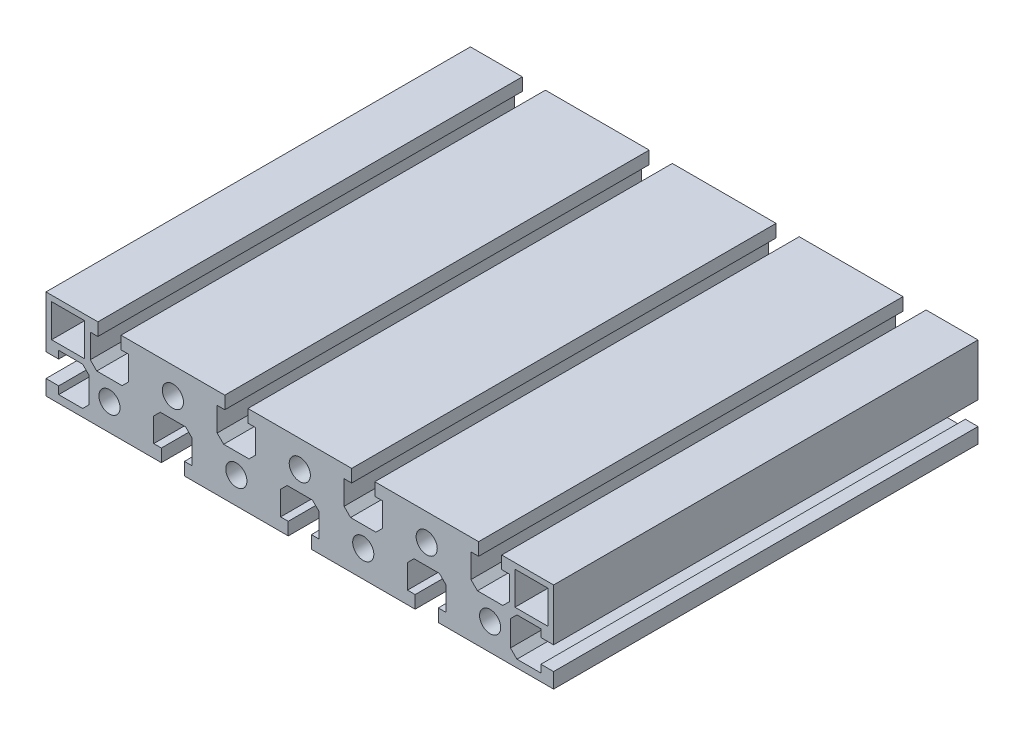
ISO-10303-21;
HEADER;
FILE_DESCRIPTION(('STEP AP214'),'2;1');
FILE_NAME('part.step','',(''),(''),'','','');
FILE_SCHEMA(('AUTOMOTIVE_DESIGN { 1 0 10303 214 1 1 1 1 }'));
ENDSEC;
DATA;
#1=APPLICATION_CONTEXT('core data for automotive mechanical design processes');
#2=APPLICATION_PROTOCOL_DEFINITION('international standard','automotive_design',2000,#1);
#3=PRODUCT_CONTEXT('',#1,'mechanical');
#4=PRODUCT('Part','Part','',(#3));
#5=PRODUCT_RELATED_PRODUCT_CATEGORY('part','',(#4));
#6=PRODUCT_DEFINITION_FORMATION('','',#4);
#7=PRODUCT_DEFINITION_CONTEXT('part definition',#1,'design');
#8=PRODUCT_DEFINITION('design','',#6,#7);
#9=PRODUCT_DEFINITION_SHAPE('','',#8);
#10=(LENGTH_UNIT() NAMED_UNIT(*) SI_UNIT(.MILLI.,.METRE.));
#11=(NAMED_UNIT(*) PLANE_ANGLE_UNIT() SI_UNIT($,.RADIAN.));
#12=(NAMED_UNIT(*) SI_UNIT($,.STERADIAN.) SOLID_ANGLE_UNIT());
#13=UNCERTAINTY_MEASURE_WITH_UNIT(LENGTH_MEASURE(1.E-05),#10,'distance_accuracy_value','');
#14=(GEOMETRIC_REPRESENTATION_CONTEXT(3) GLOBAL_UNCERTAINTY_ASSIGNED_CONTEXT((#13)) GLOBAL_UNIT_ASSIGNED_CONTEXT((#10,
#11,#12)) REPRESENTATION_CONTEXT('',''));
#15=CARTESIAN_POINT('',(0.,0.,0.));
#16=DIRECTION('',(0.,0.,1.));
#17=DIRECTION('',(1.,0.,0.));
#18=AXIS2_PLACEMENT_3D('',#15,#16,#17);
#19=CARTESIAN_POINT('',(-74.3,9.50000000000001,-75.25));
#20=DIRECTION('',(1.,0.,0.));
#21=DIRECTION('',(0.,1.,0.));
#22=AXIS2_PLACEMENT_3D('',#19,#20,#21);
#23=PLANE('',#22);
#24=DIRECTION('',(0.,0.,1.));
#25=VECTOR('',#24,1.);
#26=CARTESIAN_POINT('',(-74.3,18.,-75.25));
#27=LINE('',#26,#25);
#28=CARTESIAN_POINT('',(-74.3,18.,-75.25));
#29=VERTEX_POINT('',#28);
#30=CARTESIAN_POINT('',(-74.3,18.,75.25));
#31=VERTEX_POINT('',#30);
#32=EDGE_CURVE('E35',#29,#31,#27,.T.);
#33=ORIENTED_EDGE('',*,*,#32,.T.);
#34=DIRECTION('',(0.,1.,0.));
#35=VECTOR('',#34,1.);
#36=CARTESIAN_POINT('',(-74.3,9.50000000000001,75.25));
#37=LINE('',#36,#35);
#38=CARTESIAN_POINT('',(-74.3,9.50000000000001,75.25));
#39=VERTEX_POINT('',#38);
#40=EDGE_CURVE('E724',#39,#31,#37,.T.);
#41=ORIENTED_EDGE('',*,*,#40,.F.);
#42=DIRECTION('',(0.,0.,1.));
#43=VECTOR('',#42,1.);
#44=CARTESIAN_POINT('',(-74.3,9.50000000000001,-75.25));
#45=LINE('',#44,#43);
#46=CARTESIAN_POINT('',(-74.3,9.50000000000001,-75.25));
#47=VERTEX_POINT('',#46);
#48=EDGE_CURVE('E11',#47,#39,#45,.T.);
#49=ORIENTED_EDGE('',*,*,#48,.F.);
#50=DIRECTION('',(0.,1.,0.));
#51=VECTOR('',#50,1.);
#52=CARTESIAN_POINT('',(-74.3,9.50000000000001,-75.25));
#53=LINE('',#52,#51);
#54=EDGE_CURVE('E1055',#47,#29,#53,.T.);
#55=ORIENTED_EDGE('',*,*,#54,.T.);
#56=EDGE_LOOP('',(#33,#41,#49,#55));
#57=FACE_BOUND('',#56,.T.);
#58=ADVANCED_FACE('F32',(#57),#23,.T.);
#59=CARTESIAN_POINT('',(-72.,7.2,-75.25));
#60=DIRECTION('',(0.707106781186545,0.70710678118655,0.));
#61=DIRECTION('',(-0.70710678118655,0.707106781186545,0.));
#62=AXIS2_PLACEMENT_3D('',#59,#60,#61);
#63=PLANE('',#62);
#64=ORIENTED_EDGE('',*,*,#48,.T.);
#65=DIRECTION('',(-0.70710678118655,0.707106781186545,0.));
#66=VECTOR('',#65,1.);
#67=CARTESIAN_POINT('',(-72.,7.2,75.25));
#68=LINE('',#67,#66);
#69=CARTESIAN_POINT('',(-72.,7.2,75.25));
#70=VERTEX_POINT('',#69);
#71=EDGE_CURVE('E1003',#70,#39,#68,.T.);
#72=ORIENTED_EDGE('',*,*,#71,.F.);
#73=DIRECTION('',(0.,0.,1.));
#74=VECTOR('',#73,1.);
#75=CARTESIAN_POINT('',(-72.,7.2,-75.25));
#76=LINE('',#75,#74);
#77=CARTESIAN_POINT('',(-72.,7.2,-75.25));
#78=VERTEX_POINT('',#77);
#79=EDGE_CURVE('E40',#78,#70,#76,.T.);
#80=ORIENTED_EDGE('',*,*,#79,.F.);
#81=DIRECTION('',(-0.70710678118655,0.707106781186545,0.));
#82=VECTOR('',#81,1.);
#83=CARTESIAN_POINT('',(-72.,7.2,-75.25));
#84=LINE('',#83,#82);
#85=EDGE_CURVE('E1334',#78,#47,#84,.T.);
#86=ORIENTED_EDGE('',*,*,#85,.T.);
#87=EDGE_LOOP('',(#64,#72,#80,#86));
#88=FACE_BOUND('',#87,.T.);
#89=ADVANCED_FACE('F1531',(#88),#63,.T.);
#90=CARTESIAN_POINT('',(-63.,7.2,-75.25));
#91=DIRECTION('',(0.,1.,0.));
#92=DIRECTION('',(-1.,0.,0.));
#93=AXIS2_PLACEMENT_3D('',#90,#91,#92);
#94=PLANE('',#93);
#95=ORIENTED_EDGE('',*,*,#79,.T.);
#96=DIRECTION('',(-1.,0.,0.));
#97=VECTOR('',#96,1.);
#98=CARTESIAN_POINT('',(-63.,7.2,75.25));
#99=LINE('',#98,#97);
#100=CARTESIAN_POINT('',(-63.,7.2,75.25));
#101=VERTEX_POINT('',#100);
#102=EDGE_CURVE('E1000',#101,#70,#99,.T.);
#103=ORIENTED_EDGE('',*,*,#102,.F.);
#104=DIRECTION('',(0.,0.,1.));
#105=VECTOR('',#104,1.);
#106=CARTESIAN_POINT('',(-63.,7.2,-75.25));
#107=LINE('',#106,#105);
#108=CARTESIAN_POINT('',(-63.,7.2,-75.25));
#109=VERTEX_POINT('',#108);
#110=EDGE_CURVE('E1338',#109,#101,#107,.T.);
#111=ORIENTED_EDGE('',*,*,#110,.F.);
#112=DIRECTION('',(-1.,0.,0.));
#113=VECTOR('',#112,1.);
#114=CARTESIAN_POINT('',(-63.,7.2,-75.25));
#115=LINE('',#114,#113);
#116=EDGE_CURVE('E1331',#109,#78,#115,.T.);
#117=ORIENTED_EDGE('',*,*,#116,.T.);
#118=EDGE_LOOP('',(#95,#103,#111,#117));
#119=FACE_BOUND('',#118,.T.);
#120=ADVANCED_FACE('F1896',(#119),#94,.T.);
#121=CARTESIAN_POINT('',(-60.7,9.50000000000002,-75.25));
#122=DIRECTION('',(-0.707106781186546,0.707106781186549,0.));
#123=DIRECTION('',(-0.707106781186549,-0.707106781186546,0.));
#124=AXIS2_PLACEMENT_3D('',#121,#122,#123);
#125=PLANE('',#124);
#126=ORIENTED_EDGE('',*,*,#110,.T.);
#127=DIRECTION('',(-0.707106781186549,-0.707106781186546,0.));
#128=VECTOR('',#127,1.);
#129=CARTESIAN_POINT('',(-60.7,9.50000000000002,75.25));
#130=LINE('',#129,#128);
#131=CARTESIAN_POINT('',(-60.7,9.50000000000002,75.25));
#132=VERTEX_POINT('',#131);
#133=EDGE_CURVE('E997',#132,#101,#130,.T.);
#134=ORIENTED_EDGE('',*,*,#133,.F.);
#135=DIRECTION('',(0.,0.,1.));
#136=VECTOR('',#135,1.);
#137=CARTESIAN_POINT('',(-60.7,9.50000000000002,-75.25));
#138=LINE('',#137,#136);
#139=CARTESIAN_POINT('',(-60.7,9.50000000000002,-75.25));
#140=VERTEX_POINT('',#139);
#141=EDGE_CURVE('E1340',#140,#132,#138,.T.);
#142=ORIENTED_EDGE('',*,*,#141,.F.);
#143=DIRECTION('',(-0.707106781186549,-0.707106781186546,0.));
#144=VECTOR('',#143,1.);
#145=CARTESIAN_POINT('',(-60.7,9.50000000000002,-75.25));
#146=LINE('',#145,#144);
#147=EDGE_CURVE('E1328',#140,#109,#146,.T.);
#148=ORIENTED_EDGE('',*,*,#147,.T.);
#149=EDGE_LOOP('',(#126,#134,#142,#148));
#150=FACE_BOUND('',#149,.T.);
#151=ADVANCED_FACE('F1894',(#150),#125,.T.);
#152=CARTESIAN_POINT('',(-60.7,18.,-75.25));
#153=DIRECTION('',(-1.,0.,0.));
#154=DIRECTION('',(0.,0.,1.));
#155=AXIS2_PLACEMENT_3D('',#152,#153,#154);
#156=PLANE('',#155);
#157=ORIENTED_EDGE('',*,*,#141,.T.);
#158=DIRECTION('',(0.,-1.,0.));
#159=VECTOR('',#158,1.);
#160=CARTESIAN_POINT('',(-60.7,18.,75.25));
#161=LINE('',#160,#159);
#162=CARTESIAN_POINT('',(-60.7,18.,75.25));
#163=VERTEX_POINT('',#162);
#164=EDGE_CURVE('E994',#163,#132,#161,.T.);
#165=ORIENTED_EDGE('',*,*,#164,.F.);
#166=DIRECTION('',(0.,0.,1.));
#167=VECTOR('',#166,1.);
#168=CARTESIAN_POINT('',(-60.7,18.,-75.25));
#169=LINE('',#168,#167);
#170=CARTESIAN_POINT('',(-60.7,18.,-75.25));
#171=VERTEX_POINT('',#170);
#172=EDGE_CURVE('E1342',#171,#163,#169,.T.);
#173=ORIENTED_EDGE('',*,*,#172,.F.);
#174=DIRECTION('',(0.,-1.,0.));
#175=VECTOR('',#174,1.);
#176=CARTESIAN_POINT('',(-60.7,18.,-75.25));
#177=LINE('',#176,#175);
#178=EDGE_CURVE('E1325',#171,#140,#177,.T.);
#179=ORIENTED_EDGE('',*,*,#178,.T.);
#180=EDGE_LOOP('',(#157,#165,#173,#179));
#181=FACE_BOUND('',#180,.T.);
#182=ADVANCED_FACE('F1892',(#181),#156,.T.);
#183=CARTESIAN_POINT('',(-63.4000000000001,18.,-75.25));
#184=DIRECTION('',(0.,-1.,0.));
#185=DIRECTION('',(0.,0.,-1.));
#186=AXIS2_PLACEMENT_3D('',#183,#184,#185);
#187=PLANE('',#186);
#188=ORIENTED_EDGE('',*,*,#172,.T.);
#189=DIRECTION('',(1.,0.,0.));
#190=VECTOR('',#189,1.);
#191=CARTESIAN_POINT('',(-63.4000000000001,18.,75.25));
#192=LINE('',#191,#190);
#193=CARTESIAN_POINT('',(-63.4000000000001,18.,75.25));
#194=VERTEX_POINT('',#193);
#195=EDGE_CURVE('E991',#194,#163,#192,.T.);
#196=ORIENTED_EDGE('',*,*,#195,.F.);
#197=DIRECTION('',(0.,0.,1.));
#198=VECTOR('',#197,1.);
#199=CARTESIAN_POINT('',(-63.4000000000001,18.,-75.25));
#200=LINE('',#199,#198);
#201=CARTESIAN_POINT('',(-63.4000000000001,18.,-75.25));
#202=VERTEX_POINT('',#201);
#203=EDGE_CURVE('E1344',#202,#194,#200,.T.);
#204=ORIENTED_EDGE('',*,*,#203,.F.);
#205=DIRECTION('',(1.,0.,0.));
#206=VECTOR('',#205,1.);
#207=CARTESIAN_POINT('',(-63.4000000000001,18.,-75.25));
#208=LINE('',#207,#206);
#209=EDGE_CURVE('E1322',#202,#171,#208,.T.);
#210=ORIENTED_EDGE('',*,*,#209,.T.);
#211=EDGE_LOOP('',(#188,#196,#204,#210));
#212=FACE_BOUND('',#211,.T.);
#213=ADVANCED_FACE('F1887',(#212),#187,.T.);
#214=CARTESIAN_POINT('',(-63.4000000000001,22.5,-75.25));
#215=DIRECTION('',(-1.,0.,0.));
#216=DIRECTION('',(0.,0.,1.));
#217=AXIS2_PLACEMENT_3D('',#214,#215,#216);
#218=PLANE('',#217);
#219=ORIENTED_EDGE('',*,*,#203,.T.);
#220=DIRECTION('',(0.,-1.,0.));
#221=VECTOR('',#220,1.);
#222=CARTESIAN_POINT('',(-63.4000000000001,22.5,75.25));
#223=LINE('',#222,#221);
#224=CARTESIAN_POINT('',(-63.4000000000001,22.5,75.25));
#225=VERTEX_POINT('',#224);
#226=EDGE_CURVE('E988',#225,#194,#223,.T.);
#227=ORIENTED_EDGE('',*,*,#226,.F.);
#228=DIRECTION('',(0.,0.,1.));
#229=VECTOR('',#228,1.);
#230=CARTESIAN_POINT('',(-63.4000000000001,22.5,-75.25));
#231=LINE('',#230,#229);
#232=CARTESIAN_POINT('',(-63.4000000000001,22.5,-75.25));
#233=VERTEX_POINT('',#232);
#234=EDGE_CURVE('E1346',#233,#225,#231,.T.);
#235=ORIENTED_EDGE('',*,*,#234,.F.);
#236=DIRECTION('',(0.,-1.,0.));
#237=VECTOR('',#236,1.);
#238=CARTESIAN_POINT('',(-63.4000000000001,22.5,-75.25));
#239=LINE('',#238,#237);
#240=EDGE_CURVE('E1319',#233,#202,#239,.T.);
#241=ORIENTED_EDGE('',*,*,#240,.T.);
#242=EDGE_LOOP('',(#219,#227,#235,#241));
#243=FACE_BOUND('',#242,.T.);
#244=ADVANCED_FACE('F1882',(#243),#218,.T.);
#245=CARTESIAN_POINT('',(-26.6,22.5,-75.25));
#246=DIRECTION('',(0.,1.,0.));
#247=DIRECTION('',(0.,0.,1.));
#248=AXIS2_PLACEMENT_3D('',#245,#246,#247);
#249=PLANE('',#248);
#250=ORIENTED_EDGE('',*,*,#234,.T.);
#251=DIRECTION('',(-1.,0.,0.));
#252=VECTOR('',#251,1.);
#253=CARTESIAN_POINT('',(-26.6,22.5,75.25));
#254=LINE('',#253,#252);
#255=CARTESIAN_POINT('',(-26.6,22.5,75.25));
#256=VERTEX_POINT('',#255);
#257=EDGE_CURVE('E985',#256,#225,#254,.T.);
#258=ORIENTED_EDGE('',*,*,#257,.F.);
#259=DIRECTION('',(0.,0.,1.));
#260=VECTOR('',#259,1.);
#261=CARTESIAN_POINT('',(-26.6,22.5,-75.25));
#262=LINE('',#261,#260);
#263=CARTESIAN_POINT('',(-26.6,22.5,-75.25));
#264=VERTEX_POINT('',#263);
#265=EDGE_CURVE('E1348',#264,#256,#262,.T.);
#266=ORIENTED_EDGE('',*,*,#265,.F.);
#267=DIRECTION('',(-1.,0.,0.));
#268=VECTOR('',#267,1.);
#269=CARTESIAN_POINT('',(-26.6,22.5,-75.25));
#270=LINE('',#269,#268);
#271=EDGE_CURVE('E1316',#264,#233,#270,.T.);
#272=ORIENTED_EDGE('',*,*,#271,.T.);
#273=EDGE_LOOP('',(#250,#258,#266,#272));
#274=FACE_BOUND('',#273,.T.);
#275=ADVANCED_FACE('F1880',(#274),#249,.T.);
#276=CARTESIAN_POINT('',(-26.6,18.,-75.25));
#277=DIRECTION('',(1.,0.,0.));
#278=DIRECTION('',(0.,1.,0.));
#279=AXIS2_PLACEMENT_3D('',#276,#277,#278);
#280=PLANE('',#279);
#281=ORIENTED_EDGE('',*,*,#265,.T.);
#282=DIRECTION('',(0.,1.,0.));
#283=VECTOR('',#282,1.);
#284=CARTESIAN_POINT('',(-26.6,18.,75.25));
#285=LINE('',#284,#283);
#286=CARTESIAN_POINT('',(-26.6,18.,75.25));
#287=VERTEX_POINT('',#286);
#288=EDGE_CURVE('E982',#287,#256,#285,.T.);
#289=ORIENTED_EDGE('',*,*,#288,.F.);
#290=DIRECTION('',(0.,0.,1.));
#291=VECTOR('',#290,1.);
#292=CARTESIAN_POINT('',(-26.6,18.,-75.25));
#293=LINE('',#292,#291);
#294=CARTESIAN_POINT('',(-26.6,18.,-75.25));
#295=VERTEX_POINT('',#294);
#296=EDGE_CURVE('E1350',#295,#287,#293,.T.);
#297=ORIENTED_EDGE('',*,*,#296,.F.);
#298=DIRECTION('',(0.,1.,0.));
#299=VECTOR('',#298,1.);
#300=CARTESIAN_POINT('',(-26.6,18.,-75.25));
#301=LINE('',#300,#299);
#302=EDGE_CURVE('E1313',#295,#264,#301,.T.);
#303=ORIENTED_EDGE('',*,*,#302,.T.);
#304=EDGE_LOOP('',(#281,#289,#297,#303));
#305=FACE_BOUND('',#304,.T.);
#306=ADVANCED_FACE('F1875',(#305),#280,.T.);
#307=CARTESIAN_POINT('',(-29.3,18.,-75.25));
#308=DIRECTION('',(0.,-1.,0.));
#309=DIRECTION('',(0.,0.,-1.));
#310=AXIS2_PLACEMENT_3D('',#307,#308,#309);
#311=PLANE('',#310);
#312=ORIENTED_EDGE('',*,*,#296,.T.);
#313=DIRECTION('',(1.,0.,0.));
#314=VECTOR('',#313,1.);
#315=CARTESIAN_POINT('',(-29.3,18.,75.25));
#316=LINE('',#315,#314);
#317=CARTESIAN_POINT('',(-29.3,18.,75.25));
#318=VERTEX_POINT('',#317);
#319=EDGE_CURVE('E979',#318,#287,#316,.T.);
#320=ORIENTED_EDGE('',*,*,#319,.F.);
#321=DIRECTION('',(0.,0.,1.));
#322=VECTOR('',#321,1.);
#323=CARTESIAN_POINT('',(-29.3,18.,-75.25));
#324=LINE('',#323,#322);
#325=CARTESIAN_POINT('',(-29.3,18.,-75.25));
#326=VERTEX_POINT('',#325);
#327=EDGE_CURVE('E1352',#326,#318,#324,.T.);
#328=ORIENTED_EDGE('',*,*,#327,.F.);
#329=DIRECTION('',(1.,0.,0.));
#330=VECTOR('',#329,1.);
#331=CARTESIAN_POINT('',(-29.3,18.,-75.25));
#332=LINE('',#331,#330);
#333=EDGE_CURVE('E1310',#326,#295,#332,.T.);
#334=ORIENTED_EDGE('',*,*,#333,.T.);
#335=EDGE_LOOP('',(#312,#320,#328,#334));
#336=FACE_BOUND('',#335,.T.);
#337=ADVANCED_FACE('F1870',(#336),#311,.T.);
#338=CARTESIAN_POINT('',(-29.3,9.5,-75.25));
#339=DIRECTION('',(1.,0.,0.));
#340=DIRECTION('',(0.,0.,-1.));
#341=AXIS2_PLACEMENT_3D('',#338,#339,#340);
#342=PLANE('',#341);
#343=ORIENTED_EDGE('',*,*,#327,.T.);
#344=DIRECTION('',(0.,1.,0.));
#345=VECTOR('',#344,1.);
#346=CARTESIAN_POINT('',(-29.3,9.5,75.25));
#347=LINE('',#346,#345);
#348=CARTESIAN_POINT('',(-29.3,9.5,75.25));
#349=VERTEX_POINT('',#348);
#350=EDGE_CURVE('E976',#349,#318,#347,.T.);
#351=ORIENTED_EDGE('',*,*,#350,.F.);
#352=DIRECTION('',(0.,0.,1.));
#353=VECTOR('',#352,1.);
#354=CARTESIAN_POINT('',(-29.3,9.5,-75.25));
#355=LINE('',#354,#353);
#356=CARTESIAN_POINT('',(-29.3,9.5,-75.25));
#357=VERTEX_POINT('',#356);
#358=EDGE_CURVE('E1354',#357,#349,#355,.T.);
#359=ORIENTED_EDGE('',*,*,#358,.F.);
#360=DIRECTION('',(0.,1.,0.));
#361=VECTOR('',#360,1.);
#362=CARTESIAN_POINT('',(-29.3,9.5,-75.25));
#363=LINE('',#362,#361);
#364=EDGE_CURVE('E1307',#357,#326,#363,.T.);
#365=ORIENTED_EDGE('',*,*,#364,.T.);
#366=EDGE_LOOP('',(#343,#351,#359,#365));
#367=FACE_BOUND('',#366,.T.);
#368=ADVANCED_FACE('F1868',(#367),#342,.T.);
#369=CARTESIAN_POINT('',(-27.,7.20000000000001,-75.25));
#370=DIRECTION('',(0.707106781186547,0.707106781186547,0.));
#371=DIRECTION('',(-0.707106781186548,0.707106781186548,0.));
#372=AXIS2_PLACEMENT_3D('',#369,#370,#371);
#373=PLANE('',#372);
#374=ORIENTED_EDGE('',*,*,#358,.T.);
#375=DIRECTION('',(-0.707106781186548,0.707106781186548,0.));
#376=VECTOR('',#375,1.);
#377=CARTESIAN_POINT('',(-27.,7.20000000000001,75.25));
#378=LINE('',#377,#376);
#379=CARTESIAN_POINT('',(-27.,7.20000000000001,75.25));
#380=VERTEX_POINT('',#379);
#381=EDGE_CURVE('E973',#380,#349,#378,.T.);
#382=ORIENTED_EDGE('',*,*,#381,.F.);
#383=DIRECTION('',(0.,0.,1.));
#384=VECTOR('',#383,1.);
#385=CARTESIAN_POINT('',(-27.,7.20000000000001,-75.25));
#386=LINE('',#385,#384);
#387=CARTESIAN_POINT('',(-27.,7.20000000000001,-75.25));
#388=VERTEX_POINT('',#387);
#389=EDGE_CURVE('E1356',#388,#380,#386,.T.);
#390=ORIENTED_EDGE('',*,*,#389,.F.);
#391=DIRECTION('',(-0.707106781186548,0.707106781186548,0.));
#392=VECTOR('',#391,1.);
#393=CARTESIAN_POINT('',(-27.,7.20000000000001,-75.25));
#394=LINE('',#393,#392);
#395=EDGE_CURVE('E1304',#388,#357,#394,.T.);
#396=ORIENTED_EDGE('',*,*,#395,.T.);
#397=EDGE_LOOP('',(#374,#382,#390,#396));
#398=FACE_BOUND('',#397,.T.);
#399=ADVANCED_FACE('F1863',(#398),#373,.T.);
#400=CARTESIAN_POINT('',(-18.,7.2,-75.25));
#401=DIRECTION('',(0.,1.,0.));
#402=DIRECTION('',(-1.,0.,0.));
#403=AXIS2_PLACEMENT_3D('',#400,#401,#402);
#404=PLANE('',#403);
#405=ORIENTED_EDGE('',*,*,#389,.T.);
#406=DIRECTION('',(-1.,0.,0.));
#407=VECTOR('',#406,1.);
#408=CARTESIAN_POINT('',(-18.,7.2,75.25));
#409=LINE('',#408,#407);
#410=CARTESIAN_POINT('',(-18.,7.2,75.25));
#411=VERTEX_POINT('',#410);
#412=EDGE_CURVE('E970',#411,#380,#409,.T.);
#413=ORIENTED_EDGE('',*,*,#412,.F.);
#414=DIRECTION('',(0.,0.,1.));
#415=VECTOR('',#414,1.);
#416=CARTESIAN_POINT('',(-18.,7.2,-75.25));
#417=LINE('',#416,#415);
#418=CARTESIAN_POINT('',(-18.,7.2,-75.25));
#419=VERTEX_POINT('',#418);
#420=EDGE_CURVE('E1358',#419,#411,#417,.T.);
#421=ORIENTED_EDGE('',*,*,#420,.F.);
#422=DIRECTION('',(-1.,0.,0.));
#423=VECTOR('',#422,1.);
#424=CARTESIAN_POINT('',(-18.,7.2,-75.25));
#425=LINE('',#424,#423);
#426=EDGE_CURVE('E1301',#419,#388,#425,.T.);
#427=ORIENTED_EDGE('',*,*,#426,.T.);
#428=EDGE_LOOP('',(#405,#413,#421,#427));
#429=FACE_BOUND('',#428,.T.);
#430=ADVANCED_FACE('F1858',(#429),#404,.T.);
#431=CARTESIAN_POINT('',(-15.7,9.49999999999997,-75.25));
#432=DIRECTION('',(-0.707106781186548,0.707106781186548,0.));
#433=DIRECTION('',(-0.707106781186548,-0.707106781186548,0.));
#434=AXIS2_PLACEMENT_3D('',#431,#432,#433);
#435=PLANE('',#434);
#436=ORIENTED_EDGE('',*,*,#420,.T.);
#437=DIRECTION('',(-0.707106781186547,-0.707106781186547,0.));
#438=VECTOR('',#437,1.);
#439=CARTESIAN_POINT('',(-15.7,9.49999999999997,75.25));
#440=LINE('',#439,#438);
#441=CARTESIAN_POINT('',(-15.7,9.49999999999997,75.25));
#442=VERTEX_POINT('',#441);
#443=EDGE_CURVE('E967',#442,#411,#440,.T.);
#444=ORIENTED_EDGE('',*,*,#443,.F.);
#445=DIRECTION('',(0.,0.,1.));
#446=VECTOR('',#445,1.);
#447=CARTESIAN_POINT('',(-15.7,9.49999999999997,-75.25));
#448=LINE('',#447,#446);
#449=CARTESIAN_POINT('',(-15.7,9.49999999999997,-75.25));
#450=VERTEX_POINT('',#449);
#451=EDGE_CURVE('E1360',#450,#442,#448,.T.);
#452=ORIENTED_EDGE('',*,*,#451,.F.);
#453=DIRECTION('',(-0.707106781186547,-0.707106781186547,0.));
#454=VECTOR('',#453,1.);
#455=CARTESIAN_POINT('',(-15.7,9.49999999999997,-75.25));
#456=LINE('',#455,#454);
#457=EDGE_CURVE('E1298',#450,#419,#456,.T.);
#458=ORIENTED_EDGE('',*,*,#457,.T.);
#459=EDGE_LOOP('',(#436,#444,#452,#458));
#460=FACE_BOUND('',#459,.T.);
#461=ADVANCED_FACE('F1856',(#460),#435,.T.);
#462=CARTESIAN_POINT('',(-15.7,18.,-75.25));
#463=DIRECTION('',(-1.,0.,0.));
#464=DIRECTION('',(0.,-1.,0.));
#465=AXIS2_PLACEMENT_3D('',#462,#463,#464);
#466=PLANE('',#465);
#467=ORIENTED_EDGE('',*,*,#451,.T.);
#468=DIRECTION('',(0.,-1.,0.));
#469=VECTOR('',#468,1.);
#470=CARTESIAN_POINT('',(-15.7,18.,75.25));
#471=LINE('',#470,#469);
#472=CARTESIAN_POINT('',(-15.7,18.,75.25));
#473=VERTEX_POINT('',#472);
#474=EDGE_CURVE('E964',#473,#442,#471,.T.);
#475=ORIENTED_EDGE('',*,*,#474,.F.);
#476=DIRECTION('',(0.,0.,1.));
#477=VECTOR('',#476,1.);
#478=CARTESIAN_POINT('',(-15.7,18.,-75.25));
#479=LINE('',#478,#477);
#480=CARTESIAN_POINT('',(-15.7,18.,-75.25));
#481=VERTEX_POINT('',#480);
#482=EDGE_CURVE('E1362',#481,#473,#479,.T.);
#483=ORIENTED_EDGE('',*,*,#482,.F.);
#484=DIRECTION('',(0.,-1.,0.));
#485=VECTOR('',#484,1.);
#486=CARTESIAN_POINT('',(-15.7,18.,-75.25));
#487=LINE('',#486,#485);
#488=EDGE_CURVE('E1295',#481,#450,#487,.T.);
#489=ORIENTED_EDGE('',*,*,#488,.T.);
#490=EDGE_LOOP('',(#467,#475,#483,#489));
#491=FACE_BOUND('',#490,.T.);
#492=ADVANCED_FACE('F1851',(#491),#466,.T.);
#493=CARTESIAN_POINT('',(-18.4,18.,-75.25));
#494=DIRECTION('',(0.,-1.,0.));
#495=DIRECTION('',(0.,0.,-1.));
#496=AXIS2_PLACEMENT_3D('',#493,#494,#495);
#497=PLANE('',#496);
#498=ORIENTED_EDGE('',*,*,#482,.T.);
#499=DIRECTION('',(1.,0.,0.));
#500=VECTOR('',#499,1.);
#501=CARTESIAN_POINT('',(-18.4,18.,75.25));
#502=LINE('',#501,#500);
#503=CARTESIAN_POINT('',(-18.4,18.,75.25));
#504=VERTEX_POINT('',#503);
#505=EDGE_CURVE('E961',#504,#473,#502,.T.);
#506=ORIENTED_EDGE('',*,*,#505,.F.);
#507=DIRECTION('',(0.,0.,1.));
#508=VECTOR('',#507,1.);
#509=CARTESIAN_POINT('',(-18.4,18.,-75.25));
#510=LINE('',#509,#508);
#511=CARTESIAN_POINT('',(-18.4,18.,-75.25));
#512=VERTEX_POINT('',#511);
#513=EDGE_CURVE('E1364',#512,#504,#510,.T.);
#514=ORIENTED_EDGE('',*,*,#513,.F.);
#515=DIRECTION('',(1.,0.,0.));
#516=VECTOR('',#515,1.);
#517=CARTESIAN_POINT('',(-18.4,18.,-75.25));
#518=LINE('',#517,#516);
#519=EDGE_CURVE('E1292',#512,#481,#518,.T.);
#520=ORIENTED_EDGE('',*,*,#519,.T.);
#521=EDGE_LOOP('',(#498,#506,#514,#520));
#522=FACE_BOUND('',#521,.T.);
#523=ADVANCED_FACE('F1846',(#522),#497,.T.);
#524=CARTESIAN_POINT('',(-18.4,22.5,-75.25));
#525=DIRECTION('',(-1.,0.,0.));
#526=DIRECTION('',(0.,0.,1.));
#527=AXIS2_PLACEMENT_3D('',#524,#525,#526);
#528=PLANE('',#527);
#529=ORIENTED_EDGE('',*,*,#513,.T.);
#530=DIRECTION('',(0.,-1.,0.));
#531=VECTOR('',#530,1.);
#532=CARTESIAN_POINT('',(-18.4,22.5,75.25));
#533=LINE('',#532,#531);
#534=CARTESIAN_POINT('',(-18.4,22.5,75.25));
#535=VERTEX_POINT('',#534);
#536=EDGE_CURVE('E958',#535,#504,#533,.T.);
#537=ORIENTED_EDGE('',*,*,#536,.F.);
#538=DIRECTION('',(0.,0.,1.));
#539=VECTOR('',#538,1.);
#540=CARTESIAN_POINT('',(-18.4,22.5,-75.25));
#541=LINE('',#540,#539);
#542=CARTESIAN_POINT('',(-18.4,22.5,-75.25));
#543=VERTEX_POINT('',#542);
#544=EDGE_CURVE('E1366',#543,#535,#541,.T.);
#545=ORIENTED_EDGE('',*,*,#544,.F.);
#546=DIRECTION('',(0.,-1.,0.));
#547=VECTOR('',#546,1.);
#548=CARTESIAN_POINT('',(-18.4,22.5,-75.25));
#549=LINE('',#548,#547);
#550=EDGE_CURVE('E1289',#543,#512,#549,.T.);
#551=ORIENTED_EDGE('',*,*,#550,.T.);
#552=EDGE_LOOP('',(#529,#537,#545,#551));
#553=FACE_BOUND('',#552,.T.);
#554=ADVANCED_FACE('F1844',(#553),#528,.T.);
#555=CARTESIAN_POINT('',(18.4,22.5,-75.25));
#556=DIRECTION('',(0.,1.,0.));
#557=DIRECTION('',(0.,0.,1.));
#558=AXIS2_PLACEMENT_3D('',#555,#556,#557);
#559=PLANE('',#558);
#560=ORIENTED_EDGE('',*,*,#544,.T.);
#561=DIRECTION('',(-1.,0.,0.));
#562=VECTOR('',#561,1.);
#563=CARTESIAN_POINT('',(18.4,22.5,75.25));
#564=LINE('',#563,#562);
#565=CARTESIAN_POINT('',(18.4,22.5,75.25));
#566=VERTEX_POINT('',#565);
#567=EDGE_CURVE('E955',#566,#535,#564,.T.);
#568=ORIENTED_EDGE('',*,*,#567,.F.);
#569=DIRECTION('',(0.,0.,1.));
#570=VECTOR('',#569,1.);
#571=CARTESIAN_POINT('',(18.4,22.5,-75.25));
#572=LINE('',#571,#570);
#573=CARTESIAN_POINT('',(18.4,22.5,-75.25));
#574=VERTEX_POINT('',#573);
#575=EDGE_CURVE('E1368',#574,#566,#572,.T.);
#576=ORIENTED_EDGE('',*,*,#575,.F.);
#577=DIRECTION('',(-1.,0.,0.));
#578=VECTOR('',#577,1.);
#579=CARTESIAN_POINT('',(18.4,22.5,-75.25));
#580=LINE('',#579,#578);
#581=EDGE_CURVE('E1286',#574,#543,#580,.T.);
#582=ORIENTED_EDGE('',*,*,#581,.T.);
#583=EDGE_LOOP('',(#560,#568,#576,#582));
#584=FACE_BOUND('',#583,.T.);
#585=ADVANCED_FACE('F1839',(#584),#559,.T.);
#586=CARTESIAN_POINT('',(18.4,18.,-75.25));
#587=DIRECTION('',(1.,0.,0.));
#588=DIRECTION('',(0.,0.,-1.));
#589=AXIS2_PLACEMENT_3D('',#586,#587,#588);
#590=PLANE('',#589);
#591=ORIENTED_EDGE('',*,*,#575,.T.);
#592=DIRECTION('',(0.,1.,0.));
#593=VECTOR('',#592,1.);
#594=CARTESIAN_POINT('',(18.4,18.,75.25));
#595=LINE('',#594,#593);
#596=CARTESIAN_POINT('',(18.4,18.,75.25));
#597=VERTEX_POINT('',#596);
#598=EDGE_CURVE('E952',#597,#566,#595,.T.);
#599=ORIENTED_EDGE('',*,*,#598,.F.);
#600=DIRECTION('',(0.,0.,1.));
#601=VECTOR('',#600,1.);
#602=CARTESIAN_POINT('',(18.4,18.,-75.25));
#603=LINE('',#602,#601);
#604=CARTESIAN_POINT('',(18.4,18.,-75.25));
#605=VERTEX_POINT('',#604);
#606=EDGE_CURVE('E1370',#605,#597,#603,.T.);
#607=ORIENTED_EDGE('',*,*,#606,.F.);
#608=DIRECTION('',(0.,1.,0.));
#609=VECTOR('',#608,1.);
#610=CARTESIAN_POINT('',(18.4,18.,-75.25));
#611=LINE('',#610,#609);
#612=EDGE_CURVE('E1283',#605,#574,#611,.T.);
#613=ORIENTED_EDGE('',*,*,#612,.T.);
#614=EDGE_LOOP('',(#591,#599,#607,#613));
#615=FACE_BOUND('',#614,.T.);
#616=ADVANCED_FACE('F1834',(#615),#590,.T.);
#617=CARTESIAN_POINT('',(15.6999999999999,18.,-75.25));
#618=DIRECTION('',(0.,-1.,0.));
#619=DIRECTION('',(0.,0.,-1.));
#620=AXIS2_PLACEMENT_3D('',#617,#618,#619);
#621=PLANE('',#620);
#622=ORIENTED_EDGE('',*,*,#606,.T.);
#623=DIRECTION('',(1.,0.,0.));
#624=VECTOR('',#623,1.);
#625=CARTESIAN_POINT('',(15.6999999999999,18.,75.25));
#626=LINE('',#625,#624);
#627=CARTESIAN_POINT('',(15.6999999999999,18.,75.25));
#628=VERTEX_POINT('',#627);
#629=EDGE_CURVE('E949',#628,#597,#626,.T.);
#630=ORIENTED_EDGE('',*,*,#629,.F.);
#631=DIRECTION('',(0.,0.,1.));
#632=VECTOR('',#631,1.);
#633=CARTESIAN_POINT('',(15.6999999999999,18.,-75.25));
#634=LINE('',#633,#632);
#635=CARTESIAN_POINT('',(15.6999999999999,18.,-75.25));
#636=VERTEX_POINT('',#635);
#637=EDGE_CURVE('E1372',#636,#628,#634,.T.);
#638=ORIENTED_EDGE('',*,*,#637,.F.);
#639=DIRECTION('',(1.,0.,0.));
#640=VECTOR('',#639,1.);
#641=CARTESIAN_POINT('',(15.6999999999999,18.,-75.25));
#642=LINE('',#641,#640);
#643=EDGE_CURVE('E1280',#636,#605,#642,.T.);
#644=ORIENTED_EDGE('',*,*,#643,.T.);
#645=EDGE_LOOP('',(#622,#630,#638,#644));
#646=FACE_BOUND('',#645,.T.);
#647=ADVANCED_FACE('F1832',(#646),#621,.T.);
#648=CARTESIAN_POINT('',(15.6999999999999,9.50000000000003,-75.25));
#649=DIRECTION('',(1.,0.,0.));
#650=DIRECTION('',(0.,1.,0.));
#651=AXIS2_PLACEMENT_3D('',#648,#649,#650);
#652=PLANE('',#651);
#653=ORIENTED_EDGE('',*,*,#637,.T.);
#654=DIRECTION('',(0.,1.,0.));
#655=VECTOR('',#654,1.);
#656=CARTESIAN_POINT('',(15.6999999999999,9.50000000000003,75.25));
#657=LINE('',#656,#655);
#658=CARTESIAN_POINT('',(15.6999999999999,9.50000000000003,75.25));
#659=VERTEX_POINT('',#658);
#660=EDGE_CURVE('E946',#659,#628,#657,.T.);
#661=ORIENTED_EDGE('',*,*,#660,.F.);
#662=DIRECTION('',(0.,0.,1.));
#663=VECTOR('',#662,1.);
#664=CARTESIAN_POINT('',(15.6999999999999,9.50000000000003,-75.25));
#665=LINE('',#664,#663);
#666=CARTESIAN_POINT('',(15.6999999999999,9.50000000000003,-75.25));
#667=VERTEX_POINT('',#666);
#668=EDGE_CURVE('E1374',#667,#659,#665,.T.);
#669=ORIENTED_EDGE('',*,*,#668,.F.);
#670=DIRECTION('',(0.,1.,0.));
#671=VECTOR('',#670,1.);
#672=CARTESIAN_POINT('',(15.6999999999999,9.50000000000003,-75.25));
#673=LINE('',#672,#671);
#674=EDGE_CURVE('E1277',#667,#636,#673,.T.);
#675=ORIENTED_EDGE('',*,*,#674,.T.);
#676=EDGE_LOOP('',(#653,#661,#669,#675));
#677=FACE_BOUND('',#676,.T.);
#678=ADVANCED_FACE('F1827',(#677),#652,.T.);
#679=CARTESIAN_POINT('',(18.,7.20000000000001,-75.25));
#680=DIRECTION('',(0.707106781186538,0.707106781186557,0.));
#681=DIRECTION('',(-0.707106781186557,0.707106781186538,0.));
#682=AXIS2_PLACEMENT_3D('',#679,#680,#681);
#683=PLANE('',#682);
#684=ORIENTED_EDGE('',*,*,#668,.T.);
#685=DIRECTION('',(-0.707106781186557,0.707106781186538,0.));
#686=VECTOR('',#685,1.);
#687=CARTESIAN_POINT('',(18.,7.20000000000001,75.25));
#688=LINE('',#687,#686);
#689=CARTESIAN_POINT('',(18.,7.20000000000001,75.25));
#690=VERTEX_POINT('',#689);
#691=EDGE_CURVE('E943',#690,#659,#688,.T.);
#692=ORIENTED_EDGE('',*,*,#691,.F.);
#693=DIRECTION('',(0.,0.,1.));
#694=VECTOR('',#693,1.);
#695=CARTESIAN_POINT('',(18.,7.20000000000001,-75.25));
#696=LINE('',#695,#694);
#697=CARTESIAN_POINT('',(18.,7.20000000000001,-75.25));
#698=VERTEX_POINT('',#697);
#699=EDGE_CURVE('E1376',#698,#690,#696,.T.);
#700=ORIENTED_EDGE('',*,*,#699,.F.);
#701=DIRECTION('',(-0.707106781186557,0.707106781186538,0.));
#702=VECTOR('',#701,1.);
#703=CARTESIAN_POINT('',(18.,7.20000000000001,-75.25));
#704=LINE('',#703,#702);
#705=EDGE_CURVE('E1274',#698,#667,#704,.T.);
#706=ORIENTED_EDGE('',*,*,#705,.T.);
#707=EDGE_LOOP('',(#684,#692,#700,#706));
#708=FACE_BOUND('',#707,.T.);
#709=ADVANCED_FACE('F1822',(#708),#683,.T.);
#710=CARTESIAN_POINT('',(27.,7.2,-75.25));
#711=DIRECTION('',(0.,1.,0.));
#712=DIRECTION('',(-1.,0.,0.));
#713=AXIS2_PLACEMENT_3D('',#710,#711,#712);
#714=PLANE('',#713);
#715=ORIENTED_EDGE('',*,*,#699,.T.);
#716=DIRECTION('',(-1.,0.,0.));
#717=VECTOR('',#716,1.);
#718=CARTESIAN_POINT('',(27.,7.2,75.25));
#719=LINE('',#718,#717);
#720=CARTESIAN_POINT('',(27.,7.2,75.25));
#721=VERTEX_POINT('',#720);
#722=EDGE_CURVE('E940',#721,#690,#719,.T.);
#723=ORIENTED_EDGE('',*,*,#722,.F.);
#724=DIRECTION('',(0.,0.,1.));
#725=VECTOR('',#724,1.);
#726=CARTESIAN_POINT('',(27.,7.2,-75.25));
#727=LINE('',#726,#725);
#728=CARTESIAN_POINT('',(27.,7.2,-75.25));
#729=VERTEX_POINT('',#728);
#730=EDGE_CURVE('E1378',#729,#721,#727,.T.);
#731=ORIENTED_EDGE('',*,*,#730,.F.);
#732=DIRECTION('',(-1.,0.,0.));
#733=VECTOR('',#732,1.);
#734=CARTESIAN_POINT('',(27.,7.2,-75.25));
#735=LINE('',#734,#733);
#736=EDGE_CURVE('E1271',#729,#698,#735,.T.);
#737=ORIENTED_EDGE('',*,*,#736,.T.);
#738=EDGE_LOOP('',(#715,#723,#731,#737));
#739=FACE_BOUND('',#738,.T.);
#740=ADVANCED_FACE('F1820',(#739),#714,.T.);
#741=CARTESIAN_POINT('',(29.3,9.50000000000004,-75.25));
#742=DIRECTION('',(-0.707106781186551,0.707106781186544,0.));
#743=DIRECTION('',(-0.707106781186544,-0.707106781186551,0.));
#744=AXIS2_PLACEMENT_3D('',#741,#742,#743);
#745=PLANE('',#744);
#746=ORIENTED_EDGE('',*,*,#730,.T.);
#747=DIRECTION('',(-0.707106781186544,-0.707106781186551,0.));
#748=VECTOR('',#747,1.);
#749=CARTESIAN_POINT('',(29.3,9.50000000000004,75.25));
#750=LINE('',#749,#748);
#751=CARTESIAN_POINT('',(29.3,9.50000000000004,75.25));
#752=VERTEX_POINT('',#751);
#753=EDGE_CURVE('E937',#752,#721,#750,.T.);
#754=ORIENTED_EDGE('',*,*,#753,.F.);
#755=DIRECTION('',(0.,0.,1.));
#756=VECTOR('',#755,1.);
#757=CARTESIAN_POINT('',(29.3,9.50000000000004,-75.25));
#758=LINE('',#757,#756);
#759=CARTESIAN_POINT('',(29.3,9.50000000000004,-75.25));
#760=VERTEX_POINT('',#759);
#761=EDGE_CURVE('E1380',#760,#752,#758,.T.);
#762=ORIENTED_EDGE('',*,*,#761,.F.);
#763=DIRECTION('',(-0.707106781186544,-0.707106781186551,0.));
#764=VECTOR('',#763,1.);
#765=CARTESIAN_POINT('',(29.3,9.50000000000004,-75.25));
#766=LINE('',#765,#764);
#767=EDGE_CURVE('E1268',#760,#729,#766,.T.);
#768=ORIENTED_EDGE('',*,*,#767,.T.);
#769=EDGE_LOOP('',(#746,#754,#762,#768));
#770=FACE_BOUND('',#769,.T.);
#771=ADVANCED_FACE('F1815',(#770),#745,.T.);
#772=CARTESIAN_POINT('',(29.3,18.,-75.25));
#773=DIRECTION('',(-1.,0.,0.));
#774=DIRECTION('',(0.,-1.,0.));
#775=AXIS2_PLACEMENT_3D('',#772,#773,#774);
#776=PLANE('',#775);
#777=ORIENTED_EDGE('',*,*,#761,.T.);
#778=DIRECTION('',(0.,-1.,0.));
#779=VECTOR('',#778,1.);
#780=CARTESIAN_POINT('',(29.3,18.,75.25));
#781=LINE('',#780,#779);
#782=CARTESIAN_POINT('',(29.3,18.,75.25));
#783=VERTEX_POINT('',#782);
#784=EDGE_CURVE('E934',#783,#752,#781,.T.);
#785=ORIENTED_EDGE('',*,*,#784,.F.);
#786=DIRECTION('',(0.,0.,1.));
#787=VECTOR('',#786,1.);
#788=CARTESIAN_POINT('',(29.3,18.,-75.25));
#789=LINE('',#788,#787);
#790=CARTESIAN_POINT('',(29.3,18.,-75.25));
#791=VERTEX_POINT('',#790);
#792=EDGE_CURVE('E1382',#791,#783,#789,.T.);
#793=ORIENTED_EDGE('',*,*,#792,.F.);
#794=DIRECTION('',(0.,-1.,0.));
#795=VECTOR('',#794,1.);
#796=CARTESIAN_POINT('',(29.3,18.,-75.25));
#797=LINE('',#796,#795);
#798=EDGE_CURVE('E1265',#791,#760,#797,.T.);
#799=ORIENTED_EDGE('',*,*,#798,.T.);
#800=EDGE_LOOP('',(#777,#785,#793,#799));
#801=FACE_BOUND('',#800,.T.);
#802=ADVANCED_FACE('F1810',(#801),#776,.T.);
#803=CARTESIAN_POINT('',(26.5999999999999,18.,-75.25));
#804=DIRECTION('',(0.,-1.,0.));
#805=DIRECTION('',(0.,0.,-1.));
#806=AXIS2_PLACEMENT_3D('',#803,#804,#805);
#807=PLANE('',#806);
#808=ORIENTED_EDGE('',*,*,#792,.T.);
#809=DIRECTION('',(1.,0.,0.));
#810=VECTOR('',#809,1.);
#811=CARTESIAN_POINT('',(26.5999999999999,18.,75.25));
#812=LINE('',#811,#810);
#813=CARTESIAN_POINT('',(26.5999999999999,18.,75.25));
#814=VERTEX_POINT('',#813);
#815=EDGE_CURVE('E931',#814,#783,#812,.T.);
#816=ORIENTED_EDGE('',*,*,#815,.F.);
#817=DIRECTION('',(0.,0.,1.));
#818=VECTOR('',#817,1.);
#819=CARTESIAN_POINT('',(26.5999999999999,18.,-75.25));
#820=LINE('',#819,#818);
#821=CARTESIAN_POINT('',(26.5999999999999,18.,-75.25));
#822=VERTEX_POINT('',#821);
#823=EDGE_CURVE('E1384',#822,#814,#820,.T.);
#824=ORIENTED_EDGE('',*,*,#823,.F.);
#825=DIRECTION('',(1.,0.,0.));
#826=VECTOR('',#825,1.);
#827=CARTESIAN_POINT('',(26.5999999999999,18.,-75.25));
#828=LINE('',#827,#826);
#829=EDGE_CURVE('E1262',#822,#791,#828,.T.);
#830=ORIENTED_EDGE('',*,*,#829,.T.);
#831=EDGE_LOOP('',(#808,#816,#824,#830));
#832=FACE_BOUND('',#831,.T.);
#833=ADVANCED_FACE('F1808',(#832),#807,.T.);
#834=CARTESIAN_POINT('',(26.5999999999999,22.5,-75.25));
#835=DIRECTION('',(-1.,0.,0.));
#836=DIRECTION('',(0.,0.,1.));
#837=AXIS2_PLACEMENT_3D('',#834,#835,#836);
#838=PLANE('',#837);
#839=ORIENTED_EDGE('',*,*,#823,.T.);
#840=DIRECTION('',(0.,-1.,0.));
#841=VECTOR('',#840,1.);
#842=CARTESIAN_POINT('',(26.5999999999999,22.5,75.25));
#843=LINE('',#842,#841);
#844=CARTESIAN_POINT('',(26.5999999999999,22.5,75.25));
#845=VERTEX_POINT('',#844);
#846=EDGE_CURVE('E928',#845,#814,#843,.T.);
#847=ORIENTED_EDGE('',*,*,#846,.F.);
#848=DIRECTION('',(0.,0.,1.));
#849=VECTOR('',#848,1.);
#850=CARTESIAN_POINT('',(26.5999999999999,22.5,-75.25));
#851=LINE('',#850,#849);
#852=CARTESIAN_POINT('',(26.5999999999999,22.5,-75.25));
#853=VERTEX_POINT('',#852);
#854=EDGE_CURVE('E1386',#853,#845,#851,.T.);
#855=ORIENTED_EDGE('',*,*,#854,.F.);
#856=DIRECTION('',(0.,-1.,0.));
#857=VECTOR('',#856,1.);
#858=CARTESIAN_POINT('',(26.5999999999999,22.5,-75.25));
#859=LINE('',#858,#857);
#860=EDGE_CURVE('E1259',#853,#822,#859,.T.);
#861=ORIENTED_EDGE('',*,*,#860,.T.);
#862=EDGE_LOOP('',(#839,#847,#855,#861));
#863=FACE_BOUND('',#862,.T.);
#864=ADVANCED_FACE('F1803',(#863),#838,.T.);
#865=CARTESIAN_POINT('',(63.4000000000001,22.5,-75.25));
#866=DIRECTION('',(0.,1.,0.));
#867=DIRECTION('',(0.,0.,1.));
#868=AXIS2_PLACEMENT_3D('',#865,#866,#867);
#869=PLANE('',#868);
#870=ORIENTED_EDGE('',*,*,#854,.T.);
#871=DIRECTION('',(-1.,0.,0.));
#872=VECTOR('',#871,1.);
#873=CARTESIAN_POINT('',(63.4000000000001,22.5,75.25));
#874=LINE('',#873,#872);
#875=CARTESIAN_POINT('',(63.4000000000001,22.5,75.25));
#876=VERTEX_POINT('',#875);
#877=EDGE_CURVE('E925',#876,#845,#874,.T.);
#878=ORIENTED_EDGE('',*,*,#877,.F.);
#879=DIRECTION('',(0.,0.,1.));
#880=VECTOR('',#879,1.);
#881=CARTESIAN_POINT('',(63.4000000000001,22.5,-75.25));
#882=LINE('',#881,#880);
#883=CARTESIAN_POINT('',(63.4000000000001,22.5,-75.25));
#884=VERTEX_POINT('',#883);
#885=EDGE_CURVE('E1388',#884,#876,#882,.T.);
#886=ORIENTED_EDGE('',*,*,#885,.F.);
#887=DIRECTION('',(-1.,0.,0.));
#888=VECTOR('',#887,1.);
#889=CARTESIAN_POINT('',(63.4000000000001,22.5,-75.25));
#890=LINE('',#889,#888);
#891=EDGE_CURVE('E1256',#884,#853,#890,.T.);
#892=ORIENTED_EDGE('',*,*,#891,.T.);
#893=EDGE_LOOP('',(#870,#878,#886,#892));
#894=FACE_BOUND('',#893,.T.);
#895=ADVANCED_FACE('F1798',(#894),#869,.T.);
#896=CARTESIAN_POINT('',(63.4000000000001,18.,-75.25));
#897=DIRECTION('',(1.,0.,0.));
#898=DIRECTION('',(0.,0.,-1.));
#899=AXIS2_PLACEMENT_3D('',#896,#897,#898);
#900=PLANE('',#899);
#901=ORIENTED_EDGE('',*,*,#885,.T.);
#902=DIRECTION('',(0.,1.,0.));
#903=VECTOR('',#902,1.);
#904=CARTESIAN_POINT('',(63.4000000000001,18.,75.25));
#905=LINE('',#904,#903);
#906=CARTESIAN_POINT('',(63.4000000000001,18.,75.25));
#907=VERTEX_POINT('',#906);
#908=EDGE_CURVE('E922',#907,#876,#905,.T.);
#909=ORIENTED_EDGE('',*,*,#908,.F.);
#910=DIRECTION('',(0.,0.,1.));
#911=VECTOR('',#910,1.);
#912=CARTESIAN_POINT('',(63.4000000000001,18.,-75.25));
#913=LINE('',#912,#911);
#914=CARTESIAN_POINT('',(63.4000000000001,18.,-75.25));
#915=VERTEX_POINT('',#914);
#916=EDGE_CURVE('E1390',#915,#907,#913,.T.);
#917=ORIENTED_EDGE('',*,*,#916,.F.);
#918=DIRECTION('',(0.,1.,0.));
#919=VECTOR('',#918,1.);
#920=CARTESIAN_POINT('',(63.4000000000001,18.,-75.25));
#921=LINE('',#920,#919);
#922=EDGE_CURVE('E1253',#915,#884,#921,.T.);
#923=ORIENTED_EDGE('',*,*,#922,.T.);
#924=EDGE_LOOP('',(#901,#909,#917,#923));
#925=FACE_BOUND('',#924,.T.);
#926=ADVANCED_FACE('F1796',(#925),#900,.T.);
#927=CARTESIAN_POINT('',(60.6999999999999,18.,-75.25));
#928=DIRECTION('',(0.,-1.,0.));
#929=DIRECTION('',(0.,0.,-1.));
#930=AXIS2_PLACEMENT_3D('',#927,#928,#929);
#931=PLANE('',#930);
#932=ORIENTED_EDGE('',*,*,#916,.T.);
#933=DIRECTION('',(1.,0.,0.));
#934=VECTOR('',#933,1.);
#935=CARTESIAN_POINT('',(60.6999999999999,18.,75.25));
#936=LINE('',#935,#934);
#937=CARTESIAN_POINT('',(60.6999999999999,18.,75.25));
#938=VERTEX_POINT('',#937);
#939=EDGE_CURVE('E919',#938,#907,#936,.T.);
#940=ORIENTED_EDGE('',*,*,#939,.F.);
#941=DIRECTION('',(0.,0.,1.));
#942=VECTOR('',#941,1.);
#943=CARTESIAN_POINT('',(60.6999999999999,18.,-75.25));
#944=LINE('',#943,#942);
#945=CARTESIAN_POINT('',(60.6999999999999,18.,-75.25));
#946=VERTEX_POINT('',#945);
#947=EDGE_CURVE('E1392',#946,#938,#944,.T.);
#948=ORIENTED_EDGE('',*,*,#947,.F.);
#949=DIRECTION('',(1.,0.,0.));
#950=VECTOR('',#949,1.);
#951=CARTESIAN_POINT('',(60.6999999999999,18.,-75.25));
#952=LINE('',#951,#950);
#953=EDGE_CURVE('E1250',#946,#915,#952,.T.);
#954=ORIENTED_EDGE('',*,*,#953,.T.);
#955=EDGE_LOOP('',(#932,#940,#948,#954));
#956=FACE_BOUND('',#955,.T.);
#957=ADVANCED_FACE('F1791',(#956),#931,.T.);
#958=CARTESIAN_POINT('',(60.6999999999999,9.50000000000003,-75.25));
#959=DIRECTION('',(1.,0.,0.));
#960=DIRECTION('',(0.,1.,0.));
#961=AXIS2_PLACEMENT_3D('',#958,#959,#960);
#962=PLANE('',#961);
#963=ORIENTED_EDGE('',*,*,#947,.T.);
#964=DIRECTION('',(0.,1.,0.));
#965=VECTOR('',#964,1.);
#966=CARTESIAN_POINT('',(60.6999999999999,9.50000000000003,75.25));
#967=LINE('',#966,#965);
#968=CARTESIAN_POINT('',(60.6999999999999,9.50000000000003,75.25));
#969=VERTEX_POINT('',#968);
#970=EDGE_CURVE('E916',#969,#938,#967,.T.);
#971=ORIENTED_EDGE('',*,*,#970,.F.);
#972=DIRECTION('',(0.,0.,1.));
#973=VECTOR('',#972,1.);
#974=CARTESIAN_POINT('',(60.6999999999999,9.50000000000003,-75.25));
#975=LINE('',#974,#973);
#976=CARTESIAN_POINT('',(60.6999999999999,9.50000000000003,-75.25));
#977=VERTEX_POINT('',#976);
#978=EDGE_CURVE('E1394',#977,#969,#975,.T.);
#979=ORIENTED_EDGE('',*,*,#978,.F.);
#980=DIRECTION('',(0.,1.,0.));
#981=VECTOR('',#980,1.);
#982=CARTESIAN_POINT('',(60.6999999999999,9.50000000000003,-75.25));
#983=LINE('',#982,#981);
#984=EDGE_CURVE('E1247',#977,#946,#983,.T.);
#985=ORIENTED_EDGE('',*,*,#984,.T.);
#986=EDGE_LOOP('',(#963,#971,#979,#985));
#987=FACE_BOUND('',#986,.T.);
#988=ADVANCED_FACE('F1786',(#987),#962,.T.);
#989=CARTESIAN_POINT('',(63.,7.2,-75.25));
#990=DIRECTION('',(0.707106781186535,0.70710678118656,0.));
#991=DIRECTION('',(-0.70710678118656,0.707106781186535,0.));
#992=AXIS2_PLACEMENT_3D('',#989,#990,#991);
#993=PLANE('',#992);
#994=ORIENTED_EDGE('',*,*,#978,.T.);
#995=DIRECTION('',(-0.70710678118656,0.707106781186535,0.));
#996=VECTOR('',#995,1.);
#997=CARTESIAN_POINT('',(63.,7.2,75.25));
#998=LINE('',#997,#996);
#999=CARTESIAN_POINT('',(63.,7.2,75.25));
#1000=VERTEX_POINT('',#999);
#1001=EDGE_CURVE('E913',#1000,#969,#998,.T.);
#1002=ORIENTED_EDGE('',*,*,#1001,.F.);
#1003=DIRECTION('',(0.,0.,1.));
#1004=VECTOR('',#1003,1.);
#1005=CARTESIAN_POINT('',(63.,7.2,-75.25));
#1006=LINE('',#1005,#1004);
#1007=CARTESIAN_POINT('',(63.,7.2,-75.25));
#1008=VERTEX_POINT('',#1007);
#1009=EDGE_CURVE('E1396',#1008,#1000,#1006,.T.);
#1010=ORIENTED_EDGE('',*,*,#1009,.F.);
#1011=DIRECTION('',(-0.70710678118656,0.707106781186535,0.));
#1012=VECTOR('',#1011,1.);
#1013=CARTESIAN_POINT('',(63.,7.2,-75.25));
#1014=LINE('',#1013,#1012);
#1015=EDGE_CURVE('E1244',#1008,#977,#1014,.T.);
#1016=ORIENTED_EDGE('',*,*,#1015,.T.);
#1017=EDGE_LOOP('',(#994,#1002,#1010,#1016));
#1018=FACE_BOUND('',#1017,.T.);
#1019=ADVANCED_FACE('F1784',(#1018),#993,.T.);
#1020=CARTESIAN_POINT('',(72.,7.2,-75.25));
#1021=DIRECTION('',(0.,1.,0.));
#1022=DIRECTION('',(-1.,0.,0.));
#1023=AXIS2_PLACEMENT_3D('',#1020,#1021,#1022);
#1024=PLANE('',#1023);
#1025=ORIENTED_EDGE('',*,*,#1009,.T.);
#1026=DIRECTION('',(-1.,0.,0.));
#1027=VECTOR('',#1026,1.);
#1028=CARTESIAN_POINT('',(72.,7.2,75.25));
#1029=LINE('',#1028,#1027);
#1030=CARTESIAN_POINT('',(72.,7.2,75.25));
#1031=VERTEX_POINT('',#1030);
#1032=EDGE_CURVE('E910',#1031,#1000,#1029,.T.);
#1033=ORIENTED_EDGE('',*,*,#1032,.F.);
#1034=DIRECTION('',(0.,0.,1.));
#1035=VECTOR('',#1034,1.);
#1036=CARTESIAN_POINT('',(72.,7.2,-75.25));
#1037=LINE('',#1036,#1035);
#1038=CARTESIAN_POINT('',(72.,7.2,-75.25));
#1039=VERTEX_POINT('',#1038);
#1040=EDGE_CURVE('E1398',#1039,#1031,#1037,.T.);
#1041=ORIENTED_EDGE('',*,*,#1040,.F.);
#1042=DIRECTION('',(-1.,0.,0.));
#1043=VECTOR('',#1042,1.);
#1044=CARTESIAN_POINT('',(72.,7.2,-75.25));
#1045=LINE('',#1044,#1043);
#1046=EDGE_CURVE('E1241',#1039,#1008,#1045,.T.);
#1047=ORIENTED_EDGE('',*,*,#1046,.T.);
#1048=EDGE_LOOP('',(#1025,#1033,#1041,#1047));
#1049=FACE_BOUND('',#1048,.T.);
#1050=ADVANCED_FACE('F1779',(#1049),#1024,.T.);
#1051=CARTESIAN_POINT('',(74.3000000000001,9.50000000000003,-75.25));
#1052=DIRECTION('',(-0.707106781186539,0.707106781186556,0.));
#1053=DIRECTION('',(-0.707106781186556,-0.707106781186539,0.));
#1054=AXIS2_PLACEMENT_3D('',#1051,#1052,#1053);
#1055=PLANE('',#1054);
#1056=ORIENTED_EDGE('',*,*,#1040,.T.);
#1057=DIRECTION('',(-0.707106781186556,-0.707106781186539,0.));
#1058=VECTOR('',#1057,1.);
#1059=CARTESIAN_POINT('',(74.3000000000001,9.50000000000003,75.25));
#1060=LINE('',#1059,#1058);
#1061=CARTESIAN_POINT('',(74.3000000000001,9.50000000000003,75.25));
#1062=VERTEX_POINT('',#1061);
#1063=EDGE_CURVE('E907',#1062,#1031,#1060,.T.);
#1064=ORIENTED_EDGE('',*,*,#1063,.F.);
#1065=DIRECTION('',(0.,0.,1.));
#1066=VECTOR('',#1065,1.);
#1067=CARTESIAN_POINT('',(74.3000000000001,9.50000000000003,-75.25));
#1068=LINE('',#1067,#1066);
#1069=CARTESIAN_POINT('',(74.3000000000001,9.50000000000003,-75.25));
#1070=VERTEX_POINT('',#1069);
#1071=EDGE_CURVE('E1400',#1070,#1062,#1068,.T.);
#1072=ORIENTED_EDGE('',*,*,#1071,.F.);
#1073=DIRECTION('',(-0.707106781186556,-0.707106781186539,0.));
#1074=VECTOR('',#1073,1.);
#1075=CARTESIAN_POINT('',(74.3000000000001,9.50000000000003,-75.25));
#1076=LINE('',#1075,#1074);
#1077=EDGE_CURVE('E1238',#1070,#1039,#1076,.T.);
#1078=ORIENTED_EDGE('',*,*,#1077,.T.);
#1079=EDGE_LOOP('',(#1056,#1064,#1072,#1078));
#1080=FACE_BOUND('',#1079,.T.);
#1081=ADVANCED_FACE('F1774',(#1080),#1055,.T.);
#1082=CARTESIAN_POINT('',(74.3000000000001,18.,-75.25));
#1083=DIRECTION('',(-1.,0.,0.));
#1084=DIRECTION('',(0.,0.,1.));
#1085=AXIS2_PLACEMENT_3D('',#1082,#1083,#1084);
#1086=PLANE('',#1085);
#1087=ORIENTED_EDGE('',*,*,#1071,.T.);
#1088=DIRECTION('',(0.,-1.,0.));
#1089=VECTOR('',#1088,1.);
#1090=CARTESIAN_POINT('',(74.3000000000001,18.,75.25));
#1091=LINE('',#1090,#1089);
#1092=CARTESIAN_POINT('',(74.3000000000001,18.,75.25));
#1093=VERTEX_POINT('',#1092);
#1094=EDGE_CURVE('E904',#1093,#1062,#1091,.T.);
#1095=ORIENTED_EDGE('',*,*,#1094,.F.);
#1096=DIRECTION('',(0.,0.,1.));
#1097=VECTOR('',#1096,1.);
#1098=CARTESIAN_POINT('',(74.3000000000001,18.,-75.25));
#1099=LINE('',#1098,#1097);
#1100=CARTESIAN_POINT('',(74.3000000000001,18.,-75.25));
#1101=VERTEX_POINT('',#1100);
#1102=EDGE_CURVE('E1402',#1101,#1093,#1099,.T.);
#1103=ORIENTED_EDGE('',*,*,#1102,.F.);
#1104=DIRECTION('',(0.,-1.,0.));
#1105=VECTOR('',#1104,1.);
#1106=CARTESIAN_POINT('',(74.3000000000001,18.,-75.25));
#1107=LINE('',#1106,#1105);
#1108=EDGE_CURVE('E1235',#1101,#1070,#1107,.T.);
#1109=ORIENTED_EDGE('',*,*,#1108,.T.);
#1110=EDGE_LOOP('',(#1087,#1095,#1103,#1109));
#1111=FACE_BOUND('',#1110,.T.);
#1112=ADVANCED_FACE('F1772',(#1111),#1086,.T.);
#1113=CARTESIAN_POINT('',(71.6000000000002,18.,-75.25));
#1114=DIRECTION('',(0.,-1.,0.));
#1115=DIRECTION('',(1.,0.,0.));
#1116=AXIS2_PLACEMENT_3D('',#1113,#1114,#1115);
#1117=PLANE('',#1116);
#1118=ORIENTED_EDGE('',*,*,#1102,.T.);
#1119=DIRECTION('',(1.,0.,0.));
#1120=VECTOR('',#1119,1.);
#1121=CARTESIAN_POINT('',(71.6000000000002,18.,75.25));
#1122=LINE('',#1121,#1120);
#1123=CARTESIAN_POINT('',(71.6000000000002,18.,75.25));
#1124=VERTEX_POINT('',#1123);
#1125=EDGE_CURVE('E901',#1124,#1093,#1122,.T.);
#1126=ORIENTED_EDGE('',*,*,#1125,.F.);
#1127=DIRECTION('',(0.,0.,1.));
#1128=VECTOR('',#1127,1.);
#1129=CARTESIAN_POINT('',(71.6000000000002,18.,-75.25));
#1130=LINE('',#1129,#1128);
#1131=CARTESIAN_POINT('',(71.6000000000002,18.,-75.25));
#1132=VERTEX_POINT('',#1131);
#1133=EDGE_CURVE('E1404',#1132,#1124,#1130,.T.);
#1134=ORIENTED_EDGE('',*,*,#1133,.F.);
#1135=DIRECTION('',(1.,0.,0.));
#1136=VECTOR('',#1135,1.);
#1137=CARTESIAN_POINT('',(71.6000000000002,18.,-75.25));
#1138=LINE('',#1137,#1136);
#1139=EDGE_CURVE('E1232',#1132,#1101,#1138,.T.);
#1140=ORIENTED_EDGE('',*,*,#1139,.T.);
#1141=EDGE_LOOP('',(#1118,#1126,#1134,#1140));
#1142=FACE_BOUND('',#1141,.T.);
#1143=ADVANCED_FACE('F1767',(#1142),#1117,.T.);
#1144=CARTESIAN_POINT('',(71.6000000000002,22.5,-75.25));
#1145=DIRECTION('',(-1.,0.,0.));
#1146=DIRECTION('',(0.,0.,1.));
#1147=AXIS2_PLACEMENT_3D('',#1144,#1145,#1146);
#1148=PLANE('',#1147);
#1149=ORIENTED_EDGE('',*,*,#1133,.T.);
#1150=DIRECTION('',(0.,-1.,0.));
#1151=VECTOR('',#1150,1.);
#1152=CARTESIAN_POINT('',(71.6000000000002,22.5,75.25));
#1153=LINE('',#1152,#1151);
#1154=CARTESIAN_POINT('',(71.6000000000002,22.5,75.25));
#1155=VERTEX_POINT('',#1154);
#1156=EDGE_CURVE('E898',#1155,#1124,#1153,.T.);
#1157=ORIENTED_EDGE('',*,*,#1156,.F.);
#1158=DIRECTION('',(0.,0.,1.));
#1159=VECTOR('',#1158,1.);
#1160=CARTESIAN_POINT('',(71.6000000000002,22.5,-75.25));
#1161=LINE('',#1160,#1159);
#1162=CARTESIAN_POINT('',(71.6000000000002,22.5,-75.25));
#1163=VERTEX_POINT('',#1162);
#1164=EDGE_CURVE('E1406',#1163,#1155,#1161,.T.);
#1165=ORIENTED_EDGE('',*,*,#1164,.F.);
#1166=DIRECTION('',(0.,-1.,0.));
#1167=VECTOR('',#1166,1.);
#1168=CARTESIAN_POINT('',(71.6000000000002,22.5,-75.25));
#1169=LINE('',#1168,#1167);
#1170=EDGE_CURVE('E1229',#1163,#1132,#1169,.T.);
#1171=ORIENTED_EDGE('',*,*,#1170,.T.);
#1172=EDGE_LOOP('',(#1149,#1157,#1165,#1171));
#1173=FACE_BOUND('',#1172,.T.);
#1174=ADVANCED_FACE('F1762',(#1173),#1148,.T.);
#1175=CARTESIAN_POINT('',(90.0000000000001,22.5,-75.25));
#1176=DIRECTION('',(0.,1.,0.));
#1177=DIRECTION('',(0.,0.,1.));
#1178=AXIS2_PLACEMENT_3D('',#1175,#1176,#1177);
#1179=PLANE('',#1178);
#1180=ORIENTED_EDGE('',*,*,#1164,.T.);
#1181=DIRECTION('',(-1.,0.,0.));
#1182=VECTOR('',#1181,1.);
#1183=CARTESIAN_POINT('',(90.0000000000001,22.5,75.25));
#1184=LINE('',#1183,#1182);
#1185=CARTESIAN_POINT('',(90.0000000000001,22.5,75.25));
#1186=VERTEX_POINT('',#1185);
#1187=EDGE_CURVE('E895',#1186,#1155,#1184,.T.);
#1188=ORIENTED_EDGE('',*,*,#1187,.F.);
#1189=DIRECTION('',(0.,0.,1.));
#1190=VECTOR('',#1189,1.);
#1191=CARTESIAN_POINT('',(90.0000000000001,22.5,-75.25));
#1192=LINE('',#1191,#1190);
#1193=CARTESIAN_POINT('',(90.0000000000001,22.5,-75.25));
#1194=VERTEX_POINT('',#1193);
#1195=EDGE_CURVE('E1408',#1194,#1186,#1192,.T.);
#1196=ORIENTED_EDGE('',*,*,#1195,.F.);
#1197=DIRECTION('',(-1.,0.,0.));
#1198=VECTOR('',#1197,1.);
#1199=CARTESIAN_POINT('',(90.0000000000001,22.5,-75.25));
#1200=LINE('',#1199,#1198);
#1201=EDGE_CURVE('E1226',#1194,#1163,#1200,.T.);
#1202=ORIENTED_EDGE('',*,*,#1201,.T.);
#1203=EDGE_LOOP('',(#1180,#1188,#1196,#1202));
#1204=FACE_BOUND('',#1203,.T.);
#1205=ADVANCED_FACE('F1760',(#1204),#1179,.T.);
#1206=CARTESIAN_POINT('',(90.0000000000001,4.09999999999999,-75.25));
#1207=DIRECTION('',(1.,0.,0.));
#1208=DIRECTION('',(0.,0.,-1.));
#1209=AXIS2_PLACEMENT_3D('',#1206,#1207,#1208);
#1210=PLANE('',#1209);
#1211=ORIENTED_EDGE('',*,*,#1195,.T.);
#1212=DIRECTION('',(0.,1.,0.));
#1213=VECTOR('',#1212,1.);
#1214=CARTESIAN_POINT('',(90.0000000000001,4.09999999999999,75.25));
#1215=LINE('',#1214,#1213);
#1216=CARTESIAN_POINT('',(90.0000000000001,4.09999999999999,75.25));
#1217=VERTEX_POINT('',#1216);
#1218=EDGE_CURVE('E892',#1217,#1186,#1215,.T.);
#1219=ORIENTED_EDGE('',*,*,#1218,.F.);
#1220=DIRECTION('',(0.,0.,1.));
#1221=VECTOR('',#1220,1.);
#1222=CARTESIAN_POINT('',(90.0000000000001,4.09999999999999,-75.25));
#1223=LINE('',#1222,#1221);
#1224=CARTESIAN_POINT('',(90.0000000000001,4.09999999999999,-75.25));
#1225=VERTEX_POINT('',#1224);
#1226=EDGE_CURVE('E1410',#1225,#1217,#1223,.T.);
#1227=ORIENTED_EDGE('',*,*,#1226,.F.);
#1228=DIRECTION('',(0.,1.,0.));
#1229=VECTOR('',#1228,1.);
#1230=CARTESIAN_POINT('',(90.0000000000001,4.09999999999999,-75.25));
#1231=LINE('',#1230,#1229);
#1232=EDGE_CURVE('E1223',#1225,#1194,#1231,.T.);
#1233=ORIENTED_EDGE('',*,*,#1232,.T.);
#1234=EDGE_LOOP('',(#1211,#1219,#1227,#1233));
#1235=FACE_BOUND('',#1234,.T.);
#1236=ADVANCED_FACE('F1755',(#1235),#1210,.T.);
#1237=CARTESIAN_POINT('',(85.5,4.1,-75.25));
#1238=DIRECTION('',(0.,-1.,0.));
#1239=DIRECTION('',(1.,0.,0.));
#1240=AXIS2_PLACEMENT_3D('',#1237,#1238,#1239);
#1241=PLANE('',#1240);
#1242=ORIENTED_EDGE('',*,*,#1226,.T.);
#1243=DIRECTION('',(1.,0.,0.));
#1244=VECTOR('',#1243,1.);
#1245=CARTESIAN_POINT('',(85.5,4.1,75.25));
#1246=LINE('',#1245,#1244);
#1247=CARTESIAN_POINT('',(85.5,4.1,75.25));
#1248=VERTEX_POINT('',#1247);
#1249=EDGE_CURVE('E889',#1248,#1217,#1246,.T.);
#1250=ORIENTED_EDGE('',*,*,#1249,.F.);
#1251=DIRECTION('',(0.,0.,1.));
#1252=VECTOR('',#1251,1.);
#1253=CARTESIAN_POINT('',(85.5,4.1,-75.25));
#1254=LINE('',#1253,#1252);
#1255=CARTESIAN_POINT('',(85.5,4.1,-75.25));
#1256=VERTEX_POINT('',#1255);
#1257=EDGE_CURVE('E1412',#1256,#1248,#1254,.T.);
#1258=ORIENTED_EDGE('',*,*,#1257,.F.);
#1259=DIRECTION('',(1.,0.,0.));
#1260=VECTOR('',#1259,1.);
#1261=CARTESIAN_POINT('',(85.5,4.1,-75.25));
#1262=LINE('',#1261,#1260);
#1263=EDGE_CURVE('E1220',#1256,#1225,#1262,.T.);
#1264=ORIENTED_EDGE('',*,*,#1263,.T.);
#1265=EDGE_LOOP('',(#1242,#1250,#1258,#1264));
#1266=FACE_BOUND('',#1265,.T.);
#1267=ADVANCED_FACE('F1750',(#1266),#1241,.T.);
#1268=CARTESIAN_POINT('',(85.5,6.79999999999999,-75.25));
#1269=DIRECTION('',(-1.,0.,0.));
#1270=DIRECTION('',(0.,0.,1.));
#1271=AXIS2_PLACEMENT_3D('',#1268,#1269,#1270);
#1272=PLANE('',#1271);
#1273=ORIENTED_EDGE('',*,*,#1257,.T.);
#1274=DIRECTION('',(0.,-1.,0.));
#1275=VECTOR('',#1274,1.);
#1276=CARTESIAN_POINT('',(85.5,6.79999999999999,75.25));
#1277=LINE('',#1276,#1275);
#1278=CARTESIAN_POINT('',(85.5,6.79999999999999,75.25));
#1279=VERTEX_POINT('',#1278);
#1280=EDGE_CURVE('E886',#1279,#1248,#1277,.T.);
#1281=ORIENTED_EDGE('',*,*,#1280,.F.);
#1282=DIRECTION('',(0.,0.,1.));
#1283=VECTOR('',#1282,1.);
#1284=CARTESIAN_POINT('',(85.5,6.79999999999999,-75.25));
#1285=LINE('',#1284,#1283);
#1286=CARTESIAN_POINT('',(85.5,6.79999999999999,-75.25));
#1287=VERTEX_POINT('',#1286);
#1288=EDGE_CURVE('E1414',#1287,#1279,#1285,.T.);
#1289=ORIENTED_EDGE('',*,*,#1288,.F.);
#1290=DIRECTION('',(0.,-1.,0.));
#1291=VECTOR('',#1290,1.);
#1292=CARTESIAN_POINT('',(85.5,6.79999999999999,-75.25));
#1293=LINE('',#1292,#1291);
#1294=EDGE_CURVE('E1217',#1287,#1256,#1293,.T.);
#1295=ORIENTED_EDGE('',*,*,#1294,.T.);
#1296=EDGE_LOOP('',(#1273,#1281,#1289,#1295));
#1297=FACE_BOUND('',#1296,.T.);
#1298=ADVANCED_FACE('F1748',(#1297),#1272,.T.);
#1299=CARTESIAN_POINT('',(77.,6.8,-75.25));
#1300=DIRECTION('',(0.,-1.,0.));
#1301=DIRECTION('',(1.,0.,0.));
#1302=AXIS2_PLACEMENT_3D('',#1299,#1300,#1301);
#1303=PLANE('',#1302);
#1304=ORIENTED_EDGE('',*,*,#1288,.T.);
#1305=DIRECTION('',(1.,0.,0.));
#1306=VECTOR('',#1305,1.);
#1307=CARTESIAN_POINT('',(77.,6.8,75.25));
#1308=LINE('',#1307,#1306);
#1309=CARTESIAN_POINT('',(77.,6.8,75.25));
#1310=VERTEX_POINT('',#1309);
#1311=EDGE_CURVE('E883',#1310,#1279,#1308,.T.);
#1312=ORIENTED_EDGE('',*,*,#1311,.F.);
#1313=DIRECTION('',(0.,0.,1.));
#1314=VECTOR('',#1313,1.);
#1315=CARTESIAN_POINT('',(77.,6.8,-75.25));
#1316=LINE('',#1315,#1314);
#1317=CARTESIAN_POINT('',(77.,6.8,-75.25));
#1318=VERTEX_POINT('',#1317);
#1319=EDGE_CURVE('E1416',#1318,#1310,#1316,.T.);
#1320=ORIENTED_EDGE('',*,*,#1319,.F.);
#1321=DIRECTION('',(1.,0.,0.));
#1322=VECTOR('',#1321,1.);
#1323=CARTESIAN_POINT('',(77.,6.8,-75.25));
#1324=LINE('',#1323,#1322);
#1325=EDGE_CURVE('E1214',#1318,#1287,#1324,.T.);
#1326=ORIENTED_EDGE('',*,*,#1325,.T.);
#1327=EDGE_LOOP('',(#1304,#1312,#1320,#1326));
#1328=FACE_BOUND('',#1327,.T.);
#1329=ADVANCED_FACE('F1743',(#1328),#1303,.T.);
#1330=CARTESIAN_POINT('',(74.7,4.5,-75.25));
#1331=DIRECTION('',(0.707106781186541,-0.707106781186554,0.));
#1332=DIRECTION('',(0.707106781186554,0.707106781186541,0.));
#1333=AXIS2_PLACEMENT_3D('',#1330,#1331,#1332);
#1334=PLANE('',#1333);
#1335=ORIENTED_EDGE('',*,*,#1319,.T.);
#1336=DIRECTION('',(0.707106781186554,0.707106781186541,0.));
#1337=VECTOR('',#1336,1.);
#1338=CARTESIAN_POINT('',(74.7,4.5,75.25));
#1339=LINE('',#1338,#1337);
#1340=CARTESIAN_POINT('',(74.7,4.5,75.25));
#1341=VERTEX_POINT('',#1340);
#1342=EDGE_CURVE('E880',#1341,#1310,#1339,.T.);
#1343=ORIENTED_EDGE('',*,*,#1342,.F.);
#1344=DIRECTION('',(0.,0.,1.));
#1345=VECTOR('',#1344,1.);
#1346=CARTESIAN_POINT('',(74.7,4.5,-75.25));
#1347=LINE('',#1346,#1345);
#1348=CARTESIAN_POINT('',(74.7,4.5,-75.25));
#1349=VERTEX_POINT('',#1348);
#1350=EDGE_CURVE('E1418',#1349,#1341,#1347,.T.);
#1351=ORIENTED_EDGE('',*,*,#1350,.F.);
#1352=DIRECTION('',(0.707106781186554,0.707106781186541,0.));
#1353=VECTOR('',#1352,1.);
#1354=CARTESIAN_POINT('',(74.7,4.5,-75.25));
#1355=LINE('',#1354,#1353);
#1356=EDGE_CURVE('E1211',#1349,#1318,#1355,.T.);
#1357=ORIENTED_EDGE('',*,*,#1356,.T.);
#1358=EDGE_LOOP('',(#1335,#1343,#1351,#1357));
#1359=FACE_BOUND('',#1358,.T.);
#1360=ADVANCED_FACE('F1738',(#1359),#1334,.T.);
#1361=CARTESIAN_POINT('',(74.7,-4.50000000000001,-75.25));
#1362=DIRECTION('',(1.,0.,0.));
#1363=DIRECTION('',(0.,0.,-1.));
#1364=AXIS2_PLACEMENT_3D('',#1361,#1362,#1363);
#1365=PLANE('',#1364);
#1366=ORIENTED_EDGE('',*,*,#1350,.T.);
#1367=DIRECTION('',(0.,1.,0.));
#1368=VECTOR('',#1367,1.);
#1369=CARTESIAN_POINT('',(74.7,-4.50000000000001,75.25));
#1370=LINE('',#1369,#1368);
#1371=CARTESIAN_POINT('',(74.7,-4.50000000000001,75.25));
#1372=VERTEX_POINT('',#1371);
#1373=EDGE_CURVE('E877',#1372,#1341,#1370,.T.);
#1374=ORIENTED_EDGE('',*,*,#1373,.F.);
#1375=DIRECTION('',(0.,0.,1.));
#1376=VECTOR('',#1375,1.);
#1377=CARTESIAN_POINT('',(74.7,-4.50000000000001,-75.25));
#1378=LINE('',#1377,#1376);
#1379=CARTESIAN_POINT('',(74.7,-4.50000000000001,-75.25));
#1380=VERTEX_POINT('',#1379);
#1381=EDGE_CURVE('E1420',#1380,#1372,#1378,.T.);
#1382=ORIENTED_EDGE('',*,*,#1381,.F.);
#1383=DIRECTION('',(0.,1.,0.));
#1384=VECTOR('',#1383,1.);
#1385=CARTESIAN_POINT('',(74.7,-4.50000000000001,-75.25));
#1386=LINE('',#1385,#1384);
#1387=EDGE_CURVE('E1208',#1380,#1349,#1386,.T.);
#1388=ORIENTED_EDGE('',*,*,#1387,.T.);
#1389=EDGE_LOOP('',(#1366,#1374,#1382,#1388));
#1390=FACE_BOUND('',#1389,.T.);
#1391=ADVANCED_FACE('F1736',(#1390),#1365,.T.);
#1392=CARTESIAN_POINT('',(77.,-6.80000000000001,-75.25));
#1393=DIRECTION('',(0.707106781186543,0.707106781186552,0.));
#1394=DIRECTION('',(-0.707106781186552,0.707106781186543,0.));
#1395=AXIS2_PLACEMENT_3D('',#1392,#1393,#1394);
#1396=PLANE('',#1395);
#1397=ORIENTED_EDGE('',*,*,#1381,.T.);
#1398=DIRECTION('',(-0.707106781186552,0.707106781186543,0.));
#1399=VECTOR('',#1398,1.);
#1400=CARTESIAN_POINT('',(77.,-6.80000000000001,75.25));
#1401=LINE('',#1400,#1399);
#1402=CARTESIAN_POINT('',(77.,-6.80000000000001,75.25));
#1403=VERTEX_POINT('',#1402);
#1404=EDGE_CURVE('E874',#1403,#1372,#1401,.T.);
#1405=ORIENTED_EDGE('',*,*,#1404,.F.);
#1406=DIRECTION('',(0.,0.,1.));
#1407=VECTOR('',#1406,1.);
#1408=CARTESIAN_POINT('',(77.,-6.80000000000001,-75.25));
#1409=LINE('',#1408,#1407);
#1410=CARTESIAN_POINT('',(77.,-6.80000000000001,-75.25));
#1411=VERTEX_POINT('',#1410);
#1412=EDGE_CURVE('E1422',#1411,#1403,#1409,.T.);
#1413=ORIENTED_EDGE('',*,*,#1412,.F.);
#1414=DIRECTION('',(-0.707106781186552,0.707106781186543,0.));
#1415=VECTOR('',#1414,1.);
#1416=CARTESIAN_POINT('',(77.,-6.80000000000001,-75.25));
#1417=LINE('',#1416,#1415);
#1418=EDGE_CURVE('E1205',#1411,#1380,#1417,.T.);
#1419=ORIENTED_EDGE('',*,*,#1418,.T.);
#1420=EDGE_LOOP('',(#1397,#1405,#1413,#1419));
#1421=FACE_BOUND('',#1420,.T.);
#1422=ADVANCED_FACE('F1731',(#1421),#1396,.T.);
#1423=CARTESIAN_POINT('',(85.5,-6.8,-75.25));
#1424=DIRECTION('',(0.,1.,0.));
#1425=DIRECTION('',(-1.,0.,0.));
#1426=AXIS2_PLACEMENT_3D('',#1423,#1424,#1425);
#1427=PLANE('',#1426);
#1428=ORIENTED_EDGE('',*,*,#1412,.T.);
#1429=DIRECTION('',(-1.,0.,0.));
#1430=VECTOR('',#1429,1.);
#1431=CARTESIAN_POINT('',(85.5,-6.8,75.25));
#1432=LINE('',#1431,#1430);
#1433=CARTESIAN_POINT('',(85.5,-6.8,75.25));
#1434=VERTEX_POINT('',#1433);
#1435=EDGE_CURVE('E871',#1434,#1403,#1432,.T.);
#1436=ORIENTED_EDGE('',*,*,#1435,.F.);
#1437=DIRECTION('',(0.,0.,1.));
#1438=VECTOR('',#1437,1.);
#1439=CARTESIAN_POINT('',(85.5,-6.8,-75.25));
#1440=LINE('',#1439,#1438);
#1441=CARTESIAN_POINT('',(85.5,-6.8,-75.25));
#1442=VERTEX_POINT('',#1441);
#1443=EDGE_CURVE('E1424',#1442,#1434,#1440,.T.);
#1444=ORIENTED_EDGE('',*,*,#1443,.F.);
#1445=DIRECTION('',(-1.,0.,0.));
#1446=VECTOR('',#1445,1.);
#1447=CARTESIAN_POINT('',(85.5,-6.8,-75.25));
#1448=LINE('',#1447,#1446);
#1449=EDGE_CURVE('E1202',#1442,#1411,#1448,.T.);
#1450=ORIENTED_EDGE('',*,*,#1449,.T.);
#1451=EDGE_LOOP('',(#1428,#1436,#1444,#1450));
#1452=FACE_BOUND('',#1451,.T.);
#1453=ADVANCED_FACE('F1726',(#1452),#1427,.T.);
#1454=CARTESIAN_POINT('',(85.5,-4.10000000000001,-75.25));
#1455=DIRECTION('',(-1.,0.,0.));
#1456=DIRECTION('',(0.,0.,1.));
#1457=AXIS2_PLACEMENT_3D('',#1454,#1455,#1456);
#1458=PLANE('',#1457);
#1459=ORIENTED_EDGE('',*,*,#1443,.T.);
#1460=DIRECTION('',(0.,-1.,0.));
#1461=VECTOR('',#1460,1.);
#1462=CARTESIAN_POINT('',(85.5,-4.10000000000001,75.25));
#1463=LINE('',#1462,#1461);
#1464=CARTESIAN_POINT('',(85.5,-4.10000000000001,75.25));
#1465=VERTEX_POINT('',#1464);
#1466=EDGE_CURVE('E868',#1465,#1434,#1463,.T.);
#1467=ORIENTED_EDGE('',*,*,#1466,.F.);
#1468=DIRECTION('',(0.,0.,1.));
#1469=VECTOR('',#1468,1.);
#1470=CARTESIAN_POINT('',(85.5,-4.10000000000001,-75.25));
#1471=LINE('',#1470,#1469);
#1472=CARTESIAN_POINT('',(85.5,-4.10000000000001,-75.25));
#1473=VERTEX_POINT('',#1472);
#1474=EDGE_CURVE('E1426',#1473,#1465,#1471,.T.);
#1475=ORIENTED_EDGE('',*,*,#1474,.F.);
#1476=DIRECTION('',(0.,-1.,0.));
#1477=VECTOR('',#1476,1.);
#1478=CARTESIAN_POINT('',(85.5,-4.10000000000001,-75.25));
#1479=LINE('',#1478,#1477);
#1480=EDGE_CURVE('E1199',#1473,#1442,#1479,.T.);
#1481=ORIENTED_EDGE('',*,*,#1480,.T.);
#1482=EDGE_LOOP('',(#1459,#1467,#1475,#1481));
#1483=FACE_BOUND('',#1482,.T.);
#1484=ADVANCED_FACE('F1724',(#1483),#1458,.T.);
#1485=CARTESIAN_POINT('',(90.,-4.10000000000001,-75.25));
#1486=DIRECTION('',(0.,1.,0.));
#1487=DIRECTION('',(0.,0.,1.));
#1488=AXIS2_PLACEMENT_3D('',#1485,#1486,#1487);
#1489=PLANE('',#1488);
#1490=ORIENTED_EDGE('',*,*,#1474,.T.);
#1491=DIRECTION('',(-1.,0.,0.));
#1492=VECTOR('',#1491,1.);
#1493=CARTESIAN_POINT('',(90.,-4.10000000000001,75.25));
#1494=LINE('',#1493,#1492);
#1495=CARTESIAN_POINT('',(90.,-4.10000000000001,75.25));
#1496=VERTEX_POINT('',#1495);
#1497=EDGE_CURVE('E865',#1496,#1465,#1494,.T.);
#1498=ORIENTED_EDGE('',*,*,#1497,.F.);
#1499=DIRECTION('',(0.,0.,1.));
#1500=VECTOR('',#1499,1.);
#1501=CARTESIAN_POINT('',(90.,-4.10000000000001,-75.25));
#1502=LINE('',#1501,#1500);
#1503=CARTESIAN_POINT('',(90.,-4.10000000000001,-75.25));
#1504=VERTEX_POINT('',#1503);
#1505=EDGE_CURVE('E1428',#1504,#1496,#1502,.T.);
#1506=ORIENTED_EDGE('',*,*,#1505,.F.);
#1507=DIRECTION('',(-1.,0.,0.));
#1508=VECTOR('',#1507,1.);
#1509=CARTESIAN_POINT('',(90.,-4.10000000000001,-75.25));
#1510=LINE('',#1509,#1508);
#1511=EDGE_CURVE('E1196',#1504,#1473,#1510,.T.);
#1512=ORIENTED_EDGE('',*,*,#1511,.T.);
#1513=EDGE_LOOP('',(#1490,#1498,#1506,#1512));
#1514=FACE_BOUND('',#1513,.T.);
#1515=ADVANCED_FACE('F1719',(#1514),#1489,.T.);
#1516=CARTESIAN_POINT('',(90.,-9.5,-75.25));
#1517=DIRECTION('',(1.,0.,0.));
#1518=DIRECTION('',(0.,0.,-1.));
#1519=AXIS2_PLACEMENT_3D('',#1516,#1517,#1518);
#1520=PLANE('',#1519);
#1521=ORIENTED_EDGE('',*,*,#1505,.T.);
#1522=DIRECTION('',(0.,1.,0.));
#1523=VECTOR('',#1522,1.);
#1524=CARTESIAN_POINT('',(90.,-9.5,75.25));
#1525=LINE('',#1524,#1523);
#1526=CARTESIAN_POINT('',(90.,-9.5,75.25));
#1527=VERTEX_POINT('',#1526);
#1528=EDGE_CURVE('E862',#1527,#1496,#1525,.T.);
#1529=ORIENTED_EDGE('',*,*,#1528,.F.);
#1530=DIRECTION('',(0.,0.,1.));
#1531=VECTOR('',#1530,1.);
#1532=CARTESIAN_POINT('',(90.,-9.5,-75.25));
#1533=LINE('',#1532,#1531);
#1534=CARTESIAN_POINT('',(90.,-9.5,-75.25));
#1535=VERTEX_POINT('',#1534);
#1536=EDGE_CURVE('E1430',#1535,#1527,#1533,.T.);
#1537=ORIENTED_EDGE('',*,*,#1536,.F.);
#1538=DIRECTION('',(0.,1.,0.));
#1539=VECTOR('',#1538,1.);
#1540=CARTESIAN_POINT('',(90.,-9.5,-75.25));
#1541=LINE('',#1540,#1539);
#1542=EDGE_CURVE('E1193',#1535,#1504,#1541,.T.);
#1543=ORIENTED_EDGE('',*,*,#1542,.T.);
#1544=EDGE_LOOP('',(#1521,#1529,#1537,#1543));
#1545=FACE_BOUND('',#1544,.T.);
#1546=ADVANCED_FACE('F1714',(#1545),#1520,.T.);
#1547=CARTESIAN_POINT('',(49.1,-9.5,-75.25));
#1548=DIRECTION('',(0.,-1.,0.));
#1549=DIRECTION('',(0.,0.,-1.));
#1550=AXIS2_PLACEMENT_3D('',#1547,#1548,#1549);
#1551=PLANE('',#1550);
#1552=ORIENTED_EDGE('',*,*,#1536,.T.);
#1553=DIRECTION('',(1.,0.,0.));
#1554=VECTOR('',#1553,1.);
#1555=CARTESIAN_POINT('',(49.1,-9.5,75.25));
#1556=LINE('',#1555,#1554);
#1557=CARTESIAN_POINT('',(49.1,-9.5,75.25));
#1558=VERTEX_POINT('',#1557);
#1559=EDGE_CURVE('E859',#1558,#1527,#1556,.T.);
#1560=ORIENTED_EDGE('',*,*,#1559,.F.);
#1561=DIRECTION('',(0.,0.,1.));
#1562=VECTOR('',#1561,1.);
#1563=CARTESIAN_POINT('',(49.1,-9.5,-75.25));
#1564=LINE('',#1563,#1562);
#1565=CARTESIAN_POINT('',(49.1,-9.5,-75.25));
#1566=VERTEX_POINT('',#1565);
#1567=EDGE_CURVE('E1432',#1566,#1558,#1564,.T.);
#1568=ORIENTED_EDGE('',*,*,#1567,.F.);
#1569=DIRECTION('',(1.,0.,0.));
#1570=VECTOR('',#1569,1.);
#1571=CARTESIAN_POINT('',(49.1,-9.5,-75.25));
#1572=LINE('',#1571,#1570);
#1573=EDGE_CURVE('E1190',#1566,#1535,#1572,.T.);
#1574=ORIENTED_EDGE('',*,*,#1573,.T.);
#1575=EDGE_LOOP('',(#1552,#1560,#1568,#1574));
#1576=FACE_BOUND('',#1575,.T.);
#1577=ADVANCED_FACE('F1712',(#1576),#1551,.T.);
#1578=CARTESIAN_POINT('',(49.1,-5.,-75.25));
#1579=DIRECTION('',(-1.,0.,0.));
#1580=DIRECTION('',(0.,0.,1.));
#1581=AXIS2_PLACEMENT_3D('',#1578,#1579,#1580);
#1582=PLANE('',#1581);
#1583=ORIENTED_EDGE('',*,*,#1567,.T.);
#1584=DIRECTION('',(0.,-1.,0.));
#1585=VECTOR('',#1584,1.);
#1586=CARTESIAN_POINT('',(49.1,-5.,75.25));
#1587=LINE('',#1586,#1585);
#1588=CARTESIAN_POINT('',(49.1,-5.,75.25));
#1589=VERTEX_POINT('',#1588);
#1590=EDGE_CURVE('E856',#1589,#1558,#1587,.T.);
#1591=ORIENTED_EDGE('',*,*,#1590,.F.);
#1592=DIRECTION('',(0.,0.,1.));
#1593=VECTOR('',#1592,1.);
#1594=CARTESIAN_POINT('',(49.1,-5.,-75.25));
#1595=LINE('',#1594,#1593);
#1596=CARTESIAN_POINT('',(49.1,-5.,-75.25));
#1597=VERTEX_POINT('',#1596);
#1598=EDGE_CURVE('E1434',#1597,#1589,#1595,.T.);
#1599=ORIENTED_EDGE('',*,*,#1598,.F.);
#1600=DIRECTION('',(0.,-1.,0.));
#1601=VECTOR('',#1600,1.);
#1602=CARTESIAN_POINT('',(49.1,-5.,-75.25));
#1603=LINE('',#1602,#1601);
#1604=EDGE_CURVE('E1187',#1597,#1566,#1603,.T.);
#1605=ORIENTED_EDGE('',*,*,#1604,.T.);
#1606=EDGE_LOOP('',(#1583,#1591,#1599,#1605));
#1607=FACE_BOUND('',#1606,.T.);
#1608=ADVANCED_FACE('F1707',(#1607),#1582,.T.);
#1609=CARTESIAN_POINT('',(51.8,-5.,-75.25));
#1610=DIRECTION('',(0.,1.,0.));
#1611=DIRECTION('',(-1.,0.,0.));
#1612=AXIS2_PLACEMENT_3D('',#1609,#1610,#1611);
#1613=PLANE('',#1612);
#1614=ORIENTED_EDGE('',*,*,#1598,.T.);
#1615=DIRECTION('',(-1.,0.,0.));
#1616=VECTOR('',#1615,1.);
#1617=CARTESIAN_POINT('',(51.8,-5.,75.25));
#1618=LINE('',#1617,#1616);
#1619=CARTESIAN_POINT('',(51.8,-5.,75.25));
#1620=VERTEX_POINT('',#1619);
#1621=EDGE_CURVE('E853',#1620,#1589,#1618,.T.);
#1622=ORIENTED_EDGE('',*,*,#1621,.F.);
#1623=DIRECTION('',(0.,0.,1.));
#1624=VECTOR('',#1623,1.);
#1625=CARTESIAN_POINT('',(51.8,-5.,-75.25));
#1626=LINE('',#1625,#1624);
#1627=CARTESIAN_POINT('',(51.8,-5.,-75.25));
#1628=VERTEX_POINT('',#1627);
#1629=EDGE_CURVE('E1436',#1628,#1620,#1626,.T.);
#1630=ORIENTED_EDGE('',*,*,#1629,.F.);
#1631=DIRECTION('',(-1.,0.,0.));
#1632=VECTOR('',#1631,1.);
#1633=CARTESIAN_POINT('',(51.8,-5.,-75.25));
#1634=LINE('',#1633,#1632);
#1635=EDGE_CURVE('E1184',#1628,#1597,#1634,.T.);
#1636=ORIENTED_EDGE('',*,*,#1635,.T.);
#1637=EDGE_LOOP('',(#1614,#1622,#1630,#1636));
#1638=FACE_BOUND('',#1637,.T.);
#1639=ADVANCED_FACE('F1702',(#1638),#1613,.T.);
#1640=CARTESIAN_POINT('',(51.8,3.5,-75.25));
#1641=DIRECTION('',(-1.,0.,0.));
#1642=DIRECTION('',(0.,0.,1.));
#1643=AXIS2_PLACEMENT_3D('',#1640,#1641,#1642);
#1644=PLANE('',#1643);
#1645=ORIENTED_EDGE('',*,*,#1629,.T.);
#1646=DIRECTION('',(0.,-1.,0.));
#1647=VECTOR('',#1646,1.);
#1648=CARTESIAN_POINT('',(51.8,3.5,75.25));
#1649=LINE('',#1648,#1647);
#1650=CARTESIAN_POINT('',(51.8,3.5,75.25));
#1651=VERTEX_POINT('',#1650);
#1652=EDGE_CURVE('E850',#1651,#1620,#1649,.T.);
#1653=ORIENTED_EDGE('',*,*,#1652,.F.);
#1654=DIRECTION('',(0.,0.,1.));
#1655=VECTOR('',#1654,1.);
#1656=CARTESIAN_POINT('',(51.8,3.5,-75.25));
#1657=LINE('',#1656,#1655);
#1658=CARTESIAN_POINT('',(51.8,3.5,-75.25));
#1659=VERTEX_POINT('',#1658);
#1660=EDGE_CURVE('E1438',#1659,#1651,#1657,.T.);
#1661=ORIENTED_EDGE('',*,*,#1660,.F.);
#1662=DIRECTION('',(0.,-1.,0.));
#1663=VECTOR('',#1662,1.);
#1664=CARTESIAN_POINT('',(51.8,3.5,-75.25));
#1665=LINE('',#1664,#1663);
#1666=EDGE_CURVE('E1181',#1659,#1628,#1665,.T.);
#1667=ORIENTED_EDGE('',*,*,#1666,.T.);
#1668=EDGE_LOOP('',(#1645,#1653,#1661,#1667));
#1669=FACE_BOUND('',#1668,.T.);
#1670=ADVANCED_FACE('F1700',(#1669),#1644,.T.);
#1671=CARTESIAN_POINT('',(49.5,5.80000000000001,-75.25));
#1672=DIRECTION('',(-0.707106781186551,-0.707106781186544,0.));
#1673=DIRECTION('',(0.707106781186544,-0.707106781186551,0.));
#1674=AXIS2_PLACEMENT_3D('',#1671,#1672,#1673);
#1675=PLANE('',#1674);
#1676=ORIENTED_EDGE('',*,*,#1660,.T.);
#1677=DIRECTION('',(0.707106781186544,-0.707106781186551,0.));
#1678=VECTOR('',#1677,1.);
#1679=CARTESIAN_POINT('',(49.5,5.80000000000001,75.25));
#1680=LINE('',#1679,#1678);
#1681=CARTESIAN_POINT('',(49.5,5.80000000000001,75.25));
#1682=VERTEX_POINT('',#1681);
#1683=EDGE_CURVE('E847',#1682,#1651,#1680,.T.);
#1684=ORIENTED_EDGE('',*,*,#1683,.F.);
#1685=DIRECTION('',(0.,0.,1.));
#1686=VECTOR('',#1685,1.);
#1687=CARTESIAN_POINT('',(49.5,5.80000000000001,-75.25));
#1688=LINE('',#1687,#1686);
#1689=CARTESIAN_POINT('',(49.5,5.80000000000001,-75.25));
#1690=VERTEX_POINT('',#1689);
#1691=EDGE_CURVE('E1440',#1690,#1682,#1688,.T.);
#1692=ORIENTED_EDGE('',*,*,#1691,.F.);
#1693=DIRECTION('',(0.707106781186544,-0.707106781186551,0.));
#1694=VECTOR('',#1693,1.);
#1695=CARTESIAN_POINT('',(49.5,5.80000000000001,-75.25));
#1696=LINE('',#1695,#1694);
#1697=EDGE_CURVE('E1178',#1690,#1659,#1696,.T.);
#1698=ORIENTED_EDGE('',*,*,#1697,.T.);
#1699=EDGE_LOOP('',(#1676,#1684,#1692,#1698));
#1700=FACE_BOUND('',#1699,.T.);
#1701=ADVANCED_FACE('F1695',(#1700),#1675,.T.);
#1702=CARTESIAN_POINT('',(40.5,5.80000000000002,-75.25));
#1703=DIRECTION('',(0.,-1.,0.));
#1704=DIRECTION('',(1.,0.,0.));
#1705=AXIS2_PLACEMENT_3D('',#1702,#1703,#1704);
#1706=PLANE('',#1705);
#1707=ORIENTED_EDGE('',*,*,#1691,.T.);
#1708=DIRECTION('',(1.,0.,0.));
#1709=VECTOR('',#1708,1.);
#1710=CARTESIAN_POINT('',(40.5,5.80000000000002,75.25));
#1711=LINE('',#1710,#1709);
#1712=CARTESIAN_POINT('',(40.5,5.80000000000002,75.25));
#1713=VERTEX_POINT('',#1712);
#1714=EDGE_CURVE('E844',#1713,#1682,#1711,.T.);
#1715=ORIENTED_EDGE('',*,*,#1714,.F.);
#1716=DIRECTION('',(0.,0.,1.));
#1717=VECTOR('',#1716,1.);
#1718=CARTESIAN_POINT('',(40.5,5.80000000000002,-75.25));
#1719=LINE('',#1718,#1717);
#1720=CARTESIAN_POINT('',(40.5,5.80000000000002,-75.25));
#1721=VERTEX_POINT('',#1720);
#1722=EDGE_CURVE('E1442',#1721,#1713,#1719,.T.);
#1723=ORIENTED_EDGE('',*,*,#1722,.F.);
#1724=DIRECTION('',(1.,0.,0.));
#1725=VECTOR('',#1724,1.);
#1726=CARTESIAN_POINT('',(40.5,5.80000000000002,-75.25));
#1727=LINE('',#1726,#1725);
#1728=EDGE_CURVE('E1175',#1721,#1690,#1727,.T.);
#1729=ORIENTED_EDGE('',*,*,#1728,.T.);
#1730=EDGE_LOOP('',(#1707,#1715,#1723,#1729));
#1731=FACE_BOUND('',#1730,.T.);
#1732=ADVANCED_FACE('F1690',(#1731),#1706,.T.);
#1733=CARTESIAN_POINT('',(38.2,3.50000000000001,-75.25));
#1734=DIRECTION('',(0.707106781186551,-0.707106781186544,0.));
#1735=DIRECTION('',(0.707106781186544,0.707106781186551,0.));
#1736=AXIS2_PLACEMENT_3D('',#1733,#1734,#1735);
#1737=PLANE('',#1736);
#1738=ORIENTED_EDGE('',*,*,#1722,.T.);
#1739=DIRECTION('',(0.707106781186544,0.707106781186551,0.));
#1740=VECTOR('',#1739,1.);
#1741=CARTESIAN_POINT('',(38.2,3.50000000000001,75.25));
#1742=LINE('',#1741,#1740);
#1743=CARTESIAN_POINT('',(38.2,3.50000000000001,75.25));
#1744=VERTEX_POINT('',#1743);
#1745=EDGE_CURVE('E841',#1744,#1713,#1742,.T.);
#1746=ORIENTED_EDGE('',*,*,#1745,.F.);
#1747=DIRECTION('',(0.,0.,1.));
#1748=VECTOR('',#1747,1.);
#1749=CARTESIAN_POINT('',(38.2,3.50000000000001,-75.25));
#1750=LINE('',#1749,#1748);
#1751=CARTESIAN_POINT('',(38.2,3.50000000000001,-75.25));
#1752=VERTEX_POINT('',#1751);
#1753=EDGE_CURVE('E1444',#1752,#1744,#1750,.T.);
#1754=ORIENTED_EDGE('',*,*,#1753,.F.);
#1755=DIRECTION('',(0.707106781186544,0.707106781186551,0.));
#1756=VECTOR('',#1755,1.);
#1757=CARTESIAN_POINT('',(38.2,3.50000000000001,-75.25));
#1758=LINE('',#1757,#1756);
#1759=EDGE_CURVE('E1172',#1752,#1721,#1758,.T.);
#1760=ORIENTED_EDGE('',*,*,#1759,.T.);
#1761=EDGE_LOOP('',(#1738,#1746,#1754,#1760));
#1762=FACE_BOUND('',#1761,.T.);
#1763=ADVANCED_FACE('F1688',(#1762),#1737,.T.);
#1764=CARTESIAN_POINT('',(38.2,-5.00000000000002,-75.25));
#1765=DIRECTION('',(1.,0.,0.));
#1766=DIRECTION('',(0.,0.,-1.));
#1767=AXIS2_PLACEMENT_3D('',#1764,#1765,#1766);
#1768=PLANE('',#1767);
#1769=ORIENTED_EDGE('',*,*,#1753,.T.);
#1770=DIRECTION('',(0.,1.,0.));
#1771=VECTOR('',#1770,1.);
#1772=CARTESIAN_POINT('',(38.2,-5.00000000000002,75.25));
#1773=LINE('',#1772,#1771);
#1774=CARTESIAN_POINT('',(38.2,-5.00000000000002,75.25));
#1775=VERTEX_POINT('',#1774);
#1776=EDGE_CURVE('E838',#1775,#1744,#1773,.T.);
#1777=ORIENTED_EDGE('',*,*,#1776,.F.);
#1778=DIRECTION('',(0.,0.,1.));
#1779=VECTOR('',#1778,1.);
#1780=CARTESIAN_POINT('',(38.2,-5.00000000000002,-75.25));
#1781=LINE('',#1780,#1779);
#1782=CARTESIAN_POINT('',(38.2,-5.00000000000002,-75.25));
#1783=VERTEX_POINT('',#1782);
#1784=EDGE_CURVE('E1446',#1783,#1775,#1781,.T.);
#1785=ORIENTED_EDGE('',*,*,#1784,.F.);
#1786=DIRECTION('',(0.,1.,0.));
#1787=VECTOR('',#1786,1.);
#1788=CARTESIAN_POINT('',(38.2,-5.00000000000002,-75.25));
#1789=LINE('',#1788,#1787);
#1790=EDGE_CURVE('E1169',#1783,#1752,#1789,.T.);
#1791=ORIENTED_EDGE('',*,*,#1790,.T.);
#1792=EDGE_LOOP('',(#1769,#1777,#1785,#1791));
#1793=FACE_BOUND('',#1792,.T.);
#1794=ADVANCED_FACE('F1683',(#1793),#1768,.T.);
#1795=CARTESIAN_POINT('',(40.9,-5.00000000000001,-75.25));
#1796=DIRECTION('',(0.,1.,0.));
#1797=DIRECTION('',(-1.,0.,0.));
#1798=AXIS2_PLACEMENT_3D('',#1795,#1796,#1797);
#1799=PLANE('',#1798);
#1800=ORIENTED_EDGE('',*,*,#1784,.T.);
#1801=DIRECTION('',(-1.,0.,0.));
#1802=VECTOR('',#1801,1.);
#1803=CARTESIAN_POINT('',(40.9,-5.00000000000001,75.25));
#1804=LINE('',#1803,#1802);
#1805=CARTESIAN_POINT('',(40.9,-5.00000000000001,75.25));
#1806=VERTEX_POINT('',#1805);
#1807=EDGE_CURVE('E835',#1806,#1775,#1804,.T.);
#1808=ORIENTED_EDGE('',*,*,#1807,.F.);
#1809=DIRECTION('',(0.,0.,1.));
#1810=VECTOR('',#1809,1.);
#1811=CARTESIAN_POINT('',(40.9,-5.00000000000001,-75.25));
#1812=LINE('',#1811,#1810);
#1813=CARTESIAN_POINT('',(40.9,-5.00000000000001,-75.25));
#1814=VERTEX_POINT('',#1813);
#1815=EDGE_CURVE('E1448',#1814,#1806,#1812,.T.);
#1816=ORIENTED_EDGE('',*,*,#1815,.F.);
#1817=DIRECTION('',(-1.,0.,0.));
#1818=VECTOR('',#1817,1.);
#1819=CARTESIAN_POINT('',(40.9,-5.00000000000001,-75.25));
#1820=LINE('',#1819,#1818);
#1821=EDGE_CURVE('E1166',#1814,#1783,#1820,.T.);
#1822=ORIENTED_EDGE('',*,*,#1821,.T.);
#1823=EDGE_LOOP('',(#1800,#1808,#1816,#1822));
#1824=FACE_BOUND('',#1823,.T.);
#1825=ADVANCED_FACE('F1678',(#1824),#1799,.T.);
#1826=CARTESIAN_POINT('',(40.9,-9.5,-75.25));
#1827=DIRECTION('',(1.,0.,0.));
#1828=DIRECTION('',(0.,0.,-1.));
#1829=AXIS2_PLACEMENT_3D('',#1826,#1827,#1828);
#1830=PLANE('',#1829);
#1831=ORIENTED_EDGE('',*,*,#1815,.T.);
#1832=DIRECTION('',(0.,1.,0.));
#1833=VECTOR('',#1832,1.);
#1834=CARTESIAN_POINT('',(40.9,-9.5,75.25));
#1835=LINE('',#1834,#1833);
#1836=CARTESIAN_POINT('',(40.9,-9.5,75.25));
#1837=VERTEX_POINT('',#1836);
#1838=EDGE_CURVE('E832',#1837,#1806,#1835,.T.);
#1839=ORIENTED_EDGE('',*,*,#1838,.F.);
#1840=DIRECTION('',(0.,0.,1.));
#1841=VECTOR('',#1840,1.);
#1842=CARTESIAN_POINT('',(40.9,-9.5,-75.25));
#1843=LINE('',#1842,#1841);
#1844=CARTESIAN_POINT('',(40.9,-9.5,-75.25));
#1845=VERTEX_POINT('',#1844);
#1846=EDGE_CURVE('E1450',#1845,#1837,#1843,.T.);
#1847=ORIENTED_EDGE('',*,*,#1846,.F.);
#1848=DIRECTION('',(0.,1.,0.));
#1849=VECTOR('',#1848,1.);
#1850=CARTESIAN_POINT('',(40.9,-9.5,-75.25));
#1851=LINE('',#1850,#1849);
#1852=EDGE_CURVE('E1163',#1845,#1814,#1851,.T.);
#1853=ORIENTED_EDGE('',*,*,#1852,.T.);
#1854=EDGE_LOOP('',(#1831,#1839,#1847,#1853));
#1855=FACE_BOUND('',#1854,.T.);
#1856=ADVANCED_FACE('F1676',(#1855),#1830,.T.);
#1857=CARTESIAN_POINT('',(4.10000000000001,-9.5,-75.25));
#1858=DIRECTION('',(0.,-1.,0.));
#1859=DIRECTION('',(0.,0.,-1.));
#1860=AXIS2_PLACEMENT_3D('',#1857,#1858,#1859);
#1861=PLANE('',#1860);
#1862=ORIENTED_EDGE('',*,*,#1846,.T.);
#1863=DIRECTION('',(1.,0.,0.));
#1864=VECTOR('',#1863,1.);
#1865=CARTESIAN_POINT('',(4.10000000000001,-9.5,75.25));
#1866=LINE('',#1865,#1864);
#1867=CARTESIAN_POINT('',(4.10000000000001,-9.5,75.25));
#1868=VERTEX_POINT('',#1867);
#1869=EDGE_CURVE('E829',#1868,#1837,#1866,.T.);
#1870=ORIENTED_EDGE('',*,*,#1869,.F.);
#1871=DIRECTION('',(0.,0.,1.));
#1872=VECTOR('',#1871,1.);
#1873=CARTESIAN_POINT('',(4.10000000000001,-9.5,-75.25));
#1874=LINE('',#1873,#1872);
#1875=CARTESIAN_POINT('',(4.10000000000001,-9.5,-75.25));
#1876=VERTEX_POINT('',#1875);
#1877=EDGE_CURVE('E1452',#1876,#1868,#1874,.T.);
#1878=ORIENTED_EDGE('',*,*,#1877,.F.);
#1879=DIRECTION('',(1.,0.,0.));
#1880=VECTOR('',#1879,1.);
#1881=CARTESIAN_POINT('',(4.10000000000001,-9.5,-75.25));
#1882=LINE('',#1881,#1880);
#1883=EDGE_CURVE('E1160',#1876,#1845,#1882,.T.);
#1884=ORIENTED_EDGE('',*,*,#1883,.T.);
#1885=EDGE_LOOP('',(#1862,#1870,#1878,#1884));
#1886=FACE_BOUND('',#1885,.T.);
#1887=ADVANCED_FACE('F1671',(#1886),#1861,.T.);
#1888=CARTESIAN_POINT('',(4.10000000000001,-5.00000000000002,-75.25));
#1889=DIRECTION('',(-1.,0.,0.));
#1890=DIRECTION('',(0.,0.,1.));
#1891=AXIS2_PLACEMENT_3D('',#1888,#1889,#1890);
#1892=PLANE('',#1891);
#1893=ORIENTED_EDGE('',*,*,#1877,.T.);
#1894=DIRECTION('',(0.,-1.,0.));
#1895=VECTOR('',#1894,1.);
#1896=CARTESIAN_POINT('',(4.10000000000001,-5.00000000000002,75.25));
#1897=LINE('',#1896,#1895);
#1898=CARTESIAN_POINT('',(4.10000000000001,-5.00000000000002,75.25));
#1899=VERTEX_POINT('',#1898);
#1900=EDGE_CURVE('E826',#1899,#1868,#1897,.T.);
#1901=ORIENTED_EDGE('',*,*,#1900,.F.);
#1902=DIRECTION('',(0.,0.,1.));
#1903=VECTOR('',#1902,1.);
#1904=CARTESIAN_POINT('',(4.10000000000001,-5.00000000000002,-75.25));
#1905=LINE('',#1904,#1903);
#1906=CARTESIAN_POINT('',(4.10000000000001,-5.00000000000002,-75.25));
#1907=VERTEX_POINT('',#1906);
#1908=EDGE_CURVE('E1454',#1907,#1899,#1905,.T.);
#1909=ORIENTED_EDGE('',*,*,#1908,.F.);
#1910=DIRECTION('',(0.,-1.,0.));
#1911=VECTOR('',#1910,1.);
#1912=CARTESIAN_POINT('',(4.10000000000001,-5.00000000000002,-75.25));
#1913=LINE('',#1912,#1911);
#1914=EDGE_CURVE('E1157',#1907,#1876,#1913,.T.);
#1915=ORIENTED_EDGE('',*,*,#1914,.T.);
#1916=EDGE_LOOP('',(#1893,#1901,#1909,#1915));
#1917=FACE_BOUND('',#1916,.T.);
#1918=ADVANCED_FACE('F1666',(#1917),#1892,.T.);
#1919=CARTESIAN_POINT('',(6.8,-5.,-75.25));
#1920=DIRECTION('',(0.,1.,0.));
#1921=DIRECTION('',(-1.,0.,0.));
#1922=AXIS2_PLACEMENT_3D('',#1919,#1920,#1921);
#1923=PLANE('',#1922);
#1924=ORIENTED_EDGE('',*,*,#1908,.T.);
#1925=DIRECTION('',(-1.,0.,0.));
#1926=VECTOR('',#1925,1.);
#1927=CARTESIAN_POINT('',(6.8,-5.,75.25));
#1928=LINE('',#1927,#1926);
#1929=CARTESIAN_POINT('',(6.8,-5.,75.25));
#1930=VERTEX_POINT('',#1929);
#1931=EDGE_CURVE('E823',#1930,#1899,#1928,.T.);
#1932=ORIENTED_EDGE('',*,*,#1931,.F.);
#1933=DIRECTION('',(0.,0.,1.));
#1934=VECTOR('',#1933,1.);
#1935=CARTESIAN_POINT('',(6.8,-5.,-75.25));
#1936=LINE('',#1935,#1934);
#1937=CARTESIAN_POINT('',(6.8,-5.,-75.25));
#1938=VERTEX_POINT('',#1937);
#1939=EDGE_CURVE('E1456',#1938,#1930,#1936,.T.);
#1940=ORIENTED_EDGE('',*,*,#1939,.F.);
#1941=DIRECTION('',(-1.,0.,0.));
#1942=VECTOR('',#1941,1.);
#1943=CARTESIAN_POINT('',(6.8,-5.,-75.25));
#1944=LINE('',#1943,#1942);
#1945=EDGE_CURVE('E1154',#1938,#1907,#1944,.T.);
#1946=ORIENTED_EDGE('',*,*,#1945,.T.);
#1947=EDGE_LOOP('',(#1924,#1932,#1940,#1946));
#1948=FACE_BOUND('',#1947,.T.);
#1949=ADVANCED_FACE('F1664',(#1948),#1923,.T.);
#1950=CARTESIAN_POINT('',(6.8,3.5,-75.25));
#1951=DIRECTION('',(-1.,0.,0.));
#1952=DIRECTION('',(0.,0.,1.));
#1953=AXIS2_PLACEMENT_3D('',#1950,#1951,#1952);
#1954=PLANE('',#1953);
#1955=ORIENTED_EDGE('',*,*,#1939,.T.);
#1956=DIRECTION('',(0.,-1.,0.));
#1957=VECTOR('',#1956,1.);
#1958=CARTESIAN_POINT('',(6.8,3.5,75.25));
#1959=LINE('',#1958,#1957);
#1960=CARTESIAN_POINT('',(6.8,3.5,75.25));
#1961=VERTEX_POINT('',#1960);
#1962=EDGE_CURVE('E820',#1961,#1930,#1959,.T.);
#1963=ORIENTED_EDGE('',*,*,#1962,.F.);
#1964=DIRECTION('',(0.,0.,1.));
#1965=VECTOR('',#1964,1.);
#1966=CARTESIAN_POINT('',(6.8,3.5,-75.25));
#1967=LINE('',#1966,#1965);
#1968=CARTESIAN_POINT('',(6.8,3.5,-75.25));
#1969=VERTEX_POINT('',#1968);
#1970=EDGE_CURVE('E1458',#1969,#1961,#1967,.T.);
#1971=ORIENTED_EDGE('',*,*,#1970,.F.);
#1972=DIRECTION('',(0.,-1.,0.));
#1973=VECTOR('',#1972,1.);
#1974=CARTESIAN_POINT('',(6.8,3.5,-75.25));
#1975=LINE('',#1974,#1973);
#1976=EDGE_CURVE('E1151',#1969,#1938,#1975,.T.);
#1977=ORIENTED_EDGE('',*,*,#1976,.T.);
#1978=EDGE_LOOP('',(#1955,#1963,#1971,#1977));
#1979=FACE_BOUND('',#1978,.T.);
#1980=ADVANCED_FACE('F1659',(#1979),#1954,.T.);
#1981=CARTESIAN_POINT('',(4.50000000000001,5.80000000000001,-75.25));
#1982=DIRECTION('',(-0.707106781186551,-0.707106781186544,0.));
#1983=DIRECTION('',(0.707106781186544,-0.707106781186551,0.));
#1984=AXIS2_PLACEMENT_3D('',#1981,#1982,#1983);
#1985=PLANE('',#1984);
#1986=ORIENTED_EDGE('',*,*,#1970,.T.);
#1987=DIRECTION('',(0.707106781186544,-0.707106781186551,0.));
#1988=VECTOR('',#1987,1.);
#1989=CARTESIAN_POINT('',(4.50000000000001,5.80000000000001,75.25));
#1990=LINE('',#1989,#1988);
#1991=CARTESIAN_POINT('',(4.50000000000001,5.80000000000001,75.25));
#1992=VERTEX_POINT('',#1991);
#1993=EDGE_CURVE('E817',#1992,#1961,#1990,.T.);
#1994=ORIENTED_EDGE('',*,*,#1993,.F.);
#1995=DIRECTION('',(0.,0.,1.));
#1996=VECTOR('',#1995,1.);
#1997=CARTESIAN_POINT('',(4.50000000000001,5.80000000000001,-75.25));
#1998=LINE('',#1997,#1996);
#1999=CARTESIAN_POINT('',(4.50000000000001,5.80000000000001,-75.25));
#2000=VERTEX_POINT('',#1999);
#2001=EDGE_CURVE('E1460',#2000,#1992,#1998,.T.);
#2002=ORIENTED_EDGE('',*,*,#2001,.F.);
#2003=DIRECTION('',(0.707106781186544,-0.707106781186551,0.));
#2004=VECTOR('',#2003,1.);
#2005=CARTESIAN_POINT('',(4.50000000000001,5.80000000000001,-75.25));
#2006=LINE('',#2005,#2004);
#2007=EDGE_CURVE('E1148',#2000,#1969,#2006,.T.);
#2008=ORIENTED_EDGE('',*,*,#2007,.T.);
#2009=EDGE_LOOP('',(#1986,#1994,#2002,#2008));
#2010=FACE_BOUND('',#2009,.T.);
#2011=ADVANCED_FACE('F1654',(#2010),#1985,.T.);
#2012=CARTESIAN_POINT('',(-4.49999999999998,5.80000000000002,-75.25));
#2013=DIRECTION('',(0.,-1.,0.));
#2014=DIRECTION('',(1.,0.,0.));
#2015=AXIS2_PLACEMENT_3D('',#2012,#2013,#2014);
#2016=PLANE('',#2015);
#2017=ORIENTED_EDGE('',*,*,#2001,.T.);
#2018=DIRECTION('',(1.,0.,0.));
#2019=VECTOR('',#2018,1.);
#2020=CARTESIAN_POINT('',(-4.49999999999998,5.80000000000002,75.25));
#2021=LINE('',#2020,#2019);
#2022=CARTESIAN_POINT('',(-4.49999999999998,5.80000000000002,75.25));
#2023=VERTEX_POINT('',#2022);
#2024=EDGE_CURVE('E814',#2023,#1992,#2021,.T.);
#2025=ORIENTED_EDGE('',*,*,#2024,.F.);
#2026=DIRECTION('',(0.,0.,1.));
#2027=VECTOR('',#2026,1.);
#2028=CARTESIAN_POINT('',(-4.49999999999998,5.80000000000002,-75.25));
#2029=LINE('',#2028,#2027);
#2030=CARTESIAN_POINT('',(-4.49999999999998,5.80000000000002,-75.25));
#2031=VERTEX_POINT('',#2030);
#2032=EDGE_CURVE('E1462',#2031,#2023,#2029,.T.);
#2033=ORIENTED_EDGE('',*,*,#2032,.F.);
#2034=DIRECTION('',(1.,0.,0.));
#2035=VECTOR('',#2034,1.);
#2036=CARTESIAN_POINT('',(-4.49999999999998,5.80000000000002,-75.25));
#2037=LINE('',#2036,#2035);
#2038=EDGE_CURVE('E1145',#2031,#2000,#2037,.T.);
#2039=ORIENTED_EDGE('',*,*,#2038,.T.);
#2040=EDGE_LOOP('',(#2017,#2025,#2033,#2039));
#2041=FACE_BOUND('',#2040,.T.);
#2042=ADVANCED_FACE('F1652',(#2041),#2016,.T.);
#2043=CARTESIAN_POINT('',(-6.8,3.5,-75.25));
#2044=DIRECTION('',(0.707106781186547,-0.707106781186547,0.));
#2045=DIRECTION('',(0.707106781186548,0.707106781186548,0.));
#2046=AXIS2_PLACEMENT_3D('',#2043,#2044,#2045);
#2047=PLANE('',#2046);
#2048=ORIENTED_EDGE('',*,*,#2032,.T.);
#2049=DIRECTION('',(0.707106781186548,0.707106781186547,0.));
#2050=VECTOR('',#2049,1.);
#2051=CARTESIAN_POINT('',(-6.8,3.5,75.25));
#2052=LINE('',#2051,#2050);
#2053=CARTESIAN_POINT('',(-6.8,3.5,75.25));
#2054=VERTEX_POINT('',#2053);
#2055=EDGE_CURVE('E811',#2054,#2023,#2052,.T.);
#2056=ORIENTED_EDGE('',*,*,#2055,.F.);
#2057=DIRECTION('',(0.,0.,1.));
#2058=VECTOR('',#2057,1.);
#2059=CARTESIAN_POINT('',(-6.8,3.5,-75.25));
#2060=LINE('',#2059,#2058);
#2061=CARTESIAN_POINT('',(-6.8,3.5,-75.25));
#2062=VERTEX_POINT('',#2061);
#2063=EDGE_CURVE('E1464',#2062,#2054,#2060,.T.);
#2064=ORIENTED_EDGE('',*,*,#2063,.F.);
#2065=DIRECTION('',(0.707106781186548,0.707106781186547,0.));
#2066=VECTOR('',#2065,1.);
#2067=CARTESIAN_POINT('',(-6.8,3.5,-75.25));
#2068=LINE('',#2067,#2066);
#2069=EDGE_CURVE('E1142',#2062,#2031,#2068,.T.);
#2070=ORIENTED_EDGE('',*,*,#2069,.T.);
#2071=EDGE_LOOP('',(#2048,#2056,#2064,#2070));
#2072=FACE_BOUND('',#2071,.T.);
#2073=ADVANCED_FACE('F1647',(#2072),#2047,.T.);
#2074=CARTESIAN_POINT('',(-6.8,-5.,-75.25));
#2075=DIRECTION('',(1.,0.,0.));
#2076=DIRECTION('',(0.,0.,-1.));
#2077=AXIS2_PLACEMENT_3D('',#2074,#2075,#2076);
#2078=PLANE('',#2077);
#2079=ORIENTED_EDGE('',*,*,#2063,.T.);
#2080=DIRECTION('',(0.,1.,0.));
#2081=VECTOR('',#2080,1.);
#2082=CARTESIAN_POINT('',(-6.8,-5.,75.25));
#2083=LINE('',#2082,#2081);
#2084=CARTESIAN_POINT('',(-6.8,-5.,75.25));
#2085=VERTEX_POINT('',#2084);
#2086=EDGE_CURVE('E808',#2085,#2054,#2083,.T.);
#2087=ORIENTED_EDGE('',*,*,#2086,.F.);
#2088=DIRECTION('',(0.,0.,1.));
#2089=VECTOR('',#2088,1.);
#2090=CARTESIAN_POINT('',(-6.8,-5.,-75.25));
#2091=LINE('',#2090,#2089);
#2092=CARTESIAN_POINT('',(-6.8,-5.,-75.25));
#2093=VERTEX_POINT('',#2092);
#2094=EDGE_CURVE('E1466',#2093,#2085,#2091,.T.);
#2095=ORIENTED_EDGE('',*,*,#2094,.F.);
#2096=DIRECTION('',(0.,1.,0.));
#2097=VECTOR('',#2096,1.);
#2098=CARTESIAN_POINT('',(-6.8,-5.,-75.25));
#2099=LINE('',#2098,#2097);
#2100=EDGE_CURVE('E1139',#2093,#2062,#2099,.T.);
#2101=ORIENTED_EDGE('',*,*,#2100,.T.);
#2102=EDGE_LOOP('',(#2079,#2087,#2095,#2101));
#2103=FACE_BOUND('',#2102,.T.);
#2104=ADVANCED_FACE('F1642',(#2103),#2078,.T.);
#2105=CARTESIAN_POINT('',(-4.1,-5.00000000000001,-75.25));
#2106=DIRECTION('',(0.,1.,0.));
#2107=DIRECTION('',(-1.,0.,0.));
#2108=AXIS2_PLACEMENT_3D('',#2105,#2106,#2107);
#2109=PLANE('',#2108);
#2110=ORIENTED_EDGE('',*,*,#2094,.T.);
#2111=DIRECTION('',(-1.,0.,0.));
#2112=VECTOR('',#2111,1.);
#2113=CARTESIAN_POINT('',(-4.1,-5.00000000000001,75.25));
#2114=LINE('',#2113,#2112);
#2115=CARTESIAN_POINT('',(-4.1,-5.00000000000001,75.25));
#2116=VERTEX_POINT('',#2115);
#2117=EDGE_CURVE('E805',#2116,#2085,#2114,.T.);
#2118=ORIENTED_EDGE('',*,*,#2117,.F.);
#2119=DIRECTION('',(0.,0.,1.));
#2120=VECTOR('',#2119,1.);
#2121=CARTESIAN_POINT('',(-4.1,-5.00000000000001,-75.25));
#2122=LINE('',#2121,#2120);
#2123=CARTESIAN_POINT('',(-4.1,-5.00000000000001,-75.25));
#2124=VERTEX_POINT('',#2123);
#2125=EDGE_CURVE('E1468',#2124,#2116,#2122,.T.);
#2126=ORIENTED_EDGE('',*,*,#2125,.F.);
#2127=DIRECTION('',(-1.,0.,0.));
#2128=VECTOR('',#2127,1.);
#2129=CARTESIAN_POINT('',(-4.1,-5.00000000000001,-75.25));
#2130=LINE('',#2129,#2128);
#2131=EDGE_CURVE('E1136',#2124,#2093,#2130,.T.);
#2132=ORIENTED_EDGE('',*,*,#2131,.T.);
#2133=EDGE_LOOP('',(#2110,#2118,#2126,#2132));
#2134=FACE_BOUND('',#2133,.T.);
#2135=ADVANCED_FACE('F1640',(#2134),#2109,.T.);
#2136=CARTESIAN_POINT('',(-4.1,-9.5,-75.25));
#2137=DIRECTION('',(1.,0.,0.));
#2138=DIRECTION('',(0.,0.,-1.));
#2139=AXIS2_PLACEMENT_3D('',#2136,#2137,#2138);
#2140=PLANE('',#2139);
#2141=ORIENTED_EDGE('',*,*,#2125,.T.);
#2142=DIRECTION('',(0.,1.,0.));
#2143=VECTOR('',#2142,1.);
#2144=CARTESIAN_POINT('',(-4.1,-9.5,75.25));
#2145=LINE('',#2144,#2143);
#2146=CARTESIAN_POINT('',(-4.1,-9.5,75.25));
#2147=VERTEX_POINT('',#2146);
#2148=EDGE_CURVE('E802',#2147,#2116,#2145,.T.);
#2149=ORIENTED_EDGE('',*,*,#2148,.F.);
#2150=DIRECTION('',(0.,0.,1.));
#2151=VECTOR('',#2150,1.);
#2152=CARTESIAN_POINT('',(-4.1,-9.5,-75.25));
#2153=LINE('',#2152,#2151);
#2154=CARTESIAN_POINT('',(-4.1,-9.5,-75.25));
#2155=VERTEX_POINT('',#2154);
#2156=EDGE_CURVE('E1470',#2155,#2147,#2153,.T.);
#2157=ORIENTED_EDGE('',*,*,#2156,.F.);
#2158=DIRECTION('',(0.,1.,0.));
#2159=VECTOR('',#2158,1.);
#2160=CARTESIAN_POINT('',(-4.1,-9.5,-75.25));
#2161=LINE('',#2160,#2159);
#2162=EDGE_CURVE('E1133',#2155,#2124,#2161,.T.);
#2163=ORIENTED_EDGE('',*,*,#2162,.T.);
#2164=EDGE_LOOP('',(#2141,#2149,#2157,#2163));
#2165=FACE_BOUND('',#2164,.T.);
#2166=ADVANCED_FACE('F1635',(#2165),#2140,.T.);
#2167=CARTESIAN_POINT('',(-40.9,-9.5,-75.25));
#2168=DIRECTION('',(0.,-1.,0.));
#2169=DIRECTION('',(0.,0.,-1.));
#2170=AXIS2_PLACEMENT_3D('',#2167,#2168,#2169);
#2171=PLANE('',#2170);
#2172=ORIENTED_EDGE('',*,*,#2156,.T.);
#2173=DIRECTION('',(1.,0.,0.));
#2174=VECTOR('',#2173,1.);
#2175=CARTESIAN_POINT('',(-40.9,-9.5,75.25));
#2176=LINE('',#2175,#2174);
#2177=CARTESIAN_POINT('',(-40.9,-9.5,75.25));
#2178=VERTEX_POINT('',#2177);
#2179=EDGE_CURVE('E799',#2178,#2147,#2176,.T.);
#2180=ORIENTED_EDGE('',*,*,#2179,.F.);
#2181=DIRECTION('',(0.,0.,1.));
#2182=VECTOR('',#2181,1.);
#2183=CARTESIAN_POINT('',(-40.9,-9.5,-75.25));
#2184=LINE('',#2183,#2182);
#2185=CARTESIAN_POINT('',(-40.9,-9.5,-75.25));
#2186=VERTEX_POINT('',#2185);
#2187=EDGE_CURVE('E1472',#2186,#2178,#2184,.T.);
#2188=ORIENTED_EDGE('',*,*,#2187,.F.);
#2189=DIRECTION('',(1.,0.,0.));
#2190=VECTOR('',#2189,1.);
#2191=CARTESIAN_POINT('',(-40.9,-9.5,-75.25));
#2192=LINE('',#2191,#2190);
#2193=EDGE_CURVE('E1130',#2186,#2155,#2192,.T.);
#2194=ORIENTED_EDGE('',*,*,#2193,.T.);
#2195=EDGE_LOOP('',(#2172,#2180,#2188,#2194));
#2196=FACE_BOUND('',#2195,.T.);
#2197=ADVANCED_FACE('F1630',(#2196),#2171,.T.);
#2198=CARTESIAN_POINT('',(-40.9,-5.00000000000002,-75.25));
#2199=DIRECTION('',(-1.,0.,0.));
#2200=DIRECTION('',(0.,0.,1.));
#2201=AXIS2_PLACEMENT_3D('',#2198,#2199,#2200);
#2202=PLANE('',#2201);
#2203=ORIENTED_EDGE('',*,*,#2187,.T.);
#2204=DIRECTION('',(0.,-1.,0.));
#2205=VECTOR('',#2204,1.);
#2206=CARTESIAN_POINT('',(-40.9,-5.00000000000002,75.25));
#2207=LINE('',#2206,#2205);
#2208=CARTESIAN_POINT('',(-40.9,-5.00000000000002,75.25));
#2209=VERTEX_POINT('',#2208);
#2210=EDGE_CURVE('E796',#2209,#2178,#2207,.T.);
#2211=ORIENTED_EDGE('',*,*,#2210,.F.);
#2212=DIRECTION('',(0.,0.,1.));
#2213=VECTOR('',#2212,1.);
#2214=CARTESIAN_POINT('',(-40.9,-5.00000000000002,-75.25));
#2215=LINE('',#2214,#2213);
#2216=CARTESIAN_POINT('',(-40.9,-5.00000000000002,-75.25));
#2217=VERTEX_POINT('',#2216);
#2218=EDGE_CURVE('E1474',#2217,#2209,#2215,.T.);
#2219=ORIENTED_EDGE('',*,*,#2218,.F.);
#2220=DIRECTION('',(0.,-1.,0.));
#2221=VECTOR('',#2220,1.);
#2222=CARTESIAN_POINT('',(-40.9,-5.00000000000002,-75.25));
#2223=LINE('',#2222,#2221);
#2224=EDGE_CURVE('E1127',#2217,#2186,#2223,.T.);
#2225=ORIENTED_EDGE('',*,*,#2224,.T.);
#2226=EDGE_LOOP('',(#2203,#2211,#2219,#2225));
#2227=FACE_BOUND('',#2226,.T.);
#2228=ADVANCED_FACE('F1628',(#2227),#2202,.T.);
#2229=CARTESIAN_POINT('',(-38.1999999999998,-5.00000000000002,-75.25));
#2230=DIRECTION('',(0.,1.,0.));
#2231=DIRECTION('',(0.,0.,1.));
#2232=AXIS2_PLACEMENT_3D('',#2229,#2230,#2231);
#2233=PLANE('',#2232);
#2234=ORIENTED_EDGE('',*,*,#2218,.T.);
#2235=DIRECTION('',(-1.,0.,0.));
#2236=VECTOR('',#2235,1.);
#2237=CARTESIAN_POINT('',(-38.1999999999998,-5.00000000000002,75.25));
#2238=LINE('',#2237,#2236);
#2239=CARTESIAN_POINT('',(-38.1999999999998,-5.00000000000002,75.25));
#2240=VERTEX_POINT('',#2239);
#2241=EDGE_CURVE('E793',#2240,#2209,#2238,.T.);
#2242=ORIENTED_EDGE('',*,*,#2241,.F.);
#2243=DIRECTION('',(0.,0.,1.));
#2244=VECTOR('',#2243,1.);
#2245=CARTESIAN_POINT('',(-38.1999999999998,-5.00000000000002,-75.25));
#2246=LINE('',#2245,#2244);
#2247=CARTESIAN_POINT('',(-38.1999999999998,-5.00000000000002,-75.25));
#2248=VERTEX_POINT('',#2247);
#2249=EDGE_CURVE('E1476',#2248,#2240,#2246,.T.);
#2250=ORIENTED_EDGE('',*,*,#2249,.F.);
#2251=DIRECTION('',(-1.,0.,0.));
#2252=VECTOR('',#2251,1.);
#2253=CARTESIAN_POINT('',(-38.1999999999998,-5.00000000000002,-75.25));
#2254=LINE('',#2253,#2252);
#2255=EDGE_CURVE('E1124',#2248,#2217,#2254,.T.);
#2256=ORIENTED_EDGE('',*,*,#2255,.T.);
#2257=EDGE_LOOP('',(#2234,#2242,#2250,#2256));
#2258=FACE_BOUND('',#2257,.T.);
#2259=ADVANCED_FACE('F1623',(#2258),#2233,.T.);
#2260=CARTESIAN_POINT('',(-38.1999999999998,3.49999999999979,-75.25));
#2261=DIRECTION('',(-1.,0.,0.));
#2262=DIRECTION('',(0.,0.,1.));
#2263=AXIS2_PLACEMENT_3D('',#2260,#2261,#2262);
#2264=PLANE('',#2263);
#2265=ORIENTED_EDGE('',*,*,#2249,.T.);
#2266=DIRECTION('',(0.,-1.,0.));
#2267=VECTOR('',#2266,1.);
#2268=CARTESIAN_POINT('',(-38.1999999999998,3.49999999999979,75.25));
#2269=LINE('',#2268,#2267);
#2270=CARTESIAN_POINT('',(-38.1999999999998,3.49999999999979,75.25));
#2271=VERTEX_POINT('',#2270);
#2272=EDGE_CURVE('E790',#2271,#2240,#2269,.T.);
#2273=ORIENTED_EDGE('',*,*,#2272,.F.);
#2274=DIRECTION('',(0.,0.,1.));
#2275=VECTOR('',#2274,1.);
#2276=CARTESIAN_POINT('',(-38.1999999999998,3.49999999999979,-75.25));
#2277=LINE('',#2276,#2275);
#2278=CARTESIAN_POINT('',(-38.1999999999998,3.49999999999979,-75.25));
#2279=VERTEX_POINT('',#2278);
#2280=EDGE_CURVE('E1478',#2279,#2271,#2277,.T.);
#2281=ORIENTED_EDGE('',*,*,#2280,.F.);
#2282=DIRECTION('',(0.,-1.,0.));
#2283=VECTOR('',#2282,1.);
#2284=CARTESIAN_POINT('',(-38.1999999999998,3.49999999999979,-75.25));
#2285=LINE('',#2284,#2283);
#2286=EDGE_CURVE('E1121',#2279,#2248,#2285,.T.);
#2287=ORIENTED_EDGE('',*,*,#2286,.T.);
#2288=EDGE_LOOP('',(#2265,#2273,#2281,#2287));
#2289=FACE_BOUND('',#2288,.T.);
#2290=ADVANCED_FACE('F1618',(#2289),#2264,.T.);
#2291=CARTESIAN_POINT('',(-40.5,5.79999999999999,-75.25));
#2292=DIRECTION('',(-0.707106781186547,-0.707106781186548,0.));
#2293=DIRECTION('',(0.707106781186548,-0.707106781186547,0.));
#2294=AXIS2_PLACEMENT_3D('',#2291,#2292,#2293);
#2295=PLANE('',#2294);
#2296=ORIENTED_EDGE('',*,*,#2280,.T.);
#2297=DIRECTION('',(0.707106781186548,-0.707106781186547,0.));
#2298=VECTOR('',#2297,1.);
#2299=CARTESIAN_POINT('',(-40.5,5.79999999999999,75.25));
#2300=LINE('',#2299,#2298);
#2301=CARTESIAN_POINT('',(-40.5,5.79999999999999,75.25));
#2302=VERTEX_POINT('',#2301);
#2303=EDGE_CURVE('E787',#2302,#2271,#2300,.T.);
#2304=ORIENTED_EDGE('',*,*,#2303,.F.);
#2305=DIRECTION('',(0.,0.,1.));
#2306=VECTOR('',#2305,1.);
#2307=CARTESIAN_POINT('',(-40.5,5.79999999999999,-75.25));
#2308=LINE('',#2307,#2306);
#2309=CARTESIAN_POINT('',(-40.5,5.79999999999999,-75.25));
#2310=VERTEX_POINT('',#2309);
#2311=EDGE_CURVE('E1480',#2310,#2302,#2308,.T.);
#2312=ORIENTED_EDGE('',*,*,#2311,.F.);
#2313=DIRECTION('',(0.707106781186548,-0.707106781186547,0.));
#2314=VECTOR('',#2313,1.);
#2315=CARTESIAN_POINT('',(-40.5,5.79999999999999,-75.25));
#2316=LINE('',#2315,#2314);
#2317=EDGE_CURVE('E1118',#2310,#2279,#2316,.T.);
#2318=ORIENTED_EDGE('',*,*,#2317,.T.);
#2319=EDGE_LOOP('',(#2296,#2304,#2312,#2318));
#2320=FACE_BOUND('',#2319,.T.);
#2321=ADVANCED_FACE('F1616',(#2320),#2295,.T.);
#2322=CARTESIAN_POINT('',(-49.5,5.79999999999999,-75.25));
#2323=DIRECTION('',(0.,-1.,0.));
#2324=DIRECTION('',(1.,0.,0.));
#2325=AXIS2_PLACEMENT_3D('',#2322,#2323,#2324);
#2326=PLANE('',#2325);
#2327=ORIENTED_EDGE('',*,*,#2311,.T.);
#2328=DIRECTION('',(1.,0.,0.));
#2329=VECTOR('',#2328,1.);
#2330=CARTESIAN_POINT('',(-49.5,5.79999999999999,75.25));
#2331=LINE('',#2330,#2329);
#2332=CARTESIAN_POINT('',(-49.5,5.79999999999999,75.25));
#2333=VERTEX_POINT('',#2332);
#2334=EDGE_CURVE('E784',#2333,#2302,#2331,.T.);
#2335=ORIENTED_EDGE('',*,*,#2334,.F.);
#2336=DIRECTION('',(0.,0.,1.));
#2337=VECTOR('',#2336,1.);
#2338=CARTESIAN_POINT('',(-49.5,5.79999999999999,-75.25));
#2339=LINE('',#2338,#2337);
#2340=CARTESIAN_POINT('',(-49.5,5.79999999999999,-75.25));
#2341=VERTEX_POINT('',#2340);
#2342=EDGE_CURVE('E1482',#2341,#2333,#2339,.T.);
#2343=ORIENTED_EDGE('',*,*,#2342,.F.);
#2344=DIRECTION('',(1.,0.,0.));
#2345=VECTOR('',#2344,1.);
#2346=CARTESIAN_POINT('',(-49.5,5.79999999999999,-75.25));
#2347=LINE('',#2346,#2345);
#2348=EDGE_CURVE('E1115',#2341,#2310,#2347,.T.);
#2349=ORIENTED_EDGE('',*,*,#2348,.T.);
#2350=EDGE_LOOP('',(#2327,#2335,#2343,#2349));
#2351=FACE_BOUND('',#2350,.T.);
#2352=ADVANCED_FACE('F1611',(#2351),#2326,.T.);
#2353=CARTESIAN_POINT('',(-51.7999999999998,3.49999999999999,-75.25));
#2354=DIRECTION('',(0.707106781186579,-0.707106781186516,0.));
#2355=DIRECTION('',(0.707106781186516,0.707106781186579,0.));
#2356=AXIS2_PLACEMENT_3D('',#2353,#2354,#2355);
#2357=PLANE('',#2356);
#2358=ORIENTED_EDGE('',*,*,#2342,.T.);
#2359=DIRECTION('',(0.707106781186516,0.707106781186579,0.));
#2360=VECTOR('',#2359,1.);
#2361=CARTESIAN_POINT('',(-51.7999999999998,3.49999999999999,75.25));
#2362=LINE('',#2361,#2360);
#2363=CARTESIAN_POINT('',(-51.7999999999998,3.49999999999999,75.25));
#2364=VERTEX_POINT('',#2363);
#2365=EDGE_CURVE('E781',#2364,#2333,#2362,.T.);
#2366=ORIENTED_EDGE('',*,*,#2365,.F.);
#2367=DIRECTION('',(0.,0.,1.));
#2368=VECTOR('',#2367,1.);
#2369=CARTESIAN_POINT('',(-51.7999999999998,3.49999999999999,-75.25));
#2370=LINE('',#2369,#2368);
#2371=CARTESIAN_POINT('',(-51.7999999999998,3.49999999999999,-75.25));
#2372=VERTEX_POINT('',#2371);
#2373=EDGE_CURVE('E1484',#2372,#2364,#2370,.T.);
#2374=ORIENTED_EDGE('',*,*,#2373,.F.);
#2375=DIRECTION('',(0.707106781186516,0.707106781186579,0.));
#2376=VECTOR('',#2375,1.);
#2377=CARTESIAN_POINT('',(-51.7999999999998,3.49999999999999,-75.25));
#2378=LINE('',#2377,#2376);
#2379=EDGE_CURVE('E1112',#2372,#2341,#2378,.T.);
#2380=ORIENTED_EDGE('',*,*,#2379,.T.);
#2381=EDGE_LOOP('',(#2358,#2366,#2374,#2380));
#2382=FACE_BOUND('',#2381,.T.);
#2383=ADVANCED_FACE('F1606',(#2382),#2357,.T.);
#2384=CARTESIAN_POINT('',(-51.7999999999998,-5.,-75.25));
#2385=DIRECTION('',(1.,0.,0.));
#2386=DIRECTION('',(0.,0.,-1.));
#2387=AXIS2_PLACEMENT_3D('',#2384,#2385,#2386);
#2388=PLANE('',#2387);
#2389=ORIENTED_EDGE('',*,*,#2373,.T.);
#2390=DIRECTION('',(0.,1.,0.));
#2391=VECTOR('',#2390,1.);
#2392=CARTESIAN_POINT('',(-51.7999999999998,-5.,75.25));
#2393=LINE('',#2392,#2391);
#2394=CARTESIAN_POINT('',(-51.7999999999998,-5.,75.25));
#2395=VERTEX_POINT('',#2394);
#2396=EDGE_CURVE('E778',#2395,#2364,#2393,.T.);
#2397=ORIENTED_EDGE('',*,*,#2396,.F.);
#2398=DIRECTION('',(0.,0.,1.));
#2399=VECTOR('',#2398,1.);
#2400=CARTESIAN_POINT('',(-51.7999999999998,-5.,-75.25));
#2401=LINE('',#2400,#2399);
#2402=CARTESIAN_POINT('',(-51.7999999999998,-5.,-75.25));
#2403=VERTEX_POINT('',#2402);
#2404=EDGE_CURVE('E1486',#2403,#2395,#2401,.T.);
#2405=ORIENTED_EDGE('',*,*,#2404,.F.);
#2406=DIRECTION('',(0.,1.,0.));
#2407=VECTOR('',#2406,1.);
#2408=CARTESIAN_POINT('',(-51.7999999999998,-5.,-75.25));
#2409=LINE('',#2408,#2407);
#2410=EDGE_CURVE('E1109',#2403,#2372,#2409,.T.);
#2411=ORIENTED_EDGE('',*,*,#2410,.T.);
#2412=EDGE_LOOP('',(#2389,#2397,#2405,#2411));
#2413=FACE_BOUND('',#2412,.T.);
#2414=ADVANCED_FACE('F1604',(#2413),#2388,.T.);
#2415=CARTESIAN_POINT('',(-49.1,-5.00000000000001,-75.25));
#2416=DIRECTION('',(0.,1.,0.));
#2417=DIRECTION('',(-1.,0.,0.));
#2418=AXIS2_PLACEMENT_3D('',#2415,#2416,#2417);
#2419=PLANE('',#2418);
#2420=ORIENTED_EDGE('',*,*,#2404,.T.);
#2421=DIRECTION('',(-1.,0.,0.));
#2422=VECTOR('',#2421,1.);
#2423=CARTESIAN_POINT('',(-49.1,-5.00000000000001,75.25));
#2424=LINE('',#2423,#2422);
#2425=CARTESIAN_POINT('',(-49.1,-5.00000000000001,75.25));
#2426=VERTEX_POINT('',#2425);
#2427=EDGE_CURVE('E775',#2426,#2395,#2424,.T.);
#2428=ORIENTED_EDGE('',*,*,#2427,.F.);
#2429=DIRECTION('',(0.,0.,1.));
#2430=VECTOR('',#2429,1.);
#2431=CARTESIAN_POINT('',(-49.1,-5.00000000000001,-75.25));
#2432=LINE('',#2431,#2430);
#2433=CARTESIAN_POINT('',(-49.1,-5.00000000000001,-75.25));
#2434=VERTEX_POINT('',#2433);
#2435=EDGE_CURVE('E1488',#2434,#2426,#2432,.T.);
#2436=ORIENTED_EDGE('',*,*,#2435,.F.);
#2437=DIRECTION('',(-1.,0.,0.));
#2438=VECTOR('',#2437,1.);
#2439=CARTESIAN_POINT('',(-49.1,-5.00000000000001,-75.25));
#2440=LINE('',#2439,#2438);
#2441=EDGE_CURVE('E1106',#2434,#2403,#2440,.T.);
#2442=ORIENTED_EDGE('',*,*,#2441,.T.);
#2443=EDGE_LOOP('',(#2420,#2428,#2436,#2442));
#2444=FACE_BOUND('',#2443,.T.);
#2445=ADVANCED_FACE('F1599',(#2444),#2419,.T.);
#2446=CARTESIAN_POINT('',(-49.1,-9.5,-75.25));
#2447=DIRECTION('',(1.,0.,0.));
#2448=DIRECTION('',(0.,0.,-1.));
#2449=AXIS2_PLACEMENT_3D('',#2446,#2447,#2448);
#2450=PLANE('',#2449);
#2451=ORIENTED_EDGE('',*,*,#2435,.T.);
#2452=DIRECTION('',(0.,1.,0.));
#2453=VECTOR('',#2452,1.);
#2454=CARTESIAN_POINT('',(-49.1,-9.5,75.25));
#2455=LINE('',#2454,#2453);
#2456=CARTESIAN_POINT('',(-49.1,-9.5,75.25));
#2457=VERTEX_POINT('',#2456);
#2458=EDGE_CURVE('E772',#2457,#2426,#2455,.T.);
#2459=ORIENTED_EDGE('',*,*,#2458,.F.);
#2460=DIRECTION('',(0.,0.,1.));
#2461=VECTOR('',#2460,1.);
#2462=CARTESIAN_POINT('',(-49.1,-9.5,-75.25));
#2463=LINE('',#2462,#2461);
#2464=CARTESIAN_POINT('',(-49.1,-9.5,-75.25));
#2465=VERTEX_POINT('',#2464);
#2466=EDGE_CURVE('E1490',#2465,#2457,#2463,.T.);
#2467=ORIENTED_EDGE('',*,*,#2466,.F.);
#2468=DIRECTION('',(0.,1.,0.));
#2469=VECTOR('',#2468,1.);
#2470=CARTESIAN_POINT('',(-49.1,-9.5,-75.25));
#2471=LINE('',#2470,#2469);
#2472=EDGE_CURVE('E1103',#2465,#2434,#2471,.T.);
#2473=ORIENTED_EDGE('',*,*,#2472,.T.);
#2474=EDGE_LOOP('',(#2451,#2459,#2467,#2473));
#2475=FACE_BOUND('',#2474,.T.);
#2476=ADVANCED_FACE('F1594',(#2475),#2450,.T.);
#2477=CARTESIAN_POINT('',(-90.,-9.5,-75.25));
#2478=DIRECTION('',(0.,-1.,0.));
#2479=DIRECTION('',(0.,0.,-1.));
#2480=AXIS2_PLACEMENT_3D('',#2477,#2478,#2479);
#2481=PLANE('',#2480);
#2482=ORIENTED_EDGE('',*,*,#2466,.T.);
#2483=DIRECTION('',(1.,0.,0.));
#2484=VECTOR('',#2483,1.);
#2485=CARTESIAN_POINT('',(-90.,-9.5,75.25));
#2486=LINE('',#2485,#2484);
#2487=CARTESIAN_POINT('',(-90.,-9.5,75.25));
#2488=VERTEX_POINT('',#2487);
#2489=EDGE_CURVE('E769',#2488,#2457,#2486,.T.);
#2490=ORIENTED_EDGE('',*,*,#2489,.F.);
#2491=DIRECTION('',(0.,0.,1.));
#2492=VECTOR('',#2491,1.);
#2493=CARTESIAN_POINT('',(-90.,-9.5,-75.25));
#2494=LINE('',#2493,#2492);
#2495=CARTESIAN_POINT('',(-90.,-9.5,-75.25));
#2496=VERTEX_POINT('',#2495);
#2497=EDGE_CURVE('E1492',#2496,#2488,#2494,.T.);
#2498=ORIENTED_EDGE('',*,*,#2497,.F.);
#2499=DIRECTION('',(1.,0.,0.));
#2500=VECTOR('',#2499,1.);
#2501=CARTESIAN_POINT('',(-90.,-9.5,-75.25));
#2502=LINE('',#2501,#2500);
#2503=EDGE_CURVE('E1100',#2496,#2465,#2502,.T.);
#2504=ORIENTED_EDGE('',*,*,#2503,.T.);
#2505=EDGE_LOOP('',(#2482,#2490,#2498,#2504));
#2506=FACE_BOUND('',#2505,.T.);
#2507=ADVANCED_FACE('F1592',(#2506),#2481,.T.);
#2508=CARTESIAN_POINT('',(-90.,-4.09999999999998,-75.25));
#2509=DIRECTION('',(-1.,0.,0.));
#2510=DIRECTION('',(0.,0.,1.));
#2511=AXIS2_PLACEMENT_3D('',#2508,#2509,#2510);
#2512=PLANE('',#2511);
#2513=ORIENTED_EDGE('',*,*,#2497,.T.);
#2514=DIRECTION('',(0.,-1.,0.));
#2515=VECTOR('',#2514,1.);
#2516=CARTESIAN_POINT('',(-90.,-4.09999999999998,75.25));
#2517=LINE('',#2516,#2515);
#2518=CARTESIAN_POINT('',(-90.,-4.09999999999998,75.25));
#2519=VERTEX_POINT('',#2518);
#2520=EDGE_CURVE('E766',#2519,#2488,#2517,.T.);
#2521=ORIENTED_EDGE('',*,*,#2520,.F.);
#2522=DIRECTION('',(0.,0.,1.));
#2523=VECTOR('',#2522,1.);
#2524=CARTESIAN_POINT('',(-90.,-4.09999999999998,-75.25));
#2525=LINE('',#2524,#2523);
#2526=CARTESIAN_POINT('',(-90.,-4.09999999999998,-75.25));
#2527=VERTEX_POINT('',#2526);
#2528=EDGE_CURVE('E1494',#2527,#2519,#2525,.T.);
#2529=ORIENTED_EDGE('',*,*,#2528,.F.);
#2530=DIRECTION('',(0.,-1.,0.));
#2531=VECTOR('',#2530,1.);
#2532=CARTESIAN_POINT('',(-90.,-4.09999999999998,-75.25));
#2533=LINE('',#2532,#2531);
#2534=EDGE_CURVE('E1097',#2527,#2496,#2533,.T.);
#2535=ORIENTED_EDGE('',*,*,#2534,.T.);
#2536=EDGE_LOOP('',(#2513,#2521,#2529,#2535));
#2537=FACE_BOUND('',#2536,.T.);
#2538=ADVANCED_FACE('F1587',(#2537),#2512,.T.);
#2539=CARTESIAN_POINT('',(-85.5,-4.09999999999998,-75.25));
#2540=DIRECTION('',(0.,1.,0.));
#2541=DIRECTION('',(0.,0.,1.));
#2542=AXIS2_PLACEMENT_3D('',#2539,#2540,#2541);
#2543=PLANE('',#2542);
#2544=ORIENTED_EDGE('',*,*,#2528,.T.);
#2545=DIRECTION('',(-1.,0.,0.));
#2546=VECTOR('',#2545,1.);
#2547=CARTESIAN_POINT('',(-85.5,-4.09999999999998,75.25));
#2548=LINE('',#2547,#2546);
#2549=CARTESIAN_POINT('',(-85.5,-4.09999999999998,75.25));
#2550=VERTEX_POINT('',#2549);
#2551=EDGE_CURVE('E763',#2550,#2519,#2548,.T.);
#2552=ORIENTED_EDGE('',*,*,#2551,.F.);
#2553=DIRECTION('',(0.,0.,1.));
#2554=VECTOR('',#2553,1.);
#2555=CARTESIAN_POINT('',(-85.5,-4.09999999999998,-75.25));
#2556=LINE('',#2555,#2554);
#2557=CARTESIAN_POINT('',(-85.5,-4.09999999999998,-75.25));
#2558=VERTEX_POINT('',#2557);
#2559=EDGE_CURVE('E1496',#2558,#2550,#2556,.T.);
#2560=ORIENTED_EDGE('',*,*,#2559,.F.);
#2561=DIRECTION('',(-1.,0.,0.));
#2562=VECTOR('',#2561,1.);
#2563=CARTESIAN_POINT('',(-85.5,-4.09999999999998,-75.25));
#2564=LINE('',#2563,#2562);
#2565=EDGE_CURVE('E1094',#2558,#2527,#2564,.T.);
#2566=ORIENTED_EDGE('',*,*,#2565,.T.);
#2567=EDGE_LOOP('',(#2544,#2552,#2560,#2566));
#2568=FACE_BOUND('',#2567,.T.);
#2569=ADVANCED_FACE('F1582',(#2568),#2543,.T.);
#2570=CARTESIAN_POINT('',(-85.5,-6.8,-75.25));
#2571=DIRECTION('',(1.,0.,0.));
#2572=DIRECTION('',(0.,0.,-1.));
#2573=AXIS2_PLACEMENT_3D('',#2570,#2571,#2572);
#2574=PLANE('',#2573);
#2575=ORIENTED_EDGE('',*,*,#2559,.T.);
#2576=DIRECTION('',(0.,1.,0.));
#2577=VECTOR('',#2576,1.);
#2578=CARTESIAN_POINT('',(-85.5,-6.8,75.25));
#2579=LINE('',#2578,#2577);
#2580=CARTESIAN_POINT('',(-85.5,-6.8,75.25));
#2581=VERTEX_POINT('',#2580);
#2582=EDGE_CURVE('E760',#2581,#2550,#2579,.T.);
#2583=ORIENTED_EDGE('',*,*,#2582,.F.);
#2584=DIRECTION('',(0.,0.,1.));
#2585=VECTOR('',#2584,1.);
#2586=CARTESIAN_POINT('',(-85.5,-6.8,-75.25));
#2587=LINE('',#2586,#2585);
#2588=CARTESIAN_POINT('',(-85.5,-6.8,-75.25));
#2589=VERTEX_POINT('',#2588);
#2590=EDGE_CURVE('E1498',#2589,#2581,#2587,.T.);
#2591=ORIENTED_EDGE('',*,*,#2590,.F.);
#2592=DIRECTION('',(0.,1.,0.));
#2593=VECTOR('',#2592,1.);
#2594=CARTESIAN_POINT('',(-85.5,-6.8,-75.25));
#2595=LINE('',#2594,#2593);
#2596=EDGE_CURVE('E1091',#2589,#2558,#2595,.T.);
#2597=ORIENTED_EDGE('',*,*,#2596,.T.);
#2598=EDGE_LOOP('',(#2575,#2583,#2591,#2597));
#2599=FACE_BOUND('',#2598,.T.);
#2600=ADVANCED_FACE('F1580',(#2599),#2574,.T.);
#2601=CARTESIAN_POINT('',(-77.,-6.80000000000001,-75.25));
#2602=DIRECTION('',(0.,1.,0.));
#2603=DIRECTION('',(-1.,0.,0.));
#2604=AXIS2_PLACEMENT_3D('',#2601,#2602,#2603);
#2605=PLANE('',#2604);
#2606=ORIENTED_EDGE('',*,*,#2590,.T.);
#2607=DIRECTION('',(-1.,0.,0.));
#2608=VECTOR('',#2607,1.);
#2609=CARTESIAN_POINT('',(-77.,-6.80000000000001,75.25));
#2610=LINE('',#2609,#2608);
#2611=CARTESIAN_POINT('',(-77.,-6.80000000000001,75.25));
#2612=VERTEX_POINT('',#2611);
#2613=EDGE_CURVE('E757',#2612,#2581,#2610,.T.);
#2614=ORIENTED_EDGE('',*,*,#2613,.F.);
#2615=DIRECTION('',(0.,0.,1.));
#2616=VECTOR('',#2615,1.);
#2617=CARTESIAN_POINT('',(-77.,-6.80000000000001,-75.25));
#2618=LINE('',#2617,#2616);
#2619=CARTESIAN_POINT('',(-77.,-6.80000000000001,-75.25));
#2620=VERTEX_POINT('',#2619);
#2621=EDGE_CURVE('E1500',#2620,#2612,#2618,.T.);
#2622=ORIENTED_EDGE('',*,*,#2621,.F.);
#2623=DIRECTION('',(-1.,0.,0.));
#2624=VECTOR('',#2623,1.);
#2625=CARTESIAN_POINT('',(-77.,-6.80000000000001,-75.25));
#2626=LINE('',#2625,#2624);
#2627=EDGE_CURVE('E1088',#2620,#2589,#2626,.T.);
#2628=ORIENTED_EDGE('',*,*,#2627,.T.);
#2629=EDGE_LOOP('',(#2606,#2614,#2622,#2628));
#2630=FACE_BOUND('',#2629,.T.);
#2631=ADVANCED_FACE('F1575',(#2630),#2605,.T.);
#2632=CARTESIAN_POINT('',(-74.7,-4.49999999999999,-75.25));
#2633=DIRECTION('',(-0.707106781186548,0.707106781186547,0.));
#2634=DIRECTION('',(-0.707106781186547,-0.707106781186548,0.));
#2635=AXIS2_PLACEMENT_3D('',#2632,#2633,#2634);
#2636=PLANE('',#2635);
#2637=ORIENTED_EDGE('',*,*,#2621,.T.);
#2638=DIRECTION('',(-0.707106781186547,-0.707106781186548,0.));
#2639=VECTOR('',#2638,1.);
#2640=CARTESIAN_POINT('',(-74.7,-4.49999999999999,75.25));
#2641=LINE('',#2640,#2639);
#2642=CARTESIAN_POINT('',(-74.7,-4.49999999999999,75.25));
#2643=VERTEX_POINT('',#2642);
#2644=EDGE_CURVE('E754',#2643,#2612,#2641,.T.);
#2645=ORIENTED_EDGE('',*,*,#2644,.F.);
#2646=DIRECTION('',(0.,0.,1.));
#2647=VECTOR('',#2646,1.);
#2648=CARTESIAN_POINT('',(-74.7,-4.49999999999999,-75.25));
#2649=LINE('',#2648,#2647);
#2650=CARTESIAN_POINT('',(-74.7,-4.49999999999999,-75.25));
#2651=VERTEX_POINT('',#2650);
#2652=EDGE_CURVE('E1502',#2651,#2643,#2649,.T.);
#2653=ORIENTED_EDGE('',*,*,#2652,.F.);
#2654=DIRECTION('',(-0.707106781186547,-0.707106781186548,0.));
#2655=VECTOR('',#2654,1.);
#2656=CARTESIAN_POINT('',(-74.7,-4.49999999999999,-75.25));
#2657=LINE('',#2656,#2655);
#2658=EDGE_CURVE('E1085',#2651,#2620,#2657,.T.);
#2659=ORIENTED_EDGE('',*,*,#2658,.T.);
#2660=EDGE_LOOP('',(#2637,#2645,#2653,#2659));
#2661=FACE_BOUND('',#2660,.T.);
#2662=ADVANCED_FACE('F1570',(#2661),#2636,.T.);
#2663=CARTESIAN_POINT('',(-74.7,4.50000000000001,-75.25));
#2664=DIRECTION('',(-1.,0.,0.));
#2665=DIRECTION('',(0.,0.,1.));
#2666=AXIS2_PLACEMENT_3D('',#2663,#2664,#2665);
#2667=PLANE('',#2666);
#2668=ORIENTED_EDGE('',*,*,#2652,.T.);
#2669=DIRECTION('',(0.,-1.,0.));
#2670=VECTOR('',#2669,1.);
#2671=CARTESIAN_POINT('',(-74.7,4.50000000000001,75.25));
#2672=LINE('',#2671,#2670);
#2673=CARTESIAN_POINT('',(-74.7,4.50000000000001,75.25));
#2674=VERTEX_POINT('',#2673);
#2675=EDGE_CURVE('E751',#2674,#2643,#2672,.T.);
#2676=ORIENTED_EDGE('',*,*,#2675,.F.);
#2677=DIRECTION('',(0.,0.,1.));
#2678=VECTOR('',#2677,1.);
#2679=CARTESIAN_POINT('',(-74.7,4.50000000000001,-75.25));
#2680=LINE('',#2679,#2678);
#2681=CARTESIAN_POINT('',(-74.7,4.50000000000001,-75.25));
#2682=VERTEX_POINT('',#2681);
#2683=EDGE_CURVE('E1504',#2682,#2674,#2680,.T.);
#2684=ORIENTED_EDGE('',*,*,#2683,.F.);
#2685=DIRECTION('',(0.,-1.,0.));
#2686=VECTOR('',#2685,1.);
#2687=CARTESIAN_POINT('',(-74.7,4.50000000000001,-75.25));
#2688=LINE('',#2687,#2686);
#2689=EDGE_CURVE('E1082',#2682,#2651,#2688,.T.);
#2690=ORIENTED_EDGE('',*,*,#2689,.T.);
#2691=EDGE_LOOP('',(#2668,#2676,#2684,#2690));
#2692=FACE_BOUND('',#2691,.T.);
#2693=ADVANCED_FACE('F1568',(#2692),#2667,.T.);
#2694=CARTESIAN_POINT('',(-77.,6.8,-75.25));
#2695=DIRECTION('',(-0.707106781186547,-0.707106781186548,0.));
#2696=DIRECTION('',(0.707106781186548,-0.707106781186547,0.));
#2697=AXIS2_PLACEMENT_3D('',#2694,#2695,#2696);
#2698=PLANE('',#2697);
#2699=ORIENTED_EDGE('',*,*,#2683,.T.);
#2700=DIRECTION('',(0.707106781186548,-0.707106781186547,0.));
#2701=VECTOR('',#2700,1.);
#2702=CARTESIAN_POINT('',(-77.,6.8,75.25));
#2703=LINE('',#2702,#2701);
#2704=CARTESIAN_POINT('',(-77.,6.8,75.25));
#2705=VERTEX_POINT('',#2704);
#2706=EDGE_CURVE('E748',#2705,#2674,#2703,.T.);
#2707=ORIENTED_EDGE('',*,*,#2706,.F.);
#2708=DIRECTION('',(0.,0.,1.));
#2709=VECTOR('',#2708,1.);
#2710=CARTESIAN_POINT('',(-77.,6.8,-75.25));
#2711=LINE('',#2710,#2709);
#2712=CARTESIAN_POINT('',(-77.,6.8,-75.25));
#2713=VERTEX_POINT('',#2712);
#2714=EDGE_CURVE('E1506',#2713,#2705,#2711,.T.);
#2715=ORIENTED_EDGE('',*,*,#2714,.F.);
#2716=DIRECTION('',(0.707106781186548,-0.707106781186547,0.));
#2717=VECTOR('',#2716,1.);
#2718=CARTESIAN_POINT('',(-77.,6.8,-75.25));
#2719=LINE('',#2718,#2717);
#2720=EDGE_CURVE('E1079',#2713,#2682,#2719,.T.);
#2721=ORIENTED_EDGE('',*,*,#2720,.T.);
#2722=EDGE_LOOP('',(#2699,#2707,#2715,#2721));
#2723=FACE_BOUND('',#2722,.T.);
#2724=ADVANCED_FACE('F1563',(#2723),#2698,.T.);
#2725=CARTESIAN_POINT('',(-85.5,6.8,-75.25));
#2726=DIRECTION('',(0.,-1.,0.));
#2727=DIRECTION('',(1.,0.,0.));
#2728=AXIS2_PLACEMENT_3D('',#2725,#2726,#2727);
#2729=PLANE('',#2728);
#2730=ORIENTED_EDGE('',*,*,#2714,.T.);
#2731=DIRECTION('',(1.,0.,0.));
#2732=VECTOR('',#2731,1.);
#2733=CARTESIAN_POINT('',(-85.5,6.8,75.25));
#2734=LINE('',#2733,#2732);
#2735=CARTESIAN_POINT('',(-85.5,6.8,75.25));
#2736=VERTEX_POINT('',#2735);
#2737=EDGE_CURVE('E745',#2736,#2705,#2734,.T.);
#2738=ORIENTED_EDGE('',*,*,#2737,.F.);
#2739=DIRECTION('',(0.,0.,1.));
#2740=VECTOR('',#2739,1.);
#2741=CARTESIAN_POINT('',(-85.5,6.8,-75.25));
#2742=LINE('',#2741,#2740);
#2743=CARTESIAN_POINT('',(-85.5,6.8,-75.25));
#2744=VERTEX_POINT('',#2743);
#2745=EDGE_CURVE('E1508',#2744,#2736,#2742,.T.);
#2746=ORIENTED_EDGE('',*,*,#2745,.F.);
#2747=DIRECTION('',(1.,0.,0.));
#2748=VECTOR('',#2747,1.);
#2749=CARTESIAN_POINT('',(-85.5,6.8,-75.25));
#2750=LINE('',#2749,#2748);
#2751=EDGE_CURVE('E1076',#2744,#2713,#2750,.T.);
#2752=ORIENTED_EDGE('',*,*,#2751,.T.);
#2753=EDGE_LOOP('',(#2730,#2738,#2746,#2752));
#2754=FACE_BOUND('',#2753,.T.);
#2755=ADVANCED_FACE('F1558',(#2754),#2729,.T.);
#2756=CARTESIAN_POINT('',(-85.5,4.10000000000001,-75.25));
#2757=DIRECTION('',(1.,0.,0.));
#2758=DIRECTION('',(0.,1.,0.));
#2759=AXIS2_PLACEMENT_3D('',#2756,#2757,#2758);
#2760=PLANE('',#2759);
#2761=ORIENTED_EDGE('',*,*,#2745,.T.);
#2762=DIRECTION('',(0.,1.,0.));
#2763=VECTOR('',#2762,1.);
#2764=CARTESIAN_POINT('',(-85.5,4.10000000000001,75.25));
#2765=LINE('',#2764,#2763);
#2766=CARTESIAN_POINT('',(-85.5,4.10000000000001,75.25));
#2767=VERTEX_POINT('',#2766);
#2768=EDGE_CURVE('E742',#2767,#2736,#2765,.T.);
#2769=ORIENTED_EDGE('',*,*,#2768,.F.);
#2770=DIRECTION('',(0.,0.,1.));
#2771=VECTOR('',#2770,1.);
#2772=CARTESIAN_POINT('',(-85.5,4.10000000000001,-75.25));
#2773=LINE('',#2772,#2771);
#2774=CARTESIAN_POINT('',(-85.5,4.10000000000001,-75.25));
#2775=VERTEX_POINT('',#2774);
#2776=EDGE_CURVE('E1510',#2775,#2767,#2773,.T.);
#2777=ORIENTED_EDGE('',*,*,#2776,.F.);
#2778=DIRECTION('',(0.,1.,0.));
#2779=VECTOR('',#2778,1.);
#2780=CARTESIAN_POINT('',(-85.5,4.10000000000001,-75.25));
#2781=LINE('',#2780,#2779);
#2782=EDGE_CURVE('E1073',#2775,#2744,#2781,.T.);
#2783=ORIENTED_EDGE('',*,*,#2782,.T.);
#2784=EDGE_LOOP('',(#2761,#2769,#2777,#2783));
#2785=FACE_BOUND('',#2784,.T.);
#2786=ADVANCED_FACE('F1556',(#2785),#2760,.T.);
#2787=CARTESIAN_POINT('',(-90.,4.10000000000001,-75.25));
#2788=DIRECTION('',(0.,-1.,0.));
#2789=DIRECTION('',(0.,0.,-1.));
#2790=AXIS2_PLACEMENT_3D('',#2787,#2788,#2789);
#2791=PLANE('',#2790);
#2792=ORIENTED_EDGE('',*,*,#2776,.T.);
#2793=DIRECTION('',(1.,0.,0.));
#2794=VECTOR('',#2793,1.);
#2795=CARTESIAN_POINT('',(-90.,4.10000000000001,75.25));
#2796=LINE('',#2795,#2794);
#2797=CARTESIAN_POINT('',(-90.,4.10000000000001,75.25));
#2798=VERTEX_POINT('',#2797);
#2799=EDGE_CURVE('E739',#2798,#2767,#2796,.T.);
#2800=ORIENTED_EDGE('',*,*,#2799,.F.);
#2801=DIRECTION('',(0.,0.,1.));
#2802=VECTOR('',#2801,1.);
#2803=CARTESIAN_POINT('',(-90.,4.10000000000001,-75.25));
#2804=LINE('',#2803,#2802);
#2805=CARTESIAN_POINT('',(-90.,4.10000000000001,-75.25));
#2806=VERTEX_POINT('',#2805);
#2807=EDGE_CURVE('E1512',#2806,#2798,#2804,.T.);
#2808=ORIENTED_EDGE('',*,*,#2807,.F.);
#2809=DIRECTION('',(1.,0.,0.));
#2810=VECTOR('',#2809,1.);
#2811=CARTESIAN_POINT('',(-90.,4.10000000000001,-75.25));
#2812=LINE('',#2811,#2810);
#2813=EDGE_CURVE('E1070',#2806,#2775,#2812,.T.);
#2814=ORIENTED_EDGE('',*,*,#2813,.T.);
#2815=EDGE_LOOP('',(#2792,#2800,#2808,#2814));
#2816=FACE_BOUND('',#2815,.T.);
#2817=ADVANCED_FACE('F1551',(#2816),#2791,.T.);
#2818=CARTESIAN_POINT('',(-90.,22.5,-75.25));
#2819=DIRECTION('',(-1.,0.,0.));
#2820=DIRECTION('',(0.,0.,1.));
#2821=AXIS2_PLACEMENT_3D('',#2818,#2819,#2820);
#2822=PLANE('',#2821);
#2823=ORIENTED_EDGE('',*,*,#2807,.T.);
#2824=DIRECTION('',(0.,-1.,0.));
#2825=VECTOR('',#2824,1.);
#2826=CARTESIAN_POINT('',(-90.,22.5,75.25));
#2827=LINE('',#2826,#2825);
#2828=CARTESIAN_POINT('',(-90.,22.5,75.25));
#2829=VERTEX_POINT('',#2828);
#2830=EDGE_CURVE('E736',#2829,#2798,#2827,.T.);
#2831=ORIENTED_EDGE('',*,*,#2830,.F.);
#2832=DIRECTION('',(0.,0.,1.));
#2833=VECTOR('',#2832,1.);
#2834=CARTESIAN_POINT('',(-90.,22.5,-75.25));
#2835=LINE('',#2834,#2833);
#2836=CARTESIAN_POINT('',(-90.,22.5,-75.25));
#2837=VERTEX_POINT('',#2836);
#2838=EDGE_CURVE('E1514',#2837,#2829,#2835,.T.);
#2839=ORIENTED_EDGE('',*,*,#2838,.F.);
#2840=DIRECTION('',(0.,-1.,0.));
#2841=VECTOR('',#2840,1.);
#2842=CARTESIAN_POINT('',(-90.,22.5,-75.25));
#2843=LINE('',#2842,#2841);
#2844=EDGE_CURVE('E1067',#2837,#2806,#2843,.T.);
#2845=ORIENTED_EDGE('',*,*,#2844,.T.);
#2846=EDGE_LOOP('',(#2823,#2831,#2839,#2845));
#2847=FACE_BOUND('',#2846,.T.);
#2848=ADVANCED_FACE('F1546',(#2847),#2822,.T.);
#2849=CARTESIAN_POINT('',(-71.6,22.5,-75.25));
#2850=DIRECTION('',(0.,1.,0.));
#2851=DIRECTION('',(0.,0.,1.));
#2852=AXIS2_PLACEMENT_3D('',#2849,#2850,#2851);
#2853=PLANE('',#2852);
#2854=ORIENTED_EDGE('',*,*,#2838,.T.);
#2855=DIRECTION('',(-1.,0.,0.));
#2856=VECTOR('',#2855,1.);
#2857=CARTESIAN_POINT('',(-71.6,22.5,75.25));
#2858=LINE('',#2857,#2856);
#2859=CARTESIAN_POINT('',(-71.6,22.5,75.25));
#2860=VERTEX_POINT('',#2859);
#2861=EDGE_CURVE('E733',#2860,#2829,#2858,.T.);
#2862=ORIENTED_EDGE('',*,*,#2861,.F.);
#2863=DIRECTION('',(0.,0.,1.));
#2864=VECTOR('',#2863,1.);
#2865=CARTESIAN_POINT('',(-71.6,22.5,-75.25));
#2866=LINE('',#2865,#2864);
#2867=CARTESIAN_POINT('',(-71.6,22.5,-75.25));
#2868=VERTEX_POINT('',#2867);
#2869=EDGE_CURVE('E1516',#2868,#2860,#2866,.T.);
#2870=ORIENTED_EDGE('',*,*,#2869,.F.);
#2871=DIRECTION('',(-1.,0.,0.));
#2872=VECTOR('',#2871,1.);
#2873=CARTESIAN_POINT('',(-71.6,22.5,-75.25));
#2874=LINE('',#2873,#2872);
#2875=EDGE_CURVE('E1064',#2868,#2837,#2874,.T.);
#2876=ORIENTED_EDGE('',*,*,#2875,.T.);
#2877=EDGE_LOOP('',(#2854,#2862,#2870,#2876));
#2878=FACE_BOUND('',#2877,.T.);
#2879=ADVANCED_FACE('F1544',(#2878),#2853,.T.);
#2880=CARTESIAN_POINT('',(-71.6,18.,-75.25));
#2881=DIRECTION('',(1.,0.,0.));
#2882=DIRECTION('',(0.,0.,-1.));
#2883=AXIS2_PLACEMENT_3D('',#2880,#2881,#2882);
#2884=PLANE('',#2883);
#2885=ORIENTED_EDGE('',*,*,#2869,.T.);
#2886=DIRECTION('',(0.,1.,0.));
#2887=VECTOR('',#2886,1.);
#2888=CARTESIAN_POINT('',(-71.6,18.,75.25));
#2889=LINE('',#2888,#2887);
#2890=CARTESIAN_POINT('',(-71.6,18.,75.25));
#2891=VERTEX_POINT('',#2890);
#2892=EDGE_CURVE('E730',#2891,#2860,#2889,.T.);
#2893=ORIENTED_EDGE('',*,*,#2892,.F.);
#2894=DIRECTION('',(0.,0.,1.));
#2895=VECTOR('',#2894,1.);
#2896=CARTESIAN_POINT('',(-71.6,18.,-75.25));
#2897=LINE('',#2896,#2895);
#2898=CARTESIAN_POINT('',(-71.6,18.,-75.25));
#2899=VERTEX_POINT('',#2898);
#2900=EDGE_CURVE('E1517',#2899,#2891,#2897,.T.);
#2901=ORIENTED_EDGE('',*,*,#2900,.F.);
#2902=DIRECTION('',(0.,1.,0.));
#2903=VECTOR('',#2902,1.);
#2904=CARTESIAN_POINT('',(-71.6,18.,-75.25));
#2905=LINE('',#2904,#2903);
#2906=EDGE_CURVE('E1061',#2899,#2868,#2905,.T.);
#2907=ORIENTED_EDGE('',*,*,#2906,.T.);
#2908=EDGE_LOOP('',(#2885,#2893,#2901,#2907));
#2909=FACE_BOUND('',#2908,.T.);
#2910=ADVANCED_FACE('F1540',(#2909),#2884,.T.);
#2911=CARTESIAN_POINT('',(-74.3,18.,-75.25));
#2912=DIRECTION('',(0.,-1.,0.));
#2913=DIRECTION('',(0.,0.,-1.));
#2914=AXIS2_PLACEMENT_3D('',#2911,#2912,#2913);
#2915=PLANE('',#2914);
#2916=ORIENTED_EDGE('',*,*,#2900,.T.);
#2917=DIRECTION('',(1.,0.,0.));
#2918=VECTOR('',#2917,1.);
#2919=CARTESIAN_POINT('',(-74.3,18.,75.25));
#2920=LINE('',#2919,#2918);
#2921=EDGE_CURVE('E727',#31,#2891,#2920,.T.);
#2922=ORIENTED_EDGE('',*,*,#2921,.F.);
#2923=ORIENTED_EDGE('',*,*,#32,.F.);
#2924=DIRECTION('',(1.,0.,0.));
#2925=VECTOR('',#2924,1.);
#2926=CARTESIAN_POINT('',(-74.3,18.,-75.25));
#2927=LINE('',#2926,#2925);
#2928=EDGE_CURVE('E1058',#29,#2899,#2927,.T.);
#2929=ORIENTED_EDGE('',*,*,#2928,.T.);
#2930=EDGE_LOOP('',(#2916,#2922,#2923,#2929));
#2931=FACE_BOUND('',#2930,.T.);
#2932=ADVANCED_FACE('F1524',(#2931),#2915,.T.);
#2933=CARTESIAN_POINT('',(-74.3,18.,-75.25));
#2934=DIRECTION('',(0.,0.,-1.));
#2935=DIRECTION('',(-1.,0.,0.));
#2936=AXIS2_PLACEMENT_3D('',#2933,#2934,#2935);
#2937=PLANE('',#2936);
#2938=DIRECTION('',(0.,1.,0.));
#2939=VECTOR('',#2938,1.);
#2940=CARTESIAN_POINT('',(-76.3000488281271,20.5,-75.25));
#2941=LINE('',#2940,#2939);
#2942=CARTESIAN_POINT('',(-76.3000488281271,8.79998779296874,-75.25));
#2943=VERTEX_POINT('',#2942);
#2944=CARTESIAN_POINT('',(-76.3000488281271,20.5,-75.25));
#2945=VERTEX_POINT('',#2944);
#2946=EDGE_CURVE('E1006',#2943,#2945,#2941,.T.);
#2947=ORIENTED_EDGE('',*,*,#2946,.T.);
#2948=DIRECTION('',(-1.,0.,0.));
#2949=VECTOR('',#2948,1.);
#2950=CARTESIAN_POINT('',(-88.,20.5,-75.25));
#2951=LINE('',#2950,#2949);
#2952=CARTESIAN_POINT('',(-88.,20.5,-75.25));
#2953=VERTEX_POINT('',#2952);
#2954=EDGE_CURVE('E668',#2945,#2953,#2951,.T.);
#2955=ORIENTED_EDGE('',*,*,#2954,.T.);
#2956=DIRECTION('',(0.,-1.,0.));
#2957=VECTOR('',#2956,1.);
#2958=CARTESIAN_POINT('',(-88.,8.79998779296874,-75.25));
#2959=LINE('',#2958,#2957);
#2960=CARTESIAN_POINT('',(-88.,8.79998779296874,-75.25));
#2961=VERTEX_POINT('',#2960);
#2962=EDGE_CURVE('E48',#2953,#2961,#2959,.T.);
#2963=ORIENTED_EDGE('',*,*,#2962,.T.);
#2964=DIRECTION('',(1.,0.,0.));
#2965=VECTOR('',#2964,1.);
#2966=CARTESIAN_POINT('',(-76.3000488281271,8.79998779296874,-75.25));
#2967=LINE('',#2966,#2965);
#2968=EDGE_CURVE('E673',#2961,#2943,#2967,.T.);
#2969=ORIENTED_EDGE('',*,*,#2968,.T.);
#2970=EDGE_LOOP('',(#2947,#2955,#2963,#2969));
#2971=FACE_BOUND('',#2970,.T.);
#2972=DIRECTION('',(1.,0.,0.));
#2973=VECTOR('',#2972,1.);
#2974=CARTESIAN_POINT('',(87.9999511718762,8.79998779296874,-75.25));
#2975=LINE('',#2974,#2973);
#2976=CARTESIAN_POINT('',(76.3,8.79998779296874,-75.25));
#2977=VERTEX_POINT('',#2976);
#2978=CARTESIAN_POINT('',(87.9999511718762,8.79998779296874,-75.25));
#2979=VERTEX_POINT('',#2978);
#2980=EDGE_CURVE('E1013',#2977,#2979,#2975,.T.);
#2981=ORIENTED_EDGE('',*,*,#2980,.T.);
#2982=DIRECTION('',(0.,1.,0.));
#2983=VECTOR('',#2982,1.);
#2984=CARTESIAN_POINT('',(87.9999511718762,20.5,-75.25));
#2985=LINE('',#2984,#2983);
#2986=CARTESIAN_POINT('',(87.9999511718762,20.5,-75.25));
#2987=VERTEX_POINT('',#2986);
#2988=EDGE_CURVE('E1019',#2979,#2987,#2985,.T.);
#2989=ORIENTED_EDGE('',*,*,#2988,.T.);
#2990=DIRECTION('',(-1.,0.,0.));
#2991=VECTOR('',#2990,1.);
#2992=CARTESIAN_POINT('',(76.3,20.5,-75.25));
#2993=LINE('',#2992,#2991);
#2994=CARTESIAN_POINT('',(76.3,20.5,-75.25));
#2995=VERTEX_POINT('',#2994);
#2996=EDGE_CURVE('E56',#2987,#2995,#2993,.T.);
#2997=ORIENTED_EDGE('',*,*,#2996,.T.);
#2998=DIRECTION('',(0.,-1.,0.));
#2999=VECTOR('',#2998,1.);
#3000=CARTESIAN_POINT('',(76.3,8.79998779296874,-75.25));
#3001=LINE('',#3000,#2999);
#3002=EDGE_CURVE('E1023',#2995,#2977,#3001,.T.);
#3003=ORIENTED_EDGE('',*,*,#3002,.T.);
#3004=EDGE_LOOP('',(#2981,#2989,#2997,#3003));
#3005=FACE_BOUND('',#3004,.T.);
#3006=CARTESIAN_POINT('',(-67.5,0.,-75.25));
#3007=DIRECTION('',(0.,0.,1.));
#3008=DIRECTION('',(1.,0.,0.));
#3009=AXIS2_PLACEMENT_3D('',#3006,#3007,#3008);
#3010=CIRCLE('',#3009,3.75000000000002);
#3011=CARTESIAN_POINT('',(-63.75,0.,-75.25));
#3012=VERTEX_POINT('',#3011);
#3013=EDGE_CURVE('E1029',#3012,#3012,#3010,.T.);
#3014=ORIENTED_EDGE('',*,*,#3013,.T.);
#3015=EDGE_LOOP('',(#3014));
#3016=FACE_BOUND('',#3015,.T.);
#3017=CARTESIAN_POINT('',(-45.,13.,-75.25));
#3018=DIRECTION('',(0.,0.,1.));
#3019=DIRECTION('',(1.,0.,0.));
#3020=AXIS2_PLACEMENT_3D('',#3017,#3018,#3019);
#3021=CIRCLE('',#3020,3.75000000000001);
#3022=CARTESIAN_POINT('',(-41.25,13.,-75.25));
#3023=VERTEX_POINT('',#3022);
#3024=EDGE_CURVE('E1037',#3023,#3023,#3021,.T.);
#3025=ORIENTED_EDGE('',*,*,#3024,.T.);
#3026=EDGE_LOOP('',(#3025));
#3027=FACE_BOUND('',#3026,.T.);
#3028=CARTESIAN_POINT('',(-22.5,0.,-75.25));
#3029=DIRECTION('',(0.,0.,1.));
#3030=DIRECTION('',(1.,0.,0.));
#3031=AXIS2_PLACEMENT_3D('',#3028,#3029,#3030);
#3032=CIRCLE('',#3031,3.75000000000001);
#3033=CARTESIAN_POINT('',(-18.75,0.,-75.25));
#3034=VERTEX_POINT('',#3033);
#3035=EDGE_CURVE('E1040',#3034,#3034,#3032,.T.);
#3036=ORIENTED_EDGE('',*,*,#3035,.T.);
#3037=EDGE_LOOP('',(#3036));
#3038=FACE_BOUND('',#3037,.T.);
#3039=CARTESIAN_POINT('',(0.,13.,-75.25));
#3040=DIRECTION('',(0.,0.,1.));
#3041=DIRECTION('',(1.,0.,0.));
#3042=AXIS2_PLACEMENT_3D('',#3039,#3040,#3041);
#3043=CIRCLE('',#3042,3.75000000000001);
#3044=CARTESIAN_POINT('',(3.75000000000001,13.,-75.25));
#3045=VERTEX_POINT('',#3044);
#3046=EDGE_CURVE('E1043',#3045,#3045,#3043,.T.);
#3047=ORIENTED_EDGE('',*,*,#3046,.T.);
#3048=EDGE_LOOP('',(#3047));
#3049=FACE_BOUND('',#3048,.T.);
#3050=CARTESIAN_POINT('',(22.5,0.,-75.25));
#3051=DIRECTION('',(0.,0.,1.));
#3052=DIRECTION('',(1.,0.,0.));
#3053=AXIS2_PLACEMENT_3D('',#3050,#3051,#3052);
#3054=CIRCLE('',#3053,3.75000000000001);
#3055=CARTESIAN_POINT('',(26.25,0.,-75.25));
#3056=VERTEX_POINT('',#3055);
#3057=EDGE_CURVE('E1046',#3056,#3056,#3054,.T.);
#3058=ORIENTED_EDGE('',*,*,#3057,.T.);
#3059=EDGE_LOOP('',(#3058));
#3060=FACE_BOUND('',#3059,.T.);
#3061=CARTESIAN_POINT('',(45.,13.,-75.25));
#3062=DIRECTION('',(0.,0.,1.));
#3063=DIRECTION('',(1.,0.,0.));
#3064=AXIS2_PLACEMENT_3D('',#3061,#3062,#3063);
#3065=CIRCLE('',#3064,3.75000000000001);
#3066=CARTESIAN_POINT('',(48.75,13.,-75.25));
#3067=VERTEX_POINT('',#3066);
#3068=EDGE_CURVE('E1049',#3067,#3067,#3065,.T.);
#3069=ORIENTED_EDGE('',*,*,#3068,.T.);
#3070=EDGE_LOOP('',(#3069));
#3071=FACE_BOUND('',#3070,.T.);
#3072=CARTESIAN_POINT('',(67.5,0.,-75.25));
#3073=DIRECTION('',(0.,0.,1.));
#3074=DIRECTION('',(1.,0.,0.));
#3075=AXIS2_PLACEMENT_3D('',#3072,#3073,#3074);
#3076=CIRCLE('',#3075,3.75000000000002);
#3077=CARTESIAN_POINT('',(71.25,0.,-75.25));
#3078=VERTEX_POINT('',#3077);
#3079=EDGE_CURVE('E1052',#3078,#3078,#3076,.T.);
#3080=ORIENTED_EDGE('',*,*,#3079,.T.);
#3081=EDGE_LOOP('',(#3080));
#3082=FACE_BOUND('',#3081,.T.);
#3083=ORIENTED_EDGE('',*,*,#54,.F.);
#3084=ORIENTED_EDGE('',*,*,#85,.F.);
#3085=ORIENTED_EDGE('',*,*,#116,.F.);
#3086=ORIENTED_EDGE('',*,*,#147,.F.);
#3087=ORIENTED_EDGE('',*,*,#178,.F.);
#3088=ORIENTED_EDGE('',*,*,#209,.F.);
#3089=ORIENTED_EDGE('',*,*,#240,.F.);
#3090=ORIENTED_EDGE('',*,*,#271,.F.);
#3091=ORIENTED_EDGE('',*,*,#302,.F.);
#3092=ORIENTED_EDGE('',*,*,#333,.F.);
#3093=ORIENTED_EDGE('',*,*,#364,.F.);
#3094=ORIENTED_EDGE('',*,*,#395,.F.);
#3095=ORIENTED_EDGE('',*,*,#426,.F.);
#3096=ORIENTED_EDGE('',*,*,#457,.F.);
#3097=ORIENTED_EDGE('',*,*,#488,.F.);
#3098=ORIENTED_EDGE('',*,*,#519,.F.);
#3099=ORIENTED_EDGE('',*,*,#550,.F.);
#3100=ORIENTED_EDGE('',*,*,#581,.F.);
#3101=ORIENTED_EDGE('',*,*,#612,.F.);
#3102=ORIENTED_EDGE('',*,*,#643,.F.);
#3103=ORIENTED_EDGE('',*,*,#674,.F.);
#3104=ORIENTED_EDGE('',*,*,#705,.F.);
#3105=ORIENTED_EDGE('',*,*,#736,.F.);
#3106=ORIENTED_EDGE('',*,*,#767,.F.);
#3107=ORIENTED_EDGE('',*,*,#798,.F.);
#3108=ORIENTED_EDGE('',*,*,#829,.F.);
#3109=ORIENTED_EDGE('',*,*,#860,.F.);
#3110=ORIENTED_EDGE('',*,*,#891,.F.);
#3111=ORIENTED_EDGE('',*,*,#922,.F.);
#3112=ORIENTED_EDGE('',*,*,#953,.F.);
#3113=ORIENTED_EDGE('',*,*,#984,.F.);
#3114=ORIENTED_EDGE('',*,*,#1015,.F.);
#3115=ORIENTED_EDGE('',*,*,#1046,.F.);
#3116=ORIENTED_EDGE('',*,*,#1077,.F.);
#3117=ORIENTED_EDGE('',*,*,#1108,.F.);
#3118=ORIENTED_EDGE('',*,*,#1139,.F.);
#3119=ORIENTED_EDGE('',*,*,#1170,.F.);
#3120=ORIENTED_EDGE('',*,*,#1201,.F.);
#3121=ORIENTED_EDGE('',*,*,#1232,.F.);
#3122=ORIENTED_EDGE('',*,*,#1263,.F.);
#3123=ORIENTED_EDGE('',*,*,#1294,.F.);
#3124=ORIENTED_EDGE('',*,*,#1325,.F.);
#3125=ORIENTED_EDGE('',*,*,#1356,.F.);
#3126=ORIENTED_EDGE('',*,*,#1387,.F.);
#3127=ORIENTED_EDGE('',*,*,#1418,.F.);
#3128=ORIENTED_EDGE('',*,*,#1449,.F.);
#3129=ORIENTED_EDGE('',*,*,#1480,.F.);
#3130=ORIENTED_EDGE('',*,*,#1511,.F.);
#3131=ORIENTED_EDGE('',*,*,#1542,.F.);
#3132=ORIENTED_EDGE('',*,*,#1573,.F.);
#3133=ORIENTED_EDGE('',*,*,#1604,.F.);
#3134=ORIENTED_EDGE('',*,*,#1635,.F.);
#3135=ORIENTED_EDGE('',*,*,#1666,.F.);
#3136=ORIENTED_EDGE('',*,*,#1697,.F.);
#3137=ORIENTED_EDGE('',*,*,#1728,.F.);
#3138=ORIENTED_EDGE('',*,*,#1759,.F.);
#3139=ORIENTED_EDGE('',*,*,#1790,.F.);
#3140=ORIENTED_EDGE('',*,*,#1821,.F.);
#3141=ORIENTED_EDGE('',*,*,#1852,.F.);
#3142=ORIENTED_EDGE('',*,*,#1883,.F.);
#3143=ORIENTED_EDGE('',*,*,#1914,.F.);
#3144=ORIENTED_EDGE('',*,*,#1945,.F.);
#3145=ORIENTED_EDGE('',*,*,#1976,.F.);
#3146=ORIENTED_EDGE('',*,*,#2007,.F.);
#3147=ORIENTED_EDGE('',*,*,#2038,.F.);
#3148=ORIENTED_EDGE('',*,*,#2069,.F.);
#3149=ORIENTED_EDGE('',*,*,#2100,.F.);
#3150=ORIENTED_EDGE('',*,*,#2131,.F.);
#3151=ORIENTED_EDGE('',*,*,#2162,.F.);
#3152=ORIENTED_EDGE('',*,*,#2193,.F.);
#3153=ORIENTED_EDGE('',*,*,#2224,.F.);
#3154=ORIENTED_EDGE('',*,*,#2255,.F.);
#3155=ORIENTED_EDGE('',*,*,#2286,.F.);
#3156=ORIENTED_EDGE('',*,*,#2317,.F.);
#3157=ORIENTED_EDGE('',*,*,#2348,.F.);
#3158=ORIENTED_EDGE('',*,*,#2379,.F.);
#3159=ORIENTED_EDGE('',*,*,#2410,.F.);
#3160=ORIENTED_EDGE('',*,*,#2441,.F.);
#3161=ORIENTED_EDGE('',*,*,#2472,.F.);
#3162=ORIENTED_EDGE('',*,*,#2503,.F.);
#3163=ORIENTED_EDGE('',*,*,#2534,.F.);
#3164=ORIENTED_EDGE('',*,*,#2565,.F.);
#3165=ORIENTED_EDGE('',*,*,#2596,.F.);
#3166=ORIENTED_EDGE('',*,*,#2627,.F.);
#3167=ORIENTED_EDGE('',*,*,#2658,.F.);
#3168=ORIENTED_EDGE('',*,*,#2689,.F.);
#3169=ORIENTED_EDGE('',*,*,#2720,.F.);
#3170=ORIENTED_EDGE('',*,*,#2751,.F.);
#3171=ORIENTED_EDGE('',*,*,#2782,.F.);
#3172=ORIENTED_EDGE('',*,*,#2813,.F.);
#3173=ORIENTED_EDGE('',*,*,#2844,.F.);
#3174=ORIENTED_EDGE('',*,*,#2875,.F.);
#3175=ORIENTED_EDGE('',*,*,#2906,.F.);
#3176=ORIENTED_EDGE('',*,*,#2928,.F.);
#3177=EDGE_LOOP('',(#3083,#3084,#3085,#3086,#3087,#3088,#3089,#3090,#3091,#3092,#3093,#3094,
#3095,#3096,#3097,#3098,#3099,#3100,#3101,#3102,#3103,#3104,#3105,#3106,#3107,#3108,#3109,#3110,
#3111,#3112,#3113,#3114,#3115,#3116,#3117,#3118,#3119,#3120,#3121,#3122,#3123,#3124,#3125,#3126,
#3127,#3128,#3129,#3130,#3131,#3132,#3133,#3134,#3135,#3136,#3137,#3138,#3139,#3140,#3141,#3142,
#3143,#3144,#3145,#3146,#3147,#3148,#3149,#3150,#3151,#3152,#3153,#3154,#3155,#3156,#3157,#3158,
#3159,#3160,#3161,#3162,#3163,#3164,#3165,#3166,#3167,#3168,#3169,#3170,#3171,#3172,#3173,#3174,
#3175,#3176));
#3178=FACE_BOUND('',#3177,.T.);
#3179=ADVANCED_FACE('F1534',(#2971,#3005,#3016,#3027,#3038,#3049,#3060,#3071,#3082,#3178),#2937,.T.);
#3180=CARTESIAN_POINT('',(67.5,0.,-75.25));
#3181=DIRECTION('',(0.,0.,1.));
#3182=DIRECTION('',(1.,0.,0.));
#3183=AXIS2_PLACEMENT_3D('',#3180,#3181,#3182);
#3184=CYLINDRICAL_SURFACE('',#3183,3.75000000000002);
#3185=ORIENTED_EDGE('',*,*,#3079,.F.);
#3186=EDGE_LOOP('',(#3185));
#3187=FACE_BOUND('',#3186,.T.);
#3188=CARTESIAN_POINT('',(67.5,0.,75.25));
#3189=DIRECTION('',(0.,0.,1.));
#3190=DIRECTION('',(1.,0.,0.));
#3191=AXIS2_PLACEMENT_3D('',#3188,#3189,#3190);
#3192=CIRCLE('',#3191,3.75000000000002);
#3193=CARTESIAN_POINT('',(71.25,0.,75.25));
#3194=VERTEX_POINT('',#3193);
#3195=EDGE_CURVE('E721',#3194,#3194,#3192,.T.);
#3196=ORIENTED_EDGE('',*,*,#3195,.T.);
#3197=EDGE_LOOP('',(#3196));
#3198=FACE_BOUND('',#3197,.T.);
#3199=ADVANCED_FACE('F2650',(#3187,#3198),#3184,.F.);
#3200=CARTESIAN_POINT('',(45.,13.,-75.25));
#3201=DIRECTION('',(0.,0.,1.));
#3202=DIRECTION('',(1.,0.,0.));
#3203=AXIS2_PLACEMENT_3D('',#3200,#3201,#3202);
#3204=CYLINDRICAL_SURFACE('',#3203,3.75000000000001);
#3205=ORIENTED_EDGE('',*,*,#3068,.F.);
#3206=EDGE_LOOP('',(#3205));
#3207=FACE_BOUND('',#3206,.T.);
#3208=CARTESIAN_POINT('',(45.,13.,75.25));
#3209=DIRECTION('',(0.,0.,1.));
#3210=DIRECTION('',(1.,0.,0.));
#3211=AXIS2_PLACEMENT_3D('',#3208,#3209,#3210);
#3212=CIRCLE('',#3211,3.75000000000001);
#3213=CARTESIAN_POINT('',(48.75,13.,75.25));
#3214=VERTEX_POINT('',#3213);
#3215=EDGE_CURVE('E718',#3214,#3214,#3212,.T.);
#3216=ORIENTED_EDGE('',*,*,#3215,.T.);
#3217=EDGE_LOOP('',(#3216));
#3218=FACE_BOUND('',#3217,.T.);
#3219=ADVANCED_FACE('F2661',(#3207,#3218),#3204,.F.);
#3220=CARTESIAN_POINT('',(22.5,0.,-75.25));
#3221=DIRECTION('',(0.,0.,1.));
#3222=DIRECTION('',(1.,0.,0.));
#3223=AXIS2_PLACEMENT_3D('',#3220,#3221,#3222);
#3224=CYLINDRICAL_SURFACE('',#3223,3.75000000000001);
#3225=ORIENTED_EDGE('',*,*,#3057,.F.);
#3226=EDGE_LOOP('',(#3225));
#3227=FACE_BOUND('',#3226,.T.);
#3228=CARTESIAN_POINT('',(22.5,0.,75.25));
#3229=DIRECTION('',(0.,0.,1.));
#3230=DIRECTION('',(1.,0.,0.));
#3231=AXIS2_PLACEMENT_3D('',#3228,#3229,#3230);
#3232=CIRCLE('',#3231,3.75000000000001);
#3233=CARTESIAN_POINT('',(26.25,0.,75.25));
#3234=VERTEX_POINT('',#3233);
#3235=EDGE_CURVE('E715',#3234,#3234,#3232,.T.);
#3236=ORIENTED_EDGE('',*,*,#3235,.T.);
#3237=EDGE_LOOP('',(#3236));
#3238=FACE_BOUND('',#3237,.T.);
#3239=ADVANCED_FACE('F2672',(#3227,#3238),#3224,.F.);
#3240=CARTESIAN_POINT('',(0.,13.,-75.25));
#3241=DIRECTION('',(0.,0.,1.));
#3242=DIRECTION('',(1.,0.,0.));
#3243=AXIS2_PLACEMENT_3D('',#3240,#3241,#3242);
#3244=CYLINDRICAL_SURFACE('',#3243,3.75000000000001);
#3245=ORIENTED_EDGE('',*,*,#3046,.F.);
#3246=EDGE_LOOP('',(#3245));
#3247=FACE_BOUND('',#3246,.T.);
#3248=CARTESIAN_POINT('',(0.,13.,75.25));
#3249=DIRECTION('',(0.,0.,1.));
#3250=DIRECTION('',(1.,0.,0.));
#3251=AXIS2_PLACEMENT_3D('',#3248,#3249,#3250);
#3252=CIRCLE('',#3251,3.75000000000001);
#3253=CARTESIAN_POINT('',(3.75000000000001,13.,75.25));
#3254=VERTEX_POINT('',#3253);
#3255=EDGE_CURVE('E712',#3254,#3254,#3252,.T.);
#3256=ORIENTED_EDGE('',*,*,#3255,.T.);
#3257=EDGE_LOOP('',(#3256));
#3258=FACE_BOUND('',#3257,.T.);
#3259=ADVANCED_FACE('F2682',(#3247,#3258),#3244,.F.);
#3260=CARTESIAN_POINT('',(-22.5,0.,-75.25));
#3261=DIRECTION('',(0.,0.,1.));
#3262=DIRECTION('',(1.,0.,0.));
#3263=AXIS2_PLACEMENT_3D('',#3260,#3261,#3262);
#3264=CYLINDRICAL_SURFACE('',#3263,3.75000000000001);
#3265=ORIENTED_EDGE('',*,*,#3035,.F.);
#3266=EDGE_LOOP('',(#3265));
#3267=FACE_BOUND('',#3266,.T.);
#3268=CARTESIAN_POINT('',(-22.5,0.,75.25));
#3269=DIRECTION('',(0.,0.,1.));
#3270=DIRECTION('',(1.,0.,0.));
#3271=AXIS2_PLACEMENT_3D('',#3268,#3269,#3270);
#3272=CIRCLE('',#3271,3.75000000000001);
#3273=CARTESIAN_POINT('',(-18.75,0.,75.25));
#3274=VERTEX_POINT('',#3273);
#3275=EDGE_CURVE('E709',#3274,#3274,#3272,.T.);
#3276=ORIENTED_EDGE('',*,*,#3275,.T.);
#3277=EDGE_LOOP('',(#3276));
#3278=FACE_BOUND('',#3277,.T.);
#3279=ADVANCED_FACE('F2693',(#3267,#3278),#3264,.F.);
#3280=CARTESIAN_POINT('',(-45.,13.,-75.25));
#3281=DIRECTION('',(0.,0.,1.));
#3282=DIRECTION('',(1.,0.,0.));
#3283=AXIS2_PLACEMENT_3D('',#3280,#3281,#3282);
#3284=CYLINDRICAL_SURFACE('',#3283,3.75000000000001);
#3285=ORIENTED_EDGE('',*,*,#3024,.F.);
#3286=EDGE_LOOP('',(#3285));
#3287=FACE_BOUND('',#3286,.T.);
#3288=CARTESIAN_POINT('',(-45.,13.,75.25));
#3289=DIRECTION('',(0.,0.,1.));
#3290=DIRECTION('',(1.,0.,0.));
#3291=AXIS2_PLACEMENT_3D('',#3288,#3289,#3290);
#3292=CIRCLE('',#3291,3.75000000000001);
#3293=CARTESIAN_POINT('',(-41.25,13.,75.25));
#3294=VERTEX_POINT('',#3293);
#3295=EDGE_CURVE('E706',#3294,#3294,#3292,.T.);
#3296=ORIENTED_EDGE('',*,*,#3295,.T.);
#3297=EDGE_LOOP('',(#3296));
#3298=FACE_BOUND('',#3297,.T.);
#3299=ADVANCED_FACE('F2703',(#3287,#3298),#3284,.F.);
#3300=CARTESIAN_POINT('',(-67.5,0.,-75.25));
#3301=DIRECTION('',(0.,0.,1.));
#3302=DIRECTION('',(1.,0.,0.));
#3303=AXIS2_PLACEMENT_3D('',#3300,#3301,#3302);
#3304=CYLINDRICAL_SURFACE('',#3303,3.75000000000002);
#3305=ORIENTED_EDGE('',*,*,#3013,.F.);
#3306=EDGE_LOOP('',(#3305));
#3307=FACE_BOUND('',#3306,.T.);
#3308=CARTESIAN_POINT('',(-67.5,0.,75.25));
#3309=DIRECTION('',(0.,0.,1.));
#3310=DIRECTION('',(1.,0.,0.));
#3311=AXIS2_PLACEMENT_3D('',#3308,#3309,#3310);
#3312=CIRCLE('',#3311,3.75000000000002);
#3313=CARTESIAN_POINT('',(-63.75,0.,75.25));
#3314=VERTEX_POINT('',#3313);
#3315=EDGE_CURVE('E703',#3314,#3314,#3312,.T.);
#3316=ORIENTED_EDGE('',*,*,#3315,.T.);
#3317=EDGE_LOOP('',(#3316));
#3318=FACE_BOUND('',#3317,.T.);
#3319=ADVANCED_FACE('F2714',(#3307,#3318),#3304,.F.);
#3320=CARTESIAN_POINT('',(87.9999511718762,8.79998779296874,-75.25));
#3321=DIRECTION('',(0.,-1.,0.));
#3322=DIRECTION('',(0.,0.,-1.));
#3323=AXIS2_PLACEMENT_3D('',#3320,#3321,#3322);
#3324=PLANE('',#3323);
#3325=DIRECTION('',(0.,0.,1.));
#3326=VECTOR('',#3325,1.);
#3327=CARTESIAN_POINT('',(76.3,8.79998779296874,-75.25));
#3328=LINE('',#3327,#3326);
#3329=CARTESIAN_POINT('',(76.3,8.79998779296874,75.25));
#3330=VERTEX_POINT('',#3329);
#3331=EDGE_CURVE('E1027',#2977,#3330,#3328,.T.);
#3332=ORIENTED_EDGE('',*,*,#3331,.T.);
#3333=DIRECTION('',(1.,0.,0.));
#3334=VECTOR('',#3333,1.);
#3335=CARTESIAN_POINT('',(87.9999511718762,8.79998779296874,75.25));
#3336=LINE('',#3335,#3334);
#3337=CARTESIAN_POINT('',(87.9999511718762,8.79998779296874,75.25));
#3338=VERTEX_POINT('',#3337);
#3339=EDGE_CURVE('E691',#3330,#3338,#3336,.T.);
#3340=ORIENTED_EDGE('',*,*,#3339,.T.);
#3341=DIRECTION('',(0.,0.,1.));
#3342=VECTOR('',#3341,1.);
#3343=CARTESIAN_POINT('',(87.9999511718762,8.79998779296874,-75.25));
#3344=LINE('',#3343,#3342);
#3345=EDGE_CURVE('E1026',#2979,#3338,#3344,.T.);
#3346=ORIENTED_EDGE('',*,*,#3345,.F.);
#3347=ORIENTED_EDGE('',*,*,#2980,.F.);
#3348=EDGE_LOOP('',(#3332,#3340,#3346,#3347));
#3349=FACE_BOUND('',#3348,.T.);
#3350=ADVANCED_FACE('F2724',(#3349),#3324,.F.);
#3351=CARTESIAN_POINT('',(76.3,8.79998779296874,-75.25));
#3352=DIRECTION('',(-1.,0.,0.));
#3353=DIRECTION('',(0.,0.,1.));
#3354=AXIS2_PLACEMENT_3D('',#3351,#3352,#3353);
#3355=PLANE('',#3354);
#3356=DIRECTION('',(0.,0.,1.));
#3357=VECTOR('',#3356,1.);
#3358=CARTESIAN_POINT('',(76.3,20.5,-75.25));
#3359=LINE('',#3358,#3357);
#3360=CARTESIAN_POINT('',(76.3,20.5,75.25));
#3361=VERTEX_POINT('',#3360);
#3362=EDGE_CURVE('E1030',#2995,#3361,#3359,.T.);
#3363=ORIENTED_EDGE('',*,*,#3362,.T.);
#3364=DIRECTION('',(0.,-1.,0.));
#3365=VECTOR('',#3364,1.);
#3366=CARTESIAN_POINT('',(76.3,8.79998779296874,75.25));
#3367=LINE('',#3366,#3365);
#3368=EDGE_CURVE('E700',#3361,#3330,#3367,.T.);
#3369=ORIENTED_EDGE('',*,*,#3368,.T.);
#3370=ORIENTED_EDGE('',*,*,#3331,.F.);
#3371=ORIENTED_EDGE('',*,*,#3002,.F.);
#3372=EDGE_LOOP('',(#3363,#3369,#3370,#3371));
#3373=FACE_BOUND('',#3372,.T.);
#3374=ADVANCED_FACE('F2734',(#3373),#3355,.F.);
#3375=CARTESIAN_POINT('',(76.3,20.5,-75.25));
#3376=DIRECTION('',(0.,1.,0.));
#3377=DIRECTION('',(0.,0.,1.));
#3378=AXIS2_PLACEMENT_3D('',#3375,#3376,#3377);
#3379=PLANE('',#3378);
#3380=DIRECTION('',(0.,0.,1.));
#3381=VECTOR('',#3380,1.);
#3382=CARTESIAN_POINT('',(87.9999511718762,20.5,-75.25));
#3383=LINE('',#3382,#3381);
#3384=CARTESIAN_POINT('',(87.9999511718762,20.5,75.25));
#3385=VERTEX_POINT('',#3384);
#3386=EDGE_CURVE('E1032',#2987,#3385,#3383,.T.);
#3387=ORIENTED_EDGE('',*,*,#3386,.T.);
#3388=DIRECTION('',(-1.,0.,0.));
#3389=VECTOR('',#3388,1.);
#3390=CARTESIAN_POINT('',(76.3,20.5,75.25));
#3391=LINE('',#3390,#3389);
#3392=EDGE_CURVE('E697',#3385,#3361,#3391,.T.);
#3393=ORIENTED_EDGE('',*,*,#3392,.T.);
#3394=ORIENTED_EDGE('',*,*,#3362,.F.);
#3395=ORIENTED_EDGE('',*,*,#2996,.F.);
#3396=EDGE_LOOP('',(#3387,#3393,#3394,#3395));
#3397=FACE_BOUND('',#3396,.T.);
#3398=ADVANCED_FACE('F2744',(#3397),#3379,.F.);
#3399=CARTESIAN_POINT('',(87.9999511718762,20.5,-75.25));
#3400=DIRECTION('',(1.,0.,0.));
#3401=DIRECTION('',(0.,0.,-1.));
#3402=AXIS2_PLACEMENT_3D('',#3399,#3400,#3401);
#3403=PLANE('',#3402);
#3404=ORIENTED_EDGE('',*,*,#3345,.T.);
#3405=DIRECTION('',(0.,1.,0.));
#3406=VECTOR('',#3405,1.);
#3407=CARTESIAN_POINT('',(87.9999511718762,20.5,75.25));
#3408=LINE('',#3407,#3406);
#3409=EDGE_CURVE('E694',#3338,#3385,#3408,.T.);
#3410=ORIENTED_EDGE('',*,*,#3409,.T.);
#3411=ORIENTED_EDGE('',*,*,#3386,.F.);
#3412=ORIENTED_EDGE('',*,*,#2988,.F.);
#3413=EDGE_LOOP('',(#3404,#3410,#3411,#3412));
#3414=FACE_BOUND('',#3413,.T.);
#3415=ADVANCED_FACE('F2754',(#3414),#3403,.F.);
#3416=CARTESIAN_POINT('',(-76.3000488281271,20.5,-75.25));
#3417=DIRECTION('',(1.,0.,0.));
#3418=DIRECTION('',(0.,0.,-1.));
#3419=AXIS2_PLACEMENT_3D('',#3416,#3417,#3418);
#3420=PLANE('',#3419);
#3421=DIRECTION('',(0.,0.,1.));
#3422=VECTOR('',#3421,1.);
#3423=CARTESIAN_POINT('',(-76.3000488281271,8.79998779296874,-75.25));
#3424=LINE('',#3423,#3422);
#3425=CARTESIAN_POINT('',(-76.3000488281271,8.79998779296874,75.25));
#3426=VERTEX_POINT('',#3425);
#3427=EDGE_CURVE('E678',#2943,#3426,#3424,.T.);
#3428=ORIENTED_EDGE('',*,*,#3427,.T.);
#3429=DIRECTION('',(0.,1.,0.));
#3430=VECTOR('',#3429,1.);
#3431=CARTESIAN_POINT('',(-76.3000488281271,20.5,75.25));
#3432=LINE('',#3431,#3430);
#3433=CARTESIAN_POINT('',(-76.3000488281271,20.5,75.25));
#3434=VERTEX_POINT('',#3433);
#3435=EDGE_CURVE('E676',#3426,#3434,#3432,.T.);
#3436=ORIENTED_EDGE('',*,*,#3435,.T.);
#3437=DIRECTION('',(0.,0.,1.));
#3438=VECTOR('',#3437,1.);
#3439=CARTESIAN_POINT('',(-76.3000488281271,20.5,-75.25));
#3440=LINE('',#3439,#3438);
#3441=EDGE_CURVE('E661',#2945,#3434,#3440,.T.);
#3442=ORIENTED_EDGE('',*,*,#3441,.F.);
#3443=ORIENTED_EDGE('',*,*,#2946,.F.);
#3444=EDGE_LOOP('',(#3428,#3436,#3442,#3443));
#3445=FACE_BOUND('',#3444,.T.);
#3446=ADVANCED_FACE('F677',(#3445),#3420,.F.);
#3447=CARTESIAN_POINT('',(-76.3000488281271,8.79998779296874,-75.25));
#3448=DIRECTION('',(0.,-1.,0.));
#3449=DIRECTION('',(0.,0.,-1.));
#3450=AXIS2_PLACEMENT_3D('',#3447,#3448,#3449);
#3451=PLANE('',#3450);
#3452=DIRECTION('',(0.,0.,1.));
#3453=VECTOR('',#3452,1.);
#3454=CARTESIAN_POINT('',(-88.,8.79998779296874,-75.25));
#3455=LINE('',#3454,#3453);
#3456=CARTESIAN_POINT('',(-88.,8.79998779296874,75.25));
#3457=VERTEX_POINT('',#3456);
#3458=EDGE_CURVE('E1014',#2961,#3457,#3455,.T.);
#3459=ORIENTED_EDGE('',*,*,#3458,.T.);
#3460=DIRECTION('',(1.,0.,0.));
#3461=VECTOR('',#3460,1.);
#3462=CARTESIAN_POINT('',(-76.3000488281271,8.79998779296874,75.25));
#3463=LINE('',#3462,#3461);
#3464=EDGE_CURVE('E687',#3457,#3426,#3463,.T.);
#3465=ORIENTED_EDGE('',*,*,#3464,.T.);
#3466=ORIENTED_EDGE('',*,*,#3427,.F.);
#3467=ORIENTED_EDGE('',*,*,#2968,.F.);
#3468=EDGE_LOOP('',(#3459,#3465,#3466,#3467));
#3469=FACE_BOUND('',#3468,.T.);
#3470=ADVANCED_FACE('F2772',(#3469),#3451,.F.);
#3471=CARTESIAN_POINT('',(-88.,8.79998779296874,-75.25));
#3472=DIRECTION('',(-1.,0.,0.));
#3473=DIRECTION('',(0.,0.,1.));
#3474=AXIS2_PLACEMENT_3D('',#3471,#3472,#3473);
#3475=PLANE('',#3474);
#3476=DIRECTION('',(0.,0.,1.));
#3477=VECTOR('',#3476,1.);
#3478=CARTESIAN_POINT('',(-88.,20.5,-75.25));
#3479=LINE('',#3478,#3477);
#3480=CARTESIAN_POINT('',(-88.,20.5,75.25));
#3481=VERTEX_POINT('',#3480);
#3482=EDGE_CURVE('E672',#2953,#3481,#3479,.T.);
#3483=ORIENTED_EDGE('',*,*,#3482,.T.);
#3484=DIRECTION('',(0.,-1.,0.));
#3485=VECTOR('',#3484,1.);
#3486=CARTESIAN_POINT('',(-88.,8.79998779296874,75.25));
#3487=LINE('',#3486,#3485);
#3488=EDGE_CURVE('E685',#3481,#3457,#3487,.T.);
#3489=ORIENTED_EDGE('',*,*,#3488,.T.);
#3490=ORIENTED_EDGE('',*,*,#3458,.F.);
#3491=ORIENTED_EDGE('',*,*,#2962,.F.);
#3492=EDGE_LOOP('',(#3483,#3489,#3490,#3491));
#3493=FACE_BOUND('',#3492,.T.);
#3494=ADVANCED_FACE('F2781',(#3493),#3475,.F.);
#3495=CARTESIAN_POINT('',(-88.,20.5,-75.25));
#3496=DIRECTION('',(0.,1.,0.));
#3497=DIRECTION('',(0.,0.,1.));
#3498=AXIS2_PLACEMENT_3D('',#3495,#3496,#3497);
#3499=PLANE('',#3498);
#3500=ORIENTED_EDGE('',*,*,#3441,.T.);
#3501=DIRECTION('',(-1.,0.,0.));
#3502=VECTOR('',#3501,1.);
#3503=CARTESIAN_POINT('',(-88.,20.5,75.25));
#3504=LINE('',#3503,#3502);
#3505=EDGE_CURVE('E665',#3434,#3481,#3504,.T.);
#3506=ORIENTED_EDGE('',*,*,#3505,.T.);
#3507=ORIENTED_EDGE('',*,*,#3482,.F.);
#3508=ORIENTED_EDGE('',*,*,#2954,.F.);
#3509=EDGE_LOOP('',(#3500,#3506,#3507,#3508));
#3510=FACE_BOUND('',#3509,.T.);
#3511=ADVANCED_FACE('F663',(#3510),#3499,.F.);
#3512=CARTESIAN_POINT('',(-74.3,18.,75.25));
#3513=DIRECTION('',(0.,0.,-1.));
#3514=DIRECTION('',(-1.,0.,0.));
#3515=AXIS2_PLACEMENT_3D('',#3512,#3513,#3514);
#3516=PLANE('',#3515);
#3517=ORIENTED_EDGE('',*,*,#3339,.F.);
#3518=ORIENTED_EDGE('',*,*,#3368,.F.);
#3519=ORIENTED_EDGE('',*,*,#3392,.F.);
#3520=ORIENTED_EDGE('',*,*,#3409,.F.);
#3521=EDGE_LOOP('',(#3517,#3518,#3519,#3520));
#3522=FACE_BOUND('',#3521,.T.);
#3523=ORIENTED_EDGE('',*,*,#3295,.F.);
#3524=EDGE_LOOP('',(#3523));
#3525=FACE_BOUND('',#3524,.T.);
#3526=ORIENTED_EDGE('',*,*,#3255,.F.);
#3527=EDGE_LOOP('',(#3526));
#3528=FACE_BOUND('',#3527,.T.);
#3529=ORIENTED_EDGE('',*,*,#3215,.F.);
#3530=EDGE_LOOP('',(#3529));
#3531=FACE_BOUND('',#3530,.T.);
#3532=ORIENTED_EDGE('',*,*,#40,.T.);
#3533=ORIENTED_EDGE('',*,*,#2921,.T.);
#3534=ORIENTED_EDGE('',*,*,#2892,.T.);
#3535=ORIENTED_EDGE('',*,*,#2861,.T.);
#3536=ORIENTED_EDGE('',*,*,#2830,.T.);
#3537=ORIENTED_EDGE('',*,*,#2799,.T.);
#3538=ORIENTED_EDGE('',*,*,#2768,.T.);
#3539=ORIENTED_EDGE('',*,*,#2737,.T.);
#3540=ORIENTED_EDGE('',*,*,#2706,.T.);
#3541=ORIENTED_EDGE('',*,*,#2675,.T.);
#3542=ORIENTED_EDGE('',*,*,#2644,.T.);
#3543=ORIENTED_EDGE('',*,*,#2613,.T.);
#3544=ORIENTED_EDGE('',*,*,#2582,.T.);
#3545=ORIENTED_EDGE('',*,*,#2551,.T.);
#3546=ORIENTED_EDGE('',*,*,#2520,.T.);
#3547=ORIENTED_EDGE('',*,*,#2489,.T.);
#3548=ORIENTED_EDGE('',*,*,#2458,.T.);
#3549=ORIENTED_EDGE('',*,*,#2427,.T.);
#3550=ORIENTED_EDGE('',*,*,#2396,.T.);
#3551=ORIENTED_EDGE('',*,*,#2365,.T.);
#3552=ORIENTED_EDGE('',*,*,#2334,.T.);
#3553=ORIENTED_EDGE('',*,*,#2303,.T.);
#3554=ORIENTED_EDGE('',*,*,#2272,.T.);
#3555=ORIENTED_EDGE('',*,*,#2241,.T.);
#3556=ORIENTED_EDGE('',*,*,#2210,.T.);
#3557=ORIENTED_EDGE('',*,*,#2179,.T.);
#3558=ORIENTED_EDGE('',*,*,#2148,.T.);
#3559=ORIENTED_EDGE('',*,*,#2117,.T.);
#3560=ORIENTED_EDGE('',*,*,#2086,.T.);
#3561=ORIENTED_EDGE('',*,*,#2055,.T.);
#3562=ORIENTED_EDGE('',*,*,#2024,.T.);
#3563=ORIENTED_EDGE('',*,*,#1993,.T.);
#3564=ORIENTED_EDGE('',*,*,#1962,.T.);
#3565=ORIENTED_EDGE('',*,*,#1931,.T.);
#3566=ORIENTED_EDGE('',*,*,#1900,.T.);
#3567=ORIENTED_EDGE('',*,*,#1869,.T.);
#3568=ORIENTED_EDGE('',*,*,#1838,.T.);
#3569=ORIENTED_EDGE('',*,*,#1807,.T.);
#3570=ORIENTED_EDGE('',*,*,#1776,.T.);
#3571=ORIENTED_EDGE('',*,*,#1745,.T.);
#3572=ORIENTED_EDGE('',*,*,#1714,.T.);
#3573=ORIENTED_EDGE('',*,*,#1683,.T.);
#3574=ORIENTED_EDGE('',*,*,#1652,.T.);
#3575=ORIENTED_EDGE('',*,*,#1621,.T.);
#3576=ORIENTED_EDGE('',*,*,#1590,.T.);
#3577=ORIENTED_EDGE('',*,*,#1559,.T.);
#3578=ORIENTED_EDGE('',*,*,#1528,.T.);
#3579=ORIENTED_EDGE('',*,*,#1497,.T.);
#3580=ORIENTED_EDGE('',*,*,#1466,.T.);
#3581=ORIENTED_EDGE('',*,*,#1435,.T.);
#3582=ORIENTED_EDGE('',*,*,#1404,.T.);
#3583=ORIENTED_EDGE('',*,*,#1373,.T.);
#3584=ORIENTED_EDGE('',*,*,#1342,.T.);
#3585=ORIENTED_EDGE('',*,*,#1311,.T.);
#3586=ORIENTED_EDGE('',*,*,#1280,.T.);
#3587=ORIENTED_EDGE('',*,*,#1249,.T.);
#3588=ORIENTED_EDGE('',*,*,#1218,.T.);
#3589=ORIENTED_EDGE('',*,*,#1187,.T.);
#3590=ORIENTED_EDGE('',*,*,#1156,.T.);
#3591=ORIENTED_EDGE('',*,*,#1125,.T.);
#3592=ORIENTED_EDGE('',*,*,#1094,.T.);
#3593=ORIENTED_EDGE('',*,*,#1063,.T.);
#3594=ORIENTED_EDGE('',*,*,#1032,.T.);
#3595=ORIENTED_EDGE('',*,*,#1001,.T.);
#3596=ORIENTED_EDGE('',*,*,#970,.T.);
#3597=ORIENTED_EDGE('',*,*,#939,.T.);
#3598=ORIENTED_EDGE('',*,*,#908,.T.);
#3599=ORIENTED_EDGE('',*,*,#877,.T.);
#3600=ORIENTED_EDGE('',*,*,#846,.T.);
#3601=ORIENTED_EDGE('',*,*,#815,.T.);
#3602=ORIENTED_EDGE('',*,*,#784,.T.);
#3603=ORIENTED_EDGE('',*,*,#753,.T.);
#3604=ORIENTED_EDGE('',*,*,#722,.T.);
#3605=ORIENTED_EDGE('',*,*,#691,.T.);
#3606=ORIENTED_EDGE('',*,*,#660,.T.);
#3607=ORIENTED_EDGE('',*,*,#629,.T.);
#3608=ORIENTED_EDGE('',*,*,#598,.T.);
#3609=ORIENTED_EDGE('',*,*,#567,.T.);
#3610=ORIENTED_EDGE('',*,*,#536,.T.);
#3611=ORIENTED_EDGE('',*,*,#505,.T.);
#3612=ORIENTED_EDGE('',*,*,#474,.T.);
#3613=ORIENTED_EDGE('',*,*,#443,.T.);
#3614=ORIENTED_EDGE('',*,*,#412,.T.);
#3615=ORIENTED_EDGE('',*,*,#381,.T.);
#3616=ORIENTED_EDGE('',*,*,#350,.T.);
#3617=ORIENTED_EDGE('',*,*,#319,.T.);
#3618=ORIENTED_EDGE('',*,*,#288,.T.);
#3619=ORIENTED_EDGE('',*,*,#257,.T.);
#3620=ORIENTED_EDGE('',*,*,#226,.T.);
#3621=ORIENTED_EDGE('',*,*,#195,.T.);
#3622=ORIENTED_EDGE('',*,*,#164,.T.);
#3623=ORIENTED_EDGE('',*,*,#133,.T.);
#3624=ORIENTED_EDGE('',*,*,#102,.T.);
#3625=ORIENTED_EDGE('',*,*,#71,.T.);
#3626=EDGE_LOOP('',(#3532,#3533,#3534,#3535,#3536,#3537,#3538,#3539,#3540,#3541,#3542,#3543,
#3544,#3545,#3546,#3547,#3548,#3549,#3550,#3551,#3552,#3553,#3554,#3555,#3556,#3557,#3558,#3559,
#3560,#3561,#3562,#3563,#3564,#3565,#3566,#3567,#3568,#3569,#3570,#3571,#3572,#3573,#3574,#3575,
#3576,#3577,#3578,#3579,#3580,#3581,#3582,#3583,#3584,#3585,#3586,#3587,#3588,#3589,#3590,#3591,
#3592,#3593,#3594,#3595,#3596,#3597,#3598,#3599,#3600,#3601,#3602,#3603,#3604,#3605,#3606,#3607,
#3608,#3609,#3610,#3611,#3612,#3613,#3614,#3615,#3616,#3617,#3618,#3619,#3620,#3621,#3622,#3623,
#3624,#3625));
#3627=FACE_BOUND('',#3626,.T.);
#3628=ORIENTED_EDGE('',*,*,#3195,.F.);
#3629=EDGE_LOOP('',(#3628));
#3630=FACE_BOUND('',#3629,.T.);
#3631=ORIENTED_EDGE('',*,*,#3235,.F.);
#3632=EDGE_LOOP('',(#3631));
#3633=FACE_BOUND('',#3632,.T.);
#3634=ORIENTED_EDGE('',*,*,#3275,.F.);
#3635=EDGE_LOOP('',(#3634));
#3636=FACE_BOUND('',#3635,.T.);
#3637=ORIENTED_EDGE('',*,*,#3315,.F.);
#3638=EDGE_LOOP('',(#3637));
#3639=FACE_BOUND('',#3638,.T.);
#3640=ORIENTED_EDGE('',*,*,#3435,.F.);
#3641=ORIENTED_EDGE('',*,*,#3464,.F.);
#3642=ORIENTED_EDGE('',*,*,#3488,.F.);
#3643=ORIENTED_EDGE('',*,*,#3505,.F.);
#3644=EDGE_LOOP('',(#3640,#3641,#3642,#3643));
#3645=FACE_BOUND('',#3644,.T.);
#3646=ADVANCED_FACE('F683',(#3522,#3525,#3528,#3531,#3627,#3630,#3633,#3636,#3639,#3645),#3516,.F.);
#3647=CLOSED_SHELL('',(#58,#89,#120,#151,#182,#213,#244,#275,#306,#337,#368,#399,#430,#461,#492,
#523,#554,#585,#616,#647,#678,#709,#740,#771,#802,#833,#864,#895,#926,#957,#988,#1019,#1050,
#1081,#1112,#1143,#1174,#1205,#1236,#1267,#1298,#1329,#1360,#1391,#1422,#1453,#1484,#1515,#1546,
#1577,#1608,#1639,#1670,#1701,#1732,#1763,#1794,#1825,#1856,#1887,#1918,#1949,#1980,#2011,#2042,
#2073,#2104,#2135,#2166,#2197,#2228,#2259,#2290,#2321,#2352,#2383,#2414,#2445,#2476,#2507,#2538,
#2569,#2600,#2631,#2662,#2693,#2724,#2755,#2786,#2817,#2848,#2879,#2910,#2932,#3179,#3199,#3219,
#3239,#3259,#3279,#3299,#3319,#3350,#3374,#3398,#3415,#3446,#3470,#3494,#3511,#3646));
#3648=MANIFOLD_SOLID_BREP('B2',#3647);
#3649=ADVANCED_BREP_SHAPE_REPRESENTATION('',(#18,#3648),#14);
#3650=SHAPE_DEFINITION_REPRESENTATION(#9,#3649);
ENDSEC;
END-ISO-10303-21;
